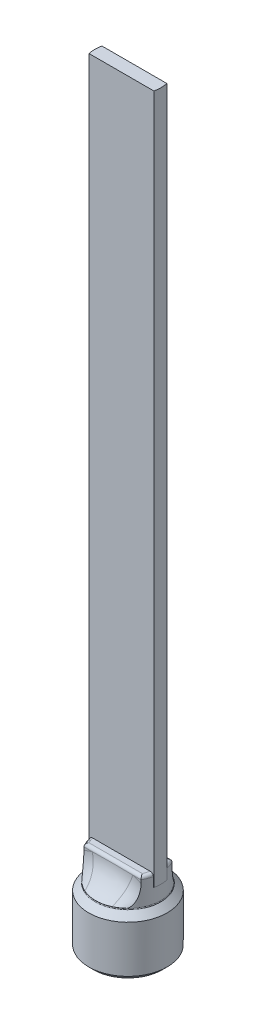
ISO-10303-21;
HEADER;
FILE_DESCRIPTION(('STEP AP214'),'2;1');
FILE_NAME('part.step','',(''),(''),'','','');
FILE_SCHEMA(('AUTOMOTIVE_DESIGN { 1 0 10303 214 1 1 1 1 }'));
ENDSEC;
DATA;
#1=APPLICATION_CONTEXT('core data for automotive mechanical design processes');
#2=APPLICATION_PROTOCOL_DEFINITION('international standard','automotive_design',2000,#1);
#3=PRODUCT_CONTEXT('',#1,'mechanical');
#4=PRODUCT('Part','Part','',(#3));
#5=PRODUCT_RELATED_PRODUCT_CATEGORY('part','',(#4));
#6=PRODUCT_DEFINITION_FORMATION('','',#4);
#7=PRODUCT_DEFINITION_CONTEXT('part definition',#1,'design');
#8=PRODUCT_DEFINITION('design','',#6,#7);
#9=PRODUCT_DEFINITION_SHAPE('','',#8);
#10=(LENGTH_UNIT() NAMED_UNIT(*) SI_UNIT(.MILLI.,.METRE.));
#11=(NAMED_UNIT(*) PLANE_ANGLE_UNIT() SI_UNIT($,.RADIAN.));
#12=(NAMED_UNIT(*) SI_UNIT($,.STERADIAN.) SOLID_ANGLE_UNIT());
#13=UNCERTAINTY_MEASURE_WITH_UNIT(LENGTH_MEASURE(1.E-05),#10,'distance_accuracy_value','');
#14=(GEOMETRIC_REPRESENTATION_CONTEXT(3) GLOBAL_UNCERTAINTY_ASSIGNED_CONTEXT((#13)) GLOBAL_UNIT_ASSIGNED_CONTEXT((#10,
#11,#12)) REPRESENTATION_CONTEXT('',''));
#15=CARTESIAN_POINT('',(0.,0.,0.));
#16=DIRECTION('',(0.,0.,1.));
#17=DIRECTION('',(1.,0.,0.));
#18=AXIS2_PLACEMENT_3D('',#15,#16,#17);
#19=CARTESIAN_POINT('',(0.,8.3312,0.));
#20=DIRECTION('',(0.,-1.,0.));
#21=DIRECTION('',(0.,0.,-1.));
#22=AXIS2_PLACEMENT_3D('',#19,#20,#21);
#23=PLANE('',#22);
#24=DIRECTION('',(-0.866025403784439,0.,0.5));
#25=VECTOR('',#24,1.);
#26=CARTESIAN_POINT('',(0.,8.3312,-3.66617420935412));
#27=LINE('',#26,#25);
#28=CARTESIAN_POINT('',(-3.175,8.3312,-1.83308710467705));
#29=VERTEX_POINT('',#28);
#30=CARTESIAN_POINT('',(0.,8.3312,-3.66617420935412));
#31=VERTEX_POINT('',#30);
#32=EDGE_CURVE('E855',#29,#31,#27,.F.);
#33=ORIENTED_EDGE('',*,*,#32,.T.);
#34=DIRECTION('',(-0.866025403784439,0.,-0.5));
#35=VECTOR('',#34,1.);
#36=CARTESIAN_POINT('',(3.175,8.3312,-1.83308710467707));
#37=LINE('',#36,#35);
#38=CARTESIAN_POINT('',(3.175,8.3312,-1.83308710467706));
#39=VERTEX_POINT('',#38);
#40=EDGE_CURVE('E850',#31,#39,#37,.F.);
#41=ORIENTED_EDGE('',*,*,#40,.T.);
#42=DIRECTION('',(0.,0.,-1.));
#43=VECTOR('',#42,1.);
#44=CARTESIAN_POINT('',(3.175,8.3312,1.83308710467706));
#45=LINE('',#44,#43);
#46=CARTESIAN_POINT('',(3.175,8.3312,1.83308710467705));
#47=VERTEX_POINT('',#46);
#48=EDGE_CURVE('E841',#39,#47,#45,.F.);
#49=ORIENTED_EDGE('',*,*,#48,.T.);
#50=DIRECTION('',(0.866025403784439,0.,-0.5));
#51=VECTOR('',#50,1.);
#52=CARTESIAN_POINT('',(0.,8.3312,3.66617420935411));
#53=LINE('',#52,#51);
#54=CARTESIAN_POINT('',(0.,8.3312,3.66617420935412));
#55=VERTEX_POINT('',#54);
#56=EDGE_CURVE('E827',#47,#55,#53,.F.);
#57=ORIENTED_EDGE('',*,*,#56,.T.);
#58=DIRECTION('',(0.866025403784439,0.,0.5));
#59=VECTOR('',#58,1.);
#60=CARTESIAN_POINT('',(-3.175,8.3312,1.83308710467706));
#61=LINE('',#60,#59);
#62=CARTESIAN_POINT('',(-3.175,8.3312,1.83308710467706));
#63=VERTEX_POINT('',#62);
#64=EDGE_CURVE('E169',#55,#63,#61,.F.);
#65=ORIENTED_EDGE('',*,*,#64,.T.);
#66=DIRECTION('',(0.,0.,1.));
#67=VECTOR('',#66,1.);
#68=CARTESIAN_POINT('',(-3.175,8.3312,-1.83308710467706));
#69=LINE('',#68,#67);
#70=EDGE_CURVE('E858',#63,#29,#69,.F.);
#71=ORIENTED_EDGE('',*,*,#70,.T.);
#72=EDGE_LOOP('',(#33,#41,#49,#57,#65,#71));
#73=FACE_BOUND('',#72,.T.);
#74=ADVANCED_FACE('F35',(#73),#23,.T.);
#75=CARTESIAN_POINT('',(-3.175,0.,1.83308710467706));
#76=DIRECTION('',(-0.5,0.,0.866025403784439));
#77=DIRECTION('',(0.866025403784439,0.,0.5));
#78=AXIS2_PLACEMENT_3D('',#75,#76,#77);
#79=PLANE('',#78);
#80=DIRECTION('',(0.,1.,0.));
#81=VECTOR('',#80,1.);
#82=CARTESIAN_POINT('',(-3.175,0.,1.83308710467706));
#83=LINE('',#82,#81);
#84=CARTESIAN_POINT('',(-3.17499993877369,0.118425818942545,1.83308715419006));
#85=VERTEX_POINT('',#84);
#86=EDGE_CURVE('E790',#85,#63,#83,.T.);
#87=ORIENTED_EDGE('',*,*,#86,.T.);
#88=ORIENTED_EDGE('',*,*,#64,.F.);
#89=DIRECTION('',(0.,1.,0.));
#90=VECTOR('',#89,1.);
#91=CARTESIAN_POINT('',(0.,0.,3.66617420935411));
#92=LINE('',#91,#90);
#93=CARTESIAN_POINT('',(7.34857979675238E-08,0.118425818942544,3.66617418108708));
#94=VERTEX_POINT('',#93);
#95=EDGE_CURVE('E825',#55,#94,#92,.F.);
#96=ORIENTED_EDGE('',*,*,#95,.T.);
#97=CARTESIAN_POINT('',(0.,0.118425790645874,3.66617420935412));
#98=CARTESIAN_POINT('',(-0.441441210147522,0.373291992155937,3.41130800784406));
#99=CARTESIAN_POINT('',(-0.837272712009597,0.493539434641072,3.18277458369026));
#100=CARTESIAN_POINT('',(-1.21954352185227,0.60966735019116,2.96207042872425));
#101=CARTESIAN_POINT('',(-1.5875,0.609599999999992,2.7496306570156));
#102=CARTESIAN_POINT('',(-1.95630488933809,0.609532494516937,2.5367010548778));
#103=CARTESIAN_POINT('',(-2.3377272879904,0.493539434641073,2.31648673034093));
#104=CARTESIAN_POINT('',(-2.73402548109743,0.373022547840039,2.08768386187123));
#105=CARTESIAN_POINT('',(-3.175,0.118425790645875,1.83308710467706));
#106=B_SPLINE_CURVE_WITH_KNOTS('',2,(#97,#98,#99,#100,#101,#102,#103,#104,#105),.UNSPECIFIED.,
.F.,.F.,(3,2,2,2,3),(0.,0.25,0.5,0.75,1.),.UNSPECIFIED.);
#107=EDGE_CURVE('E820',#94,#85,#106,.T.);
#108=ORIENTED_EDGE('',*,*,#107,.T.);
#109=EDGE_LOOP('',(#87,#88,#96,#108));
#110=FACE_BOUND('',#109,.T.);
#111=ADVANCED_FACE('F802',(#110),#79,.F.);
#112=CARTESIAN_POINT('',(-3.175,0.,-1.83308710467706));
#113=DIRECTION('',(-1.,0.,0.));
#114=DIRECTION('',(0.,0.,1.));
#115=AXIS2_PLACEMENT_3D('',#112,#113,#114);
#116=PLANE('',#115);
#117=DIRECTION('',(0.,1.,0.));
#118=VECTOR('',#117,1.);
#119=CARTESIAN_POINT('',(-3.175,0.,-1.83308710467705));
#120=LINE('',#119,#118);
#121=CARTESIAN_POINT('',(-3.17500001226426,0.118425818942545,-1.83308702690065));
#122=VERTEX_POINT('',#121);
#123=EDGE_CURVE('E857',#122,#29,#120,.T.);
#124=ORIENTED_EDGE('',*,*,#123,.T.);
#125=ORIENTED_EDGE('',*,*,#70,.F.);
#126=ORIENTED_EDGE('',*,*,#86,.F.);
#127=CARTESIAN_POINT('',(-3.175,0.118425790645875,1.83308710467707));
#128=CARTESIAN_POINT('',(-3.175,0.373291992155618,1.32335470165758));
#129=CARTESIAN_POINT('',(-3.175,0.493539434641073,0.86628785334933));
#130=CARTESIAN_POINT('',(-3.175,0.609667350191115,0.424879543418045));
#131=CARTESIAN_POINT('',(-3.175,0.609599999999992,0.));
#132=CARTESIAN_POINT('',(-3.175,0.609532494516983,-0.42585920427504));
#133=CARTESIAN_POINT('',(-3.175,0.493539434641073,-0.866287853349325));
#134=CARTESIAN_POINT('',(-3.175,0.373022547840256,-1.32389359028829));
#135=CARTESIAN_POINT('',(-3.175,0.118425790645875,-1.83308710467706));
#136=B_SPLINE_CURVE_WITH_KNOTS('',2,(#127,#128,#129,#130,#131,#132,#133,#134,#135),
.UNSPECIFIED.,.F.,.F.,(3,2,2,2,3),(0.,0.25,0.5,0.75,1.),.UNSPECIFIED.);
#137=EDGE_CURVE('E784',#85,#122,#136,.T.);
#138=ORIENTED_EDGE('',*,*,#137,.T.);
#139=EDGE_LOOP('',(#124,#125,#126,#138));
#140=FACE_BOUND('',#139,.T.);
#141=ADVANCED_FACE('F792',(#140),#116,.F.);
#142=CARTESIAN_POINT('',(0.,0.,-3.66617420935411));
#143=DIRECTION('',(-0.5,0.,-0.866025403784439));
#144=DIRECTION('',(-0.866025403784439,0.,0.5));
#145=AXIS2_PLACEMENT_3D('',#142,#143,#144);
#146=PLANE('',#145);
#147=DIRECTION('',(0.,1.,0.));
#148=VECTOR('',#147,1.);
#149=CARTESIAN_POINT('',(0.,0.,-3.66617420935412));
#150=LINE('',#149,#148);
#151=CARTESIAN_POINT('',(0.,0.118425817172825,-3.66617418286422));
#152=VERTEX_POINT('',#151);
#153=EDGE_CURVE('E854',#152,#31,#150,.T.);
#154=ORIENTED_EDGE('',*,*,#153,.T.);
#155=ORIENTED_EDGE('',*,*,#32,.F.);
#156=ORIENTED_EDGE('',*,*,#123,.F.);
#157=CARTESIAN_POINT('',(-3.175,0.118425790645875,-1.83308710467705));
#158=CARTESIAN_POINT('',(-2.73355878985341,0.373291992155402,-2.08795330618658));
#159=CARTESIAN_POINT('',(-2.3377272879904,0.493539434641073,-2.31648673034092));
#160=CARTESIAN_POINT('',(-1.95545647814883,0.609667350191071,-2.53719088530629));
#161=CARTESIAN_POINT('',(-1.5875,0.609599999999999,-2.74963065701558));
#162=CARTESIAN_POINT('',(-1.21869511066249,0.60953249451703,-2.96256025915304));
#163=CARTESIAN_POINT('',(-0.837272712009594,0.493539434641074,-3.18277458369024));
#164=CARTESIAN_POINT('',(-0.440974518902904,0.373022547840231,-3.41157745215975));
#165=CARTESIAN_POINT('',(0.,0.118425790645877,-3.66617420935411));
#166=B_SPLINE_CURVE_WITH_KNOTS('',2,(#157,#158,#159,#160,#161,#162,#163,#164,#165),
.UNSPECIFIED.,.F.,.F.,(3,2,2,2,3),(0.,0.25,0.5,0.75,1.),.UNSPECIFIED.);
#167=EDGE_CURVE('E826',#122,#152,#166,.T.);
#168=ORIENTED_EDGE('',*,*,#167,.T.);
#169=EDGE_LOOP('',(#154,#155,#156,#168));
#170=FACE_BOUND('',#169,.T.);
#171=ADVANCED_FACE('F801',(#170),#146,.F.);
#172=CARTESIAN_POINT('',(3.175,0.,-1.83308710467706));
#173=DIRECTION('',(0.5,0.,-0.866025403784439));
#174=DIRECTION('',(-0.866025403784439,0.,-0.5));
#175=AXIS2_PLACEMENT_3D('',#172,#173,#174);
#176=PLANE('',#175);
#177=DIRECTION('',(0.,1.,0.));
#178=VECTOR('',#177,1.);
#179=CARTESIAN_POINT('',(3.175,0.,-1.83308710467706));
#180=LINE('',#179,#178);
#181=CARTESIAN_POINT('',(3.17500001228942,0.118425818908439,-1.8330870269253));
#182=VERTEX_POINT('',#181);
#183=EDGE_CURVE('E847',#182,#39,#180,.T.);
#184=ORIENTED_EDGE('',*,*,#183,.T.);
#185=ORIENTED_EDGE('',*,*,#40,.F.);
#186=ORIENTED_EDGE('',*,*,#153,.F.);
#187=CARTESIAN_POINT('',(0.,0.118425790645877,-3.66617420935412));
#188=CARTESIAN_POINT('',(0.44144121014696,0.373291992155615,-3.41130800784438));
#189=CARTESIAN_POINT('',(0.837272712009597,0.493539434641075,-3.18277458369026));
#190=CARTESIAN_POINT('',(1.21954352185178,0.609667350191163,-2.96207042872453));
#191=CARTESIAN_POINT('',(1.5875,0.6096,-2.7496306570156));
#192=CARTESIAN_POINT('',(1.95630488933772,0.609532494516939,-2.53670105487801));
#193=CARTESIAN_POINT('',(2.3377272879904,0.493539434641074,-2.31648673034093));
#194=CARTESIAN_POINT('',(2.734025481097,0.373022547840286,-2.08768386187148));
#195=CARTESIAN_POINT('',(3.175,0.118425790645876,-1.83308710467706));
#196=B_SPLINE_CURVE_WITH_KNOTS('',2,(#187,#188,#189,#190,#191,#192,#193,#194,#195),
.UNSPECIFIED.,.F.,.F.,(3,2,2,2,3),(0.,0.25,0.5,0.75,1.),.UNSPECIFIED.);
#197=EDGE_CURVE('E925',#152,#182,#196,.T.);
#198=ORIENTED_EDGE('',*,*,#197,.T.);
#199=EDGE_LOOP('',(#184,#185,#186,#198));
#200=FACE_BOUND('',#199,.T.);
#201=ADVANCED_FACE('F935',(#200),#176,.F.);
#202=CARTESIAN_POINT('',(3.175,0.,1.83308710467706));
#203=DIRECTION('',(1.,0.,0.));
#204=DIRECTION('',(0.,0.,-1.));
#205=AXIS2_PLACEMENT_3D('',#202,#203,#204);
#206=PLANE('',#205);
#207=DIRECTION('',(0.,1.,0.));
#208=VECTOR('',#207,1.);
#209=CARTESIAN_POINT('',(3.175,0.,1.83308710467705));
#210=LINE('',#209,#208);
#211=CARTESIAN_POINT('',(3.1750000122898,0.118425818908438,1.83308702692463));
#212=VERTEX_POINT('',#211);
#213=EDGE_CURVE('E830',#212,#47,#210,.T.);
#214=ORIENTED_EDGE('',*,*,#213,.T.);
#215=ORIENTED_EDGE('',*,*,#48,.F.);
#216=ORIENTED_EDGE('',*,*,#183,.F.);
#217=CARTESIAN_POINT('',(3.175,0.118425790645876,-1.83308710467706));
#218=CARTESIAN_POINT('',(3.175,0.373291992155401,-1.32335470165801));
#219=CARTESIAN_POINT('',(3.175,0.493539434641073,-0.86628785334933));
#220=CARTESIAN_POINT('',(3.175,0.609667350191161,-0.42487954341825));
#221=CARTESIAN_POINT('',(3.175,0.609599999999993,0.));
#222=CARTESIAN_POINT('',(3.175,0.609532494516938,0.425859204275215));
#223=CARTESIAN_POINT('',(3.175,0.493539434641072,0.866287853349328));
#224=CARTESIAN_POINT('',(3.175,0.373022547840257,1.32389359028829));
#225=CARTESIAN_POINT('',(3.175,0.118425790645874,1.83308710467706));
#226=B_SPLINE_CURVE_WITH_KNOTS('',2,(#217,#218,#219,#220,#221,#222,#223,#224,#225),
.UNSPECIFIED.,.F.,.F.,(3,2,2,2,3),(0.,0.25,0.5,0.75,1.),.UNSPECIFIED.);
#227=EDGE_CURVE('E923',#182,#212,#226,.T.);
#228=ORIENTED_EDGE('',*,*,#227,.T.);
#229=EDGE_LOOP('',(#214,#215,#216,#228));
#230=FACE_BOUND('',#229,.T.);
#231=ADVANCED_FACE('F949',(#230),#206,.F.);
#232=CARTESIAN_POINT('',(0.,0.,3.66617420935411));
#233=DIRECTION('',(0.5,0.,0.866025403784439));
#234=DIRECTION('',(0.866025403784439,0.,-0.5));
#235=AXIS2_PLACEMENT_3D('',#232,#233,#234);
#236=PLANE('',#235);
#237=ORIENTED_EDGE('',*,*,#95,.F.);
#238=ORIENTED_EDGE('',*,*,#56,.F.);
#239=ORIENTED_EDGE('',*,*,#213,.F.);
#240=CARTESIAN_POINT('',(3.17499999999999,0.118425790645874,1.83308710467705));
#241=CARTESIAN_POINT('',(2.73355878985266,0.37329199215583,2.08795330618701));
#242=CARTESIAN_POINT('',(2.3377272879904,0.493539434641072,2.31648673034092));
#243=CARTESIAN_POINT('',(1.95545647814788,0.60966735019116,2.53719088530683));
#244=CARTESIAN_POINT('',(1.5875,0.609599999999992,2.74963065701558));
#245=CARTESIAN_POINT('',(1.21869511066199,0.609532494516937,2.96256025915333));
#246=CARTESIAN_POINT('',(0.837272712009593,0.493539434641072,3.18277458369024));
#247=CARTESIAN_POINT('',(0.440974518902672,0.373022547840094,3.41157745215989));
#248=CARTESIAN_POINT('',(0.,0.118425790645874,3.66617420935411));
#249=B_SPLINE_CURVE_WITH_KNOTS('',2,(#240,#241,#242,#243,#244,#245,#246,#247,#248),
.UNSPECIFIED.,.F.,.F.,(3,2,2,2,3),(0.,0.25,0.5,0.75,1.),.UNSPECIFIED.);
#250=EDGE_CURVE('E823',#212,#94,#249,.T.);
#251=ORIENTED_EDGE('',*,*,#250,.T.);
#252=EDGE_LOOP('',(#237,#238,#239,#251));
#253=FACE_BOUND('',#252,.T.);
#254=ADVANCED_FACE('F737',(#253),#236,.F.);
#255=CARTESIAN_POINT('',(0.,5.6843418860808E-11,0.));
#256=DIRECTION('',(0.,-1.,0.));
#257=DIRECTION('',(0.,0.,-1.));
#258=AXIS2_PLACEMENT_3D('',#255,#256,#257);
#259=CONICAL_SURFACE('',#258,3.78460000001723,0.785398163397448);
#260=CARTESIAN_POINT('',(0.,5.6844286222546E-11,0.));
#261=DIRECTION('',(0.,-1.,0.));
#262=DIRECTION('',(0.,0.,-1.));
#263=AXIS2_PLACEMENT_3D('',#260,#261,#262);
#264=CIRCLE('',#263,3.78460000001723);
#265=CARTESIAN_POINT('',(0.,5.6844286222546E-11,-3.78460000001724));
#266=VERTEX_POINT('',#265);
#267=EDGE_CURVE('E919',#266,#266,#264,.F.);
#268=ORIENTED_EDGE('',*,*,#267,.F.);
#269=EDGE_LOOP('',(#268));
#270=FACE_BOUND('',#269,.T.);
#271=ORIENTED_EDGE('',*,*,#227,.F.);
#272=ORIENTED_EDGE('',*,*,#197,.F.);
#273=ORIENTED_EDGE('',*,*,#167,.F.);
#274=ORIENTED_EDGE('',*,*,#137,.F.);
#275=ORIENTED_EDGE('',*,*,#107,.F.);
#276=ORIENTED_EDGE('',*,*,#250,.F.);
#277=EDGE_LOOP('',(#271,#272,#273,#274,#275,#276));
#278=FACE_BOUND('',#277,.T.);
#279=ADVANCED_FACE('F732',(#270,#278),#259,.F.);
#280=CARTESIAN_POINT('',(0.,0.,-3.1496));
#281=DIRECTION('',(0.,-1.,0.));
#282=DIRECTION('',(0.,0.,-1.));
#283=AXIS2_PLACEMENT_3D('',#280,#281,#282);
#284=PLANE('',#283);
#285=ORIENTED_EDGE('',*,*,#267,.T.);
#286=EDGE_LOOP('',(#285));
#287=FACE_BOUND('',#286,.T.);
#288=CARTESIAN_POINT('',(0.,5.68426599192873E-11,0.));
#289=DIRECTION('',(0.,1.,0.));
#290=DIRECTION('',(0.,0.,1.));
#291=AXIS2_PLACEMENT_3D('',#288,#289,#290);
#292=CIRCLE('',#291,5.71500000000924);
#293=CARTESIAN_POINT('',(0.,5.68426599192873E-11,5.71500000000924));
#294=VERTEX_POINT('',#293);
#295=EDGE_CURVE('E910',#294,#294,#292,.T.);
#296=ORIENTED_EDGE('',*,*,#295,.F.);
#297=EDGE_LOOP('',(#296));
#298=FACE_BOUND('',#297,.T.);
#299=ADVANCED_FACE('F728',(#287,#298),#284,.T.);
#300=CARTESIAN_POINT('',(0.,0.801000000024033,0.));
#301=DIRECTION('',(0.,1.,0.));
#302=DIRECTION('',(0.,0.,1.));
#303=AXIS2_PLACEMENT_3D('',#300,#301,#302);
#304=CONICAL_SURFACE('',#303,6.51599999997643,0.785398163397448);
#305=CARTESIAN_POINT('',(0.,0.801,0.));
#306=DIRECTION('',(0.,-1.,0.));
#307=DIRECTION('',(0.,0.,-1.));
#308=AXIS2_PLACEMENT_3D('',#305,#306,#307);
#309=CIRCLE('',#308,6.516);
#310=CARTESIAN_POINT('',(0.,0.801,-6.516));
#311=VERTEX_POINT('',#310);
#312=EDGE_CURVE('E918',#311,#311,#309,.F.);
#313=ORIENTED_EDGE('',*,*,#312,.F.);
#314=EDGE_LOOP('',(#313));
#315=FACE_BOUND('',#314,.T.);
#316=ORIENTED_EDGE('',*,*,#295,.T.);
#317=EDGE_LOOP('',(#316));
#318=FACE_BOUND('',#317,.T.);
#319=ADVANCED_FACE('F724',(#315,#318),#304,.T.);
#320=CARTESIAN_POINT('',(0.,4.826,0.));
#321=DIRECTION('',(0.,-1.,0.));
#322=DIRECTION('',(0.,0.,-1.));
#323=AXIS2_PLACEMENT_3D('',#320,#321,#322);
#324=CYLINDRICAL_SURFACE('',#323,6.516);
#325=CARTESIAN_POINT('',(0.,8.596999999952,0.));
#326=DIRECTION('',(0.,-1.,0.));
#327=DIRECTION('',(0.,0.,1.));
#328=AXIS2_PLACEMENT_3D('',#325,#326,#327);
#329=CIRCLE('',#328,6.51599999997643);
#330=CARTESIAN_POINT('',(0.,8.596999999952,6.51599999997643));
#331=VERTEX_POINT('',#330);
#332=EDGE_CURVE('E1258',#331,#331,#329,.F.);
#333=ORIENTED_EDGE('',*,*,#332,.F.);
#334=EDGE_LOOP('',(#333));
#335=FACE_BOUND('',#334,.T.);
#336=ORIENTED_EDGE('',*,*,#312,.T.);
#337=EDGE_LOOP('',(#336));
#338=FACE_BOUND('',#337,.T.);
#339=ADVANCED_FACE('F720',(#335,#338),#324,.T.);
#340=CARTESIAN_POINT('',(0.,8.59700000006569,0.));
#341=DIRECTION('',(0.,-1.,0.));
#342=DIRECTION('',(0.,0.,-1.));
#343=AXIS2_PLACEMENT_3D('',#340,#341,#342);
#344=CONICAL_SURFACE('',#343,6.51599999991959,0.785398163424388);
#345=CARTESIAN_POINT('',(0.,9.652,0.));
#346=DIRECTION('',(0.,-1.,0.));
#347=DIRECTION('',(-1.,0.,-1.12769188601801E-10));
#348=AXIS2_PLACEMENT_3D('',#345,#346,#347);
#349=CIRCLE('',#348,5.461);
#350=CARTESIAN_POINT('',(-5.461,9.652,-6.15833416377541E-10));
#351=VERTEX_POINT('',#350);
#352=EDGE_CURVE('E1115',#351,#351,#349,.T.);
#353=ORIENTED_EDGE('',*,*,#352,.T.);
#354=EDGE_LOOP('',(#353));
#355=FACE_BOUND('',#354,.T.);
#356=ORIENTED_EDGE('',*,*,#332,.T.);
#357=EDGE_LOOP('',(#356));
#358=FACE_BOUND('',#357,.T.);
#359=ADVANCED_FACE('F715',(#355,#358),#344,.T.);
#360=CARTESIAN_POINT('',(0.,9.8298,2.5781));
#361=DIRECTION('',(0.,0.,-1.));
#362=DIRECTION('',(-1.,0.,0.));
#363=AXIS2_PLACEMENT_3D('',#360,#361,#362);
#364=PLANE('',#363);
#365=DIRECTION('',(1.,0.,0.));
#366=VECTOR('',#365,1.);
#367=CARTESIAN_POINT('',(0.,13.7668,2.5781));
#368=LINE('',#367,#366);
#369=CARTESIAN_POINT('',(-4.75643400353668,13.7668,2.5781));
#370=VERTEX_POINT('',#369);
#371=CARTESIAN_POINT('',(-3.3741041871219,13.7667999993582,2.5781));
#372=VERTEX_POINT('',#371);
#373=EDGE_CURVE('E1118',#370,#372,#368,.T.);
#374=ORIENTED_EDGE('',*,*,#373,.F.);
#375=DIRECTION('',(0.,1.,0.));
#376=VECTOR('',#375,1.);
#377=CARTESIAN_POINT('',(-4.75643400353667,9.8298,2.5781));
#378=LINE('',#377,#376);
#379=CARTESIAN_POINT('',(-4.75643400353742,13.2206846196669,2.5781000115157));
#380=VERTEX_POINT('',#379);
#381=EDGE_CURVE('E702',#380,#370,#378,.T.);
#382=ORIENTED_EDGE('',*,*,#381,.F.);
#383=CARTESIAN_POINT('',(-3.37410418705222,13.7667999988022,2.5781));
#384=CARTESIAN_POINT('',(-3.4338096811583,13.7499335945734,2.57810000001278));
#385=CARTESIAN_POINT('',(-3.49333317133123,13.732415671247,2.57810000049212));
#386=CARTESIAN_POINT('',(-3.61196474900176,13.6960104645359,2.57810000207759));
#387=CARTESIAN_POINT('',(-3.67107280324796,13.677123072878,2.57810000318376));
#388=CARTESIAN_POINT('',(-3.78880849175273,13.6379166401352,2.57810000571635));
#389=CARTESIAN_POINT('',(-3.84743615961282,13.6175977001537,2.57810000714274));
#390=CARTESIAN_POINT('',(-3.96414460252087,13.5754661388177,2.57810001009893));
#391=CARTESIAN_POINT('',(-4.02222544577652,13.5536537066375,2.57810001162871));
#392=CARTESIAN_POINT('',(-4.13777422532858,13.5084731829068,2.57810001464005));
#393=CARTESIAN_POINT('',(-4.19524221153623,13.4851052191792,2.57810001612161));
#394=CARTESIAN_POINT('',(-4.30949912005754,13.4367519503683,2.57810001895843));
#395=CARTESIAN_POINT('',(-4.36628799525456,13.4117665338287,2.57810002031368));
#396=CARTESIAN_POINT('',(-4.47912100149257,13.3601163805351,2.57810002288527));
#397=CARTESIAN_POINT('',(-4.53516487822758,13.3334510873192,2.57810002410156));
#398=CARTESIAN_POINT('',(-4.6464409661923,13.2783812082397,2.57810002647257));
#399=CARTESIAN_POINT('',(-4.70167256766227,13.2499753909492,2.57810002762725));
#400=CARTESIAN_POINT('',(-4.75643400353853,13.220684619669,2.57810002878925));
#401=B_SPLINE_CURVE_WITH_KNOTS('',3,(#383,#384,#385,#386,#387,#388,#389,#390,#391,#392,#393,
#394,#395,#396,#397,#398,#399,#400),.UNSPECIFIED.,.F.,.F.,(4,2,2,2,2,2,2,2,4),(0.,
0.186125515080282,0.372265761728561,0.558392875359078,0.744496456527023,0.930584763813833,
1.11668590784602,1.3028490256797,1.4891454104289),.UNSPECIFIED.);
#402=EDGE_CURVE('E696',#372,#380,#401,.T.);
#403=ORIENTED_EDGE('',*,*,#402,.F.);
#404=EDGE_LOOP('',(#374,#382,#403));
#405=FACE_BOUND('',#404,.T.);
#406=ADVANCED_FACE('F704',(#405),#364,.F.);
#407=CARTESIAN_POINT('',(0.,9.8298,2.5781));
#408=DIRECTION('',(0.,0.,-1.));
#409=DIRECTION('',(-1.,0.,0.));
#410=AXIS2_PLACEMENT_3D('',#407,#408,#409);
#411=PLANE('',#410);
#412=DIRECTION('',(0.,1.,0.));
#413=VECTOR('',#412,1.);
#414=CARTESIAN_POINT('',(4.75643400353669,9.8298,2.5781));
#415=LINE('',#414,#413);
#416=CARTESIAN_POINT('',(4.75643400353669,13.7668,2.5781));
#417=VERTEX_POINT('',#416);
#418=CARTESIAN_POINT('',(4.75643402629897,13.2206845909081,2.57809999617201));
#419=VERTEX_POINT('',#418);
#420=EDGE_CURVE('E1175',#417,#419,#415,.F.);
#421=ORIENTED_EDGE('',*,*,#420,.F.);
#422=DIRECTION('',(1.,0.,0.));
#423=VECTOR('',#422,1.);
#424=CARTESIAN_POINT('',(0.,13.7668,2.5781));
#425=LINE('',#424,#423);
#426=CARTESIAN_POINT('',(3.3741041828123,13.7667999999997,2.5781));
#427=VERTEX_POINT('',#426);
#428=EDGE_CURVE('E1121',#427,#417,#425,.T.);
#429=ORIENTED_EDGE('',*,*,#428,.F.);
#430=CARTESIAN_POINT('',(4.75643403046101,13.220684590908,2.57809999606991));
#431=CARTESIAN_POINT('',(4.70162134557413,13.2499347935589,2.57809999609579));
#432=CARTESIAN_POINT('',(4.6463424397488,13.2783050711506,2.57809999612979));
#433=CARTESIAN_POINT('',(4.53491638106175,13.3333505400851,2.57809999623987));
#434=CARTESIAN_POINT('',(4.47876885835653,13.3600249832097,2.57809999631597));
#435=CARTESIAN_POINT('',(4.36570800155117,13.4117225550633,2.57809999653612));
#436=CARTESIAN_POINT('',(4.30879453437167,13.4367453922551,2.57809999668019));
#437=CARTESIAN_POINT('',(4.19430202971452,13.485183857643,2.57809999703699));
#438=CARTESIAN_POINT('',(4.13672312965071,13.5085998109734,2.57809999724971));
#439=CARTESIAN_POINT('',(4.02100057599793,13.5538683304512,2.57809999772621));
#440=CARTESIAN_POINT('',(3.96285733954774,13.5757219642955,2.57809999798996));
#441=CARTESIAN_POINT('',(3.84610667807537,13.6179095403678,2.57809999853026));
#442=CARTESIAN_POINT('',(3.78749994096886,13.6382453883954,2.57809999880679));
#443=CARTESIAN_POINT('',(3.66992326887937,13.6774411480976,2.57809999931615));
#444=CARTESIAN_POINT('',(3.61095427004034,13.696303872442,2.57809999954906));
#445=CARTESIAN_POINT('',(3.49275271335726,13.7325964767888,2.57809999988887));
#446=CARTESIAN_POINT('',(3.43352131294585,13.7500301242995,2.57809999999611));
#447=CARTESIAN_POINT('',(3.3741041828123,13.766799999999,2.5781));
#448=B_SPLINE_CURVE_WITH_KNOTS('',3,(#430,#431,#432,#433,#434,#435,#436,#437,#438,#439,#440,
#441,#442,#443,#444,#445,#446,#447),.UNSPECIFIED.,.F.,.F.,(4,2,2,2,2,2,2,2,4),(0.,
0.186374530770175,0.372830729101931,0.55931975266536,0.745770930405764,0.932093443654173,
1.11817792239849,1.30389794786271,1.48911145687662),.UNSPECIFIED.);
#449=EDGE_CURVE('E689',#419,#427,#448,.T.);
#450=ORIENTED_EDGE('',*,*,#449,.F.);
#451=EDGE_LOOP('',(#421,#429,#450));
#452=FACE_BOUND('',#451,.T.);
#453=ADVANCED_FACE('F714',(#452),#411,.F.);
#454=CARTESIAN_POINT('',(0.,13.7668,2.0701));
#455=DIRECTION('',(1.,0.,0.));
#456=DIRECTION('',(0.,0.,-1.));
#457=AXIS2_PLACEMENT_3D('',#454,#455,#456);
#458=CYLINDRICAL_SURFACE('',#457,0.508);
#459=CARTESIAN_POINT('',(-4.75643400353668,13.7668,2.5781));
#460=CARTESIAN_POINT('',(-4.75643428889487,13.7752472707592,2.57810039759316));
#461=CARTESIAN_POINT('',(-4.75631085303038,13.783694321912,2.57788509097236));
#462=CARTESIAN_POINT('',(-4.75581565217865,13.8006043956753,2.57702671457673));
#463=CARTESIAN_POINT('',(-4.75544257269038,13.8090672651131,2.57638138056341));
#464=CARTESIAN_POINT('',(-4.75444411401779,13.8259873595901,2.57466139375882));
#465=CARTESIAN_POINT('',(-4.75381718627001,13.8344442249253,2.57358410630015));
#466=CARTESIAN_POINT('',(-4.75230816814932,13.8513304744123,2.57100002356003));
#467=CARTESIAN_POINT('',(-4.75142431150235,13.8597592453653,2.56949025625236));
#468=CARTESIAN_POINT('',(-4.74939917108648,13.8765670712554,2.5660416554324));
#469=CARTESIAN_POINT('',(-4.74825592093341,13.8849452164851,2.56409954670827));
#470=CARTESIAN_POINT('',(-4.74571050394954,13.9016292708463,2.55978755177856));
#471=CARTESIAN_POINT('',(-4.74430619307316,13.909933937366,2.55741412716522));
#472=CARTESIAN_POINT('',(-4.74123793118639,13.9264482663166,2.55224159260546));
#473=CARTESIAN_POINT('',(-4.73957168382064,13.9346563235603,2.54943872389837));
#474=CARTESIAN_POINT('',(-4.73597963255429,13.9509544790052,2.54341022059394));
#475=CARTESIAN_POINT('',(-4.73405140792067,13.9590425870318,2.54018065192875));
#476=CARTESIAN_POINT('',(-4.7299363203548,13.9750777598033,2.53330249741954));
#477=CARTESIAN_POINT('',(-4.72774694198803,13.9830224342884,2.52964984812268));
#478=CARTESIAN_POINT('',(-4.72311132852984,13.9987475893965,2.52193011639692));
#479=CARTESIAN_POINT('',(-4.72066251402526,14.006525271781,2.51785888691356));
#480=CARTESIAN_POINT('',(-4.71551070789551,14.0218932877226,2.50930740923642));
#481=CARTESIAN_POINT('',(-4.71280510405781,14.0294804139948,2.50482297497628));
#482=CARTESIAN_POINT('',(-4.70714330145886,14.0444442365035,2.49545134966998));
#483=CARTESIAN_POINT('',(-4.70418448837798,14.0518173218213,2.49055997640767));
#484=CARTESIAN_POINT('',(-4.69802086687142,14.0663300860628,2.48038150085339));
#485=CARTESIAN_POINT('',(-4.69481347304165,14.0734657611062,2.47509025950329));
#486=CARTESIAN_POINT('',(-4.68815799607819,14.0874810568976,2.4641201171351));
#487=CARTESIAN_POINT('',(-4.68470738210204,14.0943562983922,2.4584371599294));
#488=CARTESIAN_POINT('',(-4.67757277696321,14.1078279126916,2.44669159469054));
#489=CARTESIAN_POINT('',(-4.67388634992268,14.1144195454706,2.44062503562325));
#490=CARTESIAN_POINT('',(-4.66628460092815,14.1273032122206,2.4281243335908));
#491=CARTESIAN_POINT('',(-4.66236691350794,14.1335901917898,2.42168641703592));
#492=CARTESIAN_POINT('',(-4.65543892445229,14.1441383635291,2.41028084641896));
#493=CARTESIAN_POINT('',(-4.65246456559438,14.1484934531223,2.40537780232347));
#494=CARTESIAN_POINT('',(-4.64633477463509,14.15713012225,2.39525477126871));
#495=CARTESIAN_POINT('',(-4.6431766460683,14.1614038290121,2.39002969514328));
#496=CARTESIAN_POINT('',(-4.63666982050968,14.1698554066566,2.37926469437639));
#497=CARTESIAN_POINT('',(-4.63331829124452,14.1740251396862,2.37372009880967));
#498=CARTESIAN_POINT('',(-4.62641873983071,14.1822443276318,2.36231614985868));
#499=CARTESIAN_POINT('',(-4.62286787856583,14.1862853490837,2.35645243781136));
#500=CARTESIAN_POINT('',(-4.61556407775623,14.19422178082,2.3444120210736));
#501=CARTESIAN_POINT('',(-4.61180830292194,14.1981084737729,2.33823129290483));
#502=CARTESIAN_POINT('',(-4.60409052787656,14.2057097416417,2.32555932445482));
#503=CARTESIAN_POINT('',(-4.60012573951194,14.2094153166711,2.31906438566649));
#504=CARTESIAN_POINT('',(-4.5919871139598,14.2166268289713,2.30576753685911));
#505=CARTESIAN_POINT('',(-4.58781057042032,14.220123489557,2.29896225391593));
#506=CARTESIAN_POINT('',(-4.579247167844,14.2268886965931,2.28504929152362));
#507=CARTESIAN_POINT('',(-4.57485772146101,14.2301476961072,2.27793856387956));
#508=CARTESIAN_POINT('',(-4.5658689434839,14.2364082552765,2.26342039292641));
#509=CARTESIAN_POINT('',(-4.56126718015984,14.2394000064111,2.25601022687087));
#510=CARTESIAN_POINT('',(-4.55185606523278,14.2450960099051,2.24090000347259));
#511=CARTESIAN_POINT('',(-4.54704447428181,14.2477902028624,2.23319754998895));
#512=CARTESIAN_POINT('',(-4.53721803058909,14.2528604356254,2.21751075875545));
#513=CARTESIAN_POINT('',(-4.53220116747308,14.2552261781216,2.20952435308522));
#514=CARTESIAN_POINT('',(-4.52197070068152,14.2596084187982,2.1932788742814));
#515=CARTESIAN_POINT('',(-4.51675535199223,14.2616143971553,2.18501806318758));
#516=CARTESIAN_POINT('',(-4.50613678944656,14.2652457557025,2.16823422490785));
#517=CARTESIAN_POINT('',(-4.50073213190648,14.2668604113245,2.15970979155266));
#518=CARTESIAN_POINT('',(-4.48974634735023,14.2696777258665,2.14241038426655));
#519=CARTESIAN_POINT('',(-4.48416411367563,14.2708694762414,2.13363433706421));
#520=CARTESIAN_POINT('',(-4.47283721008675,14.2728096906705,2.115844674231));
#521=CARTESIAN_POINT('',(-4.46709180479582,14.273547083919,2.10683032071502));
#522=CARTESIAN_POINT('',(-4.45545550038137,14.2745479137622,2.08857800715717));
#523=CARTESIAN_POINT('',(-4.44956427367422,14.274800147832,2.0793396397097));
#524=CARTESIAN_POINT('',(-4.44367537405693,14.2748,2.0701));
#525=B_SPLINE_CURVE_WITH_KNOTS('',3,(#459,#460,#461,#462,#463,#464,#465,#466,#467,#468,#469,
#470,#471,#472,#473,#474,#475,#476,#477,#478,#479,#480,#481,#482,#483,#484,#485,#486,#487,#488,
#489,#490,#491,#492,#493,#494,#495,#496,#497,#498,#499,#500,#501,#502,#503,#504,#505,#506,#507,
#508,#509,#510,#511,#512,#513,#514,#515,#516,#517,#518,#519,#520,#521,#522,#523,#524),
.UNSPECIFIED.,.F.,.F.,(4,2,2,2,2,2,2,2,2,2,2,2,2,2,2,2,2,2,2,2,2,2,2,2,2,2,2,2,2,2,2,2,4),(0.,
0.0253378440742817,0.0508101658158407,0.0764402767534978,0.10225092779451,0.128264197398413,
0.154501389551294,0.180982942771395,0.20772835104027,0.234756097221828,0.262083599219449,
0.289727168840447,0.317701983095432,0.34602206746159,0.374700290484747,0.403748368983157,
0.433176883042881,0.454774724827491,0.477126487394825,0.500234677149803,0.524100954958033,
0.548726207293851,0.574110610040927,0.600253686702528,0.627154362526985,0.654811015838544,
0.683221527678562,0.712383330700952,0.742293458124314,0.772948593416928,0.80434512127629,
0.836479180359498,0.869346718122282),.UNSPECIFIED.);
#526=CARTESIAN_POINT('',(-4.44367537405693,14.2748,2.0701));
#527=VERTEX_POINT('',#526);
#528=EDGE_CURVE('E1112',#370,#527,#525,.T.);
#529=ORIENTED_EDGE('',*,*,#528,.F.);
#530=ORIENTED_EDGE('',*,*,#373,.T.);
#531=CARTESIAN_POINT('',(3.3741041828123,13.7668,2.5781));
#532=CARTESIAN_POINT('',(2.43595632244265,13.7923866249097,2.5781));
#533=CARTESIAN_POINT('',(0.810418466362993,13.8106876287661,2.57611033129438));
#534=CARTESIAN_POINT('',(-1.46104404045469,13.804718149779,2.5768549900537));
#535=CARTESIAN_POINT('',(-2.74965601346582,13.7838309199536,2.57810000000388));
#536=CARTESIAN_POINT('',(-3.37410418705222,13.7667999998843,2.5781));
#537=B_SPLINE_CURVE_WITH_KNOTS('',3,(#531,#532,#533,#534,#535,#536),.UNSPECIFIED.,.F.,.F.,(4,1,
1,4),(-1.6709984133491,-1.37901580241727,-1.18436072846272,-0.989705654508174),.UNSPECIFIED.);
#538=EDGE_CURVE('E621',#427,#372,#537,.T.);
#539=ORIENTED_EDGE('',*,*,#538,.F.);
#540=ORIENTED_EDGE('',*,*,#428,.T.);
#541=CARTESIAN_POINT('',(4.44367537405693,14.2748,2.07009999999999));
#542=CARTESIAN_POINT('',(4.44956307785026,14.274800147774,2.0793377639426));
#543=CARTESIAN_POINT('',(4.45545312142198,14.2745480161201,2.08857424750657));
#544=CARTESIAN_POINT('',(4.46708724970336,14.2735475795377,2.10682303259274));
#545=CARTESIAN_POINT('',(4.47283166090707,14.2728104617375,2.11583574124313));
#546=CARTESIAN_POINT('',(4.48415677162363,14.2708709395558,2.13362236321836));
#547=CARTESIAN_POINT('',(4.48973820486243,14.2696795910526,2.14239701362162));
#548=CARTESIAN_POINT('',(4.50072258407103,14.2668631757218,2.15969388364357));
#549=CARTESIAN_POINT('',(4.50612663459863,14.2652490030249,2.16821717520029));
#550=CARTESIAN_POINT('',(4.51674417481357,14.261618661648,2.18499899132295));
#551=CARTESIAN_POINT('',(4.52195910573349,14.2596132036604,2.19325892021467));
#552=CARTESIAN_POINT('',(4.53218892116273,14.2552320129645,2.2095028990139));
#553=CARTESIAN_POINT('',(4.53720554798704,14.2528667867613,2.2174886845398));
#554=CARTESIAN_POINT('',(4.54703169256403,14.2477975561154,2.23317450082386));
#555=CARTESIAN_POINT('',(4.5518432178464,14.2451038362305,2.24087659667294));
#556=CARTESIAN_POINT('',(4.56125436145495,14.2394087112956,2.25598636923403));
#557=CARTESIAN_POINT('',(4.5658562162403,14.2364173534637,2.26339643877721));
#558=CARTESIAN_POINT('',(4.57484532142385,14.2301574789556,2.27791467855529));
#559=CARTESIAN_POINT('',(4.57923500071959,14.2268987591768,2.28502556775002));
#560=CARTESIAN_POINT('',(4.58779899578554,14.2201339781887,2.2989391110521));
#561=CARTESIAN_POINT('',(4.59197589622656,14.2166374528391,2.30574480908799));
#562=CARTESIAN_POINT('',(4.60011534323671,14.2094260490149,2.3190427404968));
#563=CARTESIAN_POINT('',(4.60408059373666,14.2057204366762,2.32553834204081));
#564=CARTESIAN_POINT('',(4.61179938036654,14.1981189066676,2.33821188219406));
#565=CARTESIAN_POINT('',(4.61555570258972,14.194231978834,2.3443935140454));
#566=CARTESIAN_POINT('',(4.62286066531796,14.1862948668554,2.35643597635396));
#567=CARTESIAN_POINT('',(4.6264121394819,14.1822533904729,2.36230082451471));
#568=CARTESIAN_POINT('',(4.6333129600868,14.1740330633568,2.37370727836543));
#569=CARTESIAN_POINT('',(4.6366651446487,14.1698626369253,2.37925323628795));
#570=CARTESIAN_POINT('',(4.64317331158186,14.1614094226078,2.39002117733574));
#571=CARTESIAN_POINT('',(4.64633212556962,14.1571347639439,2.39524782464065));
#572=CARTESIAN_POINT('',(4.65246326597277,14.1484959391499,2.40537423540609));
#573=CARTESIAN_POINT('',(4.65543829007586,14.1441396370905,2.4102790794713));
#574=CARTESIAN_POINT('',(4.6623660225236,14.1335911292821,2.42168593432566));
#575=CARTESIAN_POINT('',(4.66628283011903,14.1273051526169,2.42812342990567));
#576=CARTESIAN_POINT('',(4.67388306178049,14.1144234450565,2.4406233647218));
#577=CARTESIAN_POINT('',(4.67756884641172,14.1078327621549,2.44668957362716));
#578=CARTESIAN_POINT('',(4.68470235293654,14.0943629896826,2.45843454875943));
#579=CARTESIAN_POINT('',(4.68815250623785,14.0874886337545,2.46411726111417));
#580=CARTESIAN_POINT('',(4.69480724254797,14.0734750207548,2.47508700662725));
#581=CARTESIAN_POINT('',(4.6980143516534,14.066340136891,2.48037809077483));
#582=CARTESIAN_POINT('',(4.70417756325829,14.0518288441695,2.49055633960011));
#583=CARTESIAN_POINT('',(4.70713624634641,14.0444564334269,2.49544763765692));
#584=CARTESIAN_POINT('',(4.71279792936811,14.0294938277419,2.50481919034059));
#585=CARTESIAN_POINT('',(4.7155035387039,14.0219072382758,2.50930362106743));
#586=CARTESIAN_POINT('',(4.72065547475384,14.0065401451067,2.51785515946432));
#587=CARTESIAN_POINT('',(4.72310440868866,13.9987628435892,2.5219264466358));
#588=CARTESIAN_POINT('',(4.72774035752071,13.983038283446,2.52964635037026));
#589=CARTESIAN_POINT('',(4.72992994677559,13.9750938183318,2.53329910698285));
#590=CARTESIAN_POINT('',(4.73404552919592,13.9590588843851,2.54017752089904));
#591=CARTESIAN_POINT('',(4.73597403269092,13.9509708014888,2.54340723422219));
#592=CARTESIAN_POINT('',(4.73956669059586,13.9346725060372,2.54943605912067));
#593=CARTESIAN_POINT('',(4.74123326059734,13.9264642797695,2.55223909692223));
#594=CARTESIAN_POINT('',(4.74430219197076,13.9099494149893,2.55741198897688));
#595=CARTESIAN_POINT('',(4.74570684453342,13.9016443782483,2.55978559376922));
#596=CARTESIAN_POINT('',(4.74825294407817,13.8849593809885,2.56409795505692));
#597=CARTESIAN_POINT('',(4.7493965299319,13.876580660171,2.56604024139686));
#598=CARTESIAN_POINT('',(4.75142231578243,13.8597714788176,2.56948918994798));
#599=CARTESIAN_POINT('',(4.75230647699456,13.8513419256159,2.57099911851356));
#600=CARTESIAN_POINT('',(4.75381605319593,13.834453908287,2.57358350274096));
#601=CARTESIAN_POINT('',(4.75444322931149,13.8259960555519,2.57466092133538));
#602=CARTESIAN_POINT('',(4.75544210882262,13.8090737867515,2.57638113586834));
#603=CARTESIAN_POINT('',(4.75581535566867,13.8006097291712,2.57702655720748));
#604=CARTESIAN_POINT('',(4.75631079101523,13.7836970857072,2.57788506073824));
#605=CARTESIAN_POINT('',(4.75643428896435,13.775248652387,2.57810039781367));
#606=CARTESIAN_POINT('',(4.75643400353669,13.7668,2.57809999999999));
#607=B_SPLINE_CURVE_WITH_KNOTS('',3,(#541,#542,#543,#544,#545,#546,#547,#548,#549,#550,#551,
#552,#553,#554,#555,#556,#557,#558,#559,#560,#561,#562,#563,#564,#565,#566,#567,#568,#569,#570,
#571,#572,#573,#574,#575,#576,#577,#578,#579,#580,#581,#582,#583,#584,#585,#586,#587,#588,#589,
#590,#591,#592,#593,#594,#595,#596,#597,#598,#599,#600,#601,#602,#603,#604,#605,#606),
.UNSPECIFIED.,.F.,.F.,(4,2,2,2,2,2,2,2,2,2,2,2,2,2,2,2,2,2,2,2,2,2,2,2,2,2,2,2,2,2,2,2,4),(0.,
0.0328608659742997,0.0649891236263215,0.0963807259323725,0.127031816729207,0.15693878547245,
0.186098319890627,0.214507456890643,0.24216363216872,0.269064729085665,0.295209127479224,
0.320595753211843,0.34522412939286,0.36909443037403,0.392207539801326,0.414565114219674,
0.436169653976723,0.465594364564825,0.494639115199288,0.523314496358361,0.551632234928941,
0.579605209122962,0.607247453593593,0.634574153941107,0.661601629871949,0.688347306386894,
0.714829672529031,0.741068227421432,0.767083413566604,0.792896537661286,0.818529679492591,
0.844005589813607,0.869347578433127),.UNSPECIFIED.);
#608=CARTESIAN_POINT('',(4.44367537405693,14.2748,2.0701));
#609=VERTEX_POINT('',#608);
#610=EDGE_CURVE('E1106',#609,#417,#607,.T.);
#611=ORIENTED_EDGE('',*,*,#610,.F.);
#612=DIRECTION('',(1.,0.,0.));
#613=VECTOR('',#612,1.);
#614=CARTESIAN_POINT('',(0.,14.2748,2.0701));
#615=LINE('',#614,#613);
#616=EDGE_CURVE('E1097',#527,#609,#615,.T.);
#617=ORIENTED_EDGE('',*,*,#616,.F.);
#618=EDGE_LOOP('',(#529,#530,#539,#540,#611,#617));
#619=FACE_BOUND('',#618,.T.);
#620=ADVANCED_FACE('F1143',(#619),#458,.T.);
#621=CARTESIAN_POINT('',(0.,9.8044,0.));
#622=DIRECTION('',(0.,-1.,0.));
#623=DIRECTION('',(-1.,0.,-1.12769188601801E-10));
#624=AXIS2_PLACEMENT_3D('',#621,#622,#623);
#625=TOROIDAL_SURFACE('',#624,5.6642,0.254);
#626=ORIENTED_EDGE('',*,*,#352,.F.);
#627=EDGE_LOOP('',(#626));
#628=FACE_BOUND('',#627,.T.);
#629=CARTESIAN_POINT('',(0.,9.8044,0.));
#630=DIRECTION('',(0.,-1.,0.));
#631=DIRECTION('',(0.,0.,-1.));
#632=AXIS2_PLACEMENT_3D('',#629,#630,#631);
#633=CIRCLE('',#632,5.4102);
#634=CARTESIAN_POINT('',(0.,9.8044,-5.4102));
#635=VERTEX_POINT('',#634);
#636=EDGE_CURVE('E1055',#635,#635,#633,.F.);
#637=ORIENTED_EDGE('',*,*,#636,.F.);
#638=EDGE_LOOP('',(#637));
#639=FACE_BOUND('',#638,.T.);
#640=ADVANCED_FACE('F1152',(#628,#639),#625,.F.);
#641=CARTESIAN_POINT('',(-2.26276283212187,9.8298,4.91428208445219));
#642=CARTESIAN_POINT('',(-2.55515481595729,9.8298,4.77965128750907));
#643=CARTESIAN_POINT('',(-3.04960305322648,9.8298,4.4886997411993));
#644=CARTESIAN_POINT('',(-3.4864107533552,9.8298,4.14307839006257));
#645=CARTESIAN_POINT('',(-3.6606687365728,9.8298,3.98417985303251));
#646=CARTESIAN_POINT('',(-3.73122139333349,9.8298,3.91786349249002));
#647=CARTESIAN_POINT('',(-3.74607033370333,9.8298,3.90350105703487));
#648=CARTESIAN_POINT('',(-3.74736051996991,9.82979697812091,3.90225240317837));
#649=CARTESIAN_POINT('',(-2.39237321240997,10.2889533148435,4.10565037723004));
#650=CARTESIAN_POINT('',(-2.71788210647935,10.2918823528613,4.01258934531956));
#651=CARTESIAN_POINT('',(-3.29419689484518,10.2819902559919,3.81308899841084));
#652=CARTESIAN_POINT('',(-3.86739931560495,10.1842281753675,3.58189498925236));
#653=CARTESIAN_POINT('',(-4.11839651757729,10.0511638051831,3.47674589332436));
#654=CARTESIAN_POINT('',(-4.22229324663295,9.93772050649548,3.43306626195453));
#655=CARTESIAN_POINT('',(-4.24465142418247,9.87754041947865,3.42350592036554));
#656=CARTESIAN_POINT('',(-4.24659610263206,9.83876232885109,3.42267358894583));
#657=CARTESIAN_POINT('',(-2.73622374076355,11.5070664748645,2.94850896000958));
#658=CARTESIAN_POINT('',(-3.1370597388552,11.4712750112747,2.92455479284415));
#659=CARTESIAN_POINT('',(-3.8865296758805,11.3517556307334,2.87423149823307));
#660=CARTESIAN_POINT('',(-4.71677254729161,10.9634130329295,2.81689105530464));
#661=CARTESIAN_POINT('',(-5.10480374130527,10.526577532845,2.79128105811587));
#662=CARTESIAN_POINT('',(-5.26765501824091,10.1665207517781,2.78060974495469));
#663=CARTESIAN_POINT('',(-5.30320730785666,9.97897335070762,2.77836348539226));
#664=CARTESIAN_POINT('',(-5.30630207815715,9.8578095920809,2.77816835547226));
#665=CARTESIAN_POINT('',(-3.18280732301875,13.0891182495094,2.5781));
#666=CARTESIAN_POINT('',(-3.67297133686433,12.9739057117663,2.57817705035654));
#667=CARTESIAN_POINT('',(-4.61849720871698,12.6574270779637,2.57813139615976));
#668=CARTESIAN_POINT('',(-5.71760260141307,11.8752145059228,2.57817749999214));
#669=CARTESIAN_POINT('',(-6.24336275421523,11.0744205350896,2.57813053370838));
#670=CARTESIAN_POINT('',(-6.46504292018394,10.428453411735,2.57813490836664));
#671=CARTESIAN_POINT('',(-6.51364028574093,10.0949046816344,2.57810325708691));
#672=CARTESIAN_POINT('',(-6.51787158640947,9.87957555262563,2.57810034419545));
#673=CARTESIAN_POINT('',(-3.37410418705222,13.7667999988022,2.5781));
#674=CARTESIAN_POINT('',(-3.90253896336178,13.6176327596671,2.5781));
#675=CARTESIAN_POINT('',(-4.93207976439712,13.2168269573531,2.5781));
#676=CARTESIAN_POINT('',(-6.14642698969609,12.265925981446,2.5781));
#677=CARTESIAN_POINT('',(-6.73122539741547,11.3091719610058,2.5781));
#678=CARTESIAN_POINT('',(-6.97812343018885,10.5407020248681,2.5781));
#679=CARTESIAN_POINT('',(-7.03231174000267,10.1445791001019,2.5781));
#680=CARTESIAN_POINT('',(-7.03703013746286,9.88890171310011,2.5781));
#681=B_SPLINE_SURFACE_WITH_KNOTS('',3,3,((#641,#642,#643,#644,#645,#646,#647,#648),(#649,#650,
#651,#652,#653,#654,#655,#656),(#657,#658,#659,#660,#661,#662,#663,#664),(#665,#666,#667,#668,
#669,#670,#671,#672),(#673,#674,#675,#676,#677,#678,#679,#680)),.UNSPECIFIED.,.F.,.F.,.F.,(4,1,
4),(4,1,1,1,1,4),(0.,0.571428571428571,1.),(-3.69602072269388,-3.53143399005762,
-3.36684725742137,-3.24340720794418,-3.20226052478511,-3.12585784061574),.UNSPECIFIED.);
#682=CARTESIAN_POINT('',(-3.37410418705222,13.7667999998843,2.5781));
#683=CARTESIAN_POINT('',(-3.18280732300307,13.0891182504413,2.57809999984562));
#684=CARTESIAN_POINT('',(-2.73622151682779,11.5070585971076,2.94849247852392));
#685=CARTESIAN_POINT('',(-2.39237321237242,10.2889533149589,4.1056503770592));
#686=CARTESIAN_POINT('',(-2.26276283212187,9.8298,4.91428208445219));
#687=CARTESIAN_POINT('',(-2.26049465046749,9.82176481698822,4.92843313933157));
#688=CARTESIAN_POINT('',(-2.2582264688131,9.81372963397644,4.94258419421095));
#689=CARTESIAN_POINT('',(-2.25595828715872,9.80569445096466,4.95673524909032));
#690=B_SPLINE_CURVE_WITH_KNOTS('',3,(#682,#683,#684,#685,#686,#687,#688,#689),.UNSPECIFIED.,.F.,
.F.,(4,1,3,4),(-0.01,0.418571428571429,0.99,1.),.UNSPECIFIED.);
#691=CARTESIAN_POINT('',(-2.26276283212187,9.8298,4.91428208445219));
#692=VERTEX_POINT('',#691);
#693=EDGE_CURVE('E608',#372,#692,#690,.T.);
#694=CARTESIAN_POINT('',(-4.75643400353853,13.220684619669,2.57810002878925));
#695=CARTESIAN_POINT('',(-4.75642641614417,13.1389515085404,2.57811086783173));
#696=CARTESIAN_POINT('',(-4.75558663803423,13.0572178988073,2.57977729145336));
#697=CARTESIAN_POINT('',(-4.75223711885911,12.8972950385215,2.58626347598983));
#698=CARTESIAN_POINT('',(-4.74979781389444,12.8190988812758,2.59095009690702));
#699=CARTESIAN_POINT('',(-4.74339126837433,12.6663290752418,2.6030658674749));
#700=CARTESIAN_POINT('',(-4.73949331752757,12.5917426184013,2.61037009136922));
#701=CARTESIAN_POINT('',(-4.73029646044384,12.4462397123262,2.62734543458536));
#702=CARTESIAN_POINT('',(-4.72506617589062,12.3753052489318,2.63689924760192));
#703=CARTESIAN_POINT('',(-4.71333239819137,12.2371216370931,2.65802918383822));
#704=CARTESIAN_POINT('',(-4.70689656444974,12.1698499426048,2.66949533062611));
#705=CARTESIAN_POINT('',(-4.69287549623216,12.0389796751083,2.69413510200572));
#706=CARTESIAN_POINT('',(-4.68535683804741,11.9753546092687,2.7072057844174));
#707=CARTESIAN_POINT('',(-4.66929040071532,11.8517418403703,2.73476764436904));
#708=CARTESIAN_POINT('',(-4.66080796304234,11.7917242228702,2.74916262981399));
#709=CARTESIAN_POINT('',(-4.64293004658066,11.675270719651,2.77911235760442));
#710=CARTESIAN_POINT('',(-4.63359854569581,11.6188019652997,2.79457737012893));
#711=CARTESIAN_POINT('',(-4.61413407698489,11.5093739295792,2.82643076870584));
#712=CARTESIAN_POINT('',(-4.60406360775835,11.4563792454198,2.84273560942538));
#713=CARTESIAN_POINT('',(-4.58322823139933,11.353813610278,2.87605583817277));
#714=CARTESIAN_POINT('',(-4.57252423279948,11.3042050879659,2.89299354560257));
#715=CARTESIAN_POINT('',(-4.55052348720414,11.2083144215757,2.92738597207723));
#716=CARTESIAN_POINT('',(-4.53928598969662,11.1619928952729,2.94476869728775));
#717=CARTESIAN_POINT('',(-4.5163092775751,11.072564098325,2.97985815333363));
#718=CARTESIAN_POINT('',(-4.50462789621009,11.0294162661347,2.99749929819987));
#719=CARTESIAN_POINT('',(-4.48085126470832,10.9462189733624,3.03293864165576));
#720=CARTESIAN_POINT('',(-4.46881235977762,10.9061279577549,3.05067699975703));
#721=CARTESIAN_POINT('',(-4.44440488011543,10.8289257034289,3.08616539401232));
#722=CARTESIAN_POINT('',(-4.43209111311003,10.7917720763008,3.10386082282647));
#723=CARTESIAN_POINT('',(-4.40721457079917,10.7203244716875,3.13913784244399));
#724=CARTESIAN_POINT('',(-4.39470500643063,10.6859873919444,3.15666956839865));
#725=CARTESIAN_POINT('',(-4.36951395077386,10.6200521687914,3.19151136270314));
#726=CARTESIAN_POINT('',(-4.35688401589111,10.5884102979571,3.2087758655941));
#727=CARTESIAN_POINT('',(-4.33152635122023,10.5277459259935,3.2429906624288));
#728=CARTESIAN_POINT('',(-4.31884848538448,10.4986791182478,3.25989925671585));
#729=CARTESIAN_POINT('',(-4.29346307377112,10.4430529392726,3.29332371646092));
#730=CARTESIAN_POINT('',(-4.28080399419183,10.4164484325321,3.30980117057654));
#731=CARTESIAN_POINT('',(-4.25552163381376,10.3656347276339,3.34229612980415));
#732=CARTESIAN_POINT('',(-4.24294532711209,10.3413796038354,3.358278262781));
#733=CARTESIAN_POINT('',(-4.21789111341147,10.295151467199,3.38972592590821));
#734=CARTESIAN_POINT('',(-4.20545855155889,10.273131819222,3.40515892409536));
#735=CARTESIAN_POINT('',(-4.18075162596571,10.2312609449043,3.43546094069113));
#736=CARTESIAN_POINT('',(-4.16852084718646,10.211362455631,3.45030008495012));
#737=CARTESIAN_POINT('',(-4.14427458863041,10.173620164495,3.47937512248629));
#738=CARTESIAN_POINT('',(-4.13230080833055,10.1557285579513,3.49358363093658));
#739=CARTESIAN_POINT('',(-4.10862303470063,10.1218866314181,3.52136516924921));
#740=CARTESIAN_POINT('',(-4.09695873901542,10.1058880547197,3.53491314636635));
#741=CARTESIAN_POINT('',(-4.07395188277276,10.0757194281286,3.56134747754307));
#742=CARTESIAN_POINT('',(-4.06264691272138,10.0615007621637,3.5742109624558));
#743=CARTESIAN_POINT('',(-4.0404081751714,10.0347800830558,3.59925537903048));
#744=CARTESIAN_POINT('',(-4.02950979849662,10.0222291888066,3.61141548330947));
#745=CARTESIAN_POINT('',(-4.00813127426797,9.99873326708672,3.6350366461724));
#746=CARTESIAN_POINT('',(-3.99768423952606,9.98773918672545,3.64647878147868));
#747=CARTESIAN_POINT('',(-3.97725302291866,9.96724731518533,3.66865123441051));
#748=CARTESIAN_POINT('',(-3.9672996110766,9.95770039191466,3.67936439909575));
#749=CARTESIAN_POINT('',(-3.94789784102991,9.93999466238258,3.70006928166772));
#750=CARTESIAN_POINT('',(-3.93847786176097,9.93178672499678,3.71004547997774));
#751=CARTESIAN_POINT('',(-3.92018312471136,9.91665220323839,3.72926891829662));
#752=CARTESIAN_POINT('',(-3.91133431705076,9.90967657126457,3.73850214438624));
#753=CARTESIAN_POINT('',(-3.89421990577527,9.89690053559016,3.75623203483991));
#754=CARTESIAN_POINT('',(-3.8859778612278,9.89105132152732,3.76471617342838));
#755=CARTESIAN_POINT('',(-3.87011181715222,9.88042408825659,3.78094177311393));
#756=CARTESIAN_POINT('',(-3.86250905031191,9.87559750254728,3.78867208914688));
#757=CARTESIAN_POINT('',(-3.84795339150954,9.86691320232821,3.80338508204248));
#758=CARTESIAN_POINT('',(-3.8410194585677,9.86300718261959,3.8103579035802));
#759=CARTESIAN_POINT('',(-3.82783036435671,9.856063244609,3.8235519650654));
#760=CARTESIAN_POINT('',(-3.82159193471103,9.85297729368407,3.82976454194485));
#761=CARTESIAN_POINT('',(-3.80981873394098,9.84757551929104,3.84143496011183));
#762=CARTESIAN_POINT('',(-3.80429861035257,9.84521175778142,3.84688527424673));
#763=CARTESIAN_POINT('',(-3.79398425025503,9.84115610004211,3.85702815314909));
#764=CARTESIAN_POINT('',(-3.78920260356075,9.8394165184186,3.86171432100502));
#765=CARTESIAN_POINT('',(-3.78038491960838,9.83651196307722,3.87032590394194));
#766=CARTESIAN_POINT('',(-3.77635945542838,9.83529956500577,3.87424603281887));
#767=CARTESIAN_POINT('',(-3.76907146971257,9.83335059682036,3.88132245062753));
#768=CARTESIAN_POINT('',(-3.76581755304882,9.83256735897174,3.8844745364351));
#769=CARTESIAN_POINT('',(-3.76008763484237,9.83138440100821,3.89001159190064));
#770=CARTESIAN_POINT('',(-3.75761833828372,9.83093773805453,3.89239341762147));
#771=CARTESIAN_POINT('',(-3.75347051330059,9.83032219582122,3.89638659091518));
#772=CARTESIAN_POINT('',(-3.75179682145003,9.83011023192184,3.89799579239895));
#773=CARTESIAN_POINT('',(-3.7492506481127,9.82989082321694,3.90043998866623));
#774=CARTESIAN_POINT('',(-3.74838127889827,9.82983404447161,3.90127385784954));
#775=CARTESIAN_POINT('',(-3.74751073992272,9.82979967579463,3.90210810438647));
#776=B_SPLINE_CURVE_WITH_KNOTS('',3,(#694,#695,#696,#697,#698,#699,#700,#701,#702,#703,#704,
#705,#706,#707,#708,#709,#710,#711,#712,#713,#714,#715,#716,#717,#718,#719,#720,#721,#722,#723,
#724,#725,#726,#727,#728,#729,#730,#731,#732,#733,#734,#735,#736,#737,#738,#739,#740,#741,#742,
#743,#744,#745,#746,#747,#748,#749,#750,#751,#752,#753,#754,#755,#756,#757,#758,#759,#760,#761,
#762,#763,#764,#765,#766,#767,#768,#769,#770,#771,#772,#773,#774,#775),.UNSPECIFIED.,.F.,.F.,(4,
2,2,2,2,2,2,2,2,2,2,2,2,2,2,2,2,2,2,2,2,2,2,2,2,2,2,2,2,2,2,2,2,2,2,2,2,2,2,2,4),(0.,
0.245179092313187,0.480227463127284,0.705293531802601,0.920529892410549,1.12610855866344,
1.32222049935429,1.50907408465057,1.68689299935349,1.85591384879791,2.01638362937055,
2.16855770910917,2.31269571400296,2.44905599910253,2.5778952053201,2.69946809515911,
2.81402711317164,2.92181783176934,3.02306887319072,3.11800732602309,3.2068615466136,
3.28985919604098,3.36722536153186,3.43918078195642,3.50594019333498,3.56771080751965,
3.62469093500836,3.67706876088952,3.72502127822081,3.76871199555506,3.80828802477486,
3.84388287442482,3.87561679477,3.90359689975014,3.9279185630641,3.94866464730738,
3.96590434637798,3.97969255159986,3.99006956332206,3.99706113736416,4.0006788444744),.UNSPECIFIED.);
#777=CARTESIAN_POINT('',(-3.74750984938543,9.82979897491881,3.90210740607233));
#778=VERTEX_POINT('',#777);
#779=EDGE_CURVE('E905',#778,#380,#776,.F.);
#780=CARTESIAN_POINT('',(-3.74751073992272,9.82979967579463,3.90210810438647));
#781=CARTESIAN_POINT('',(-3.74191404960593,9.82981134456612,3.90749554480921));
#782=CARTESIAN_POINT('',(-3.73630191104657,9.82981972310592,3.9128668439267));
#783=CARTESIAN_POINT('',(-3.71590361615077,9.82984165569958,3.93228862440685));
#784=CARTESIAN_POINT('',(-3.70103554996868,9.8298414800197,3.94625307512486));
#785=CARTESIAN_POINT('',(-3.66208876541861,9.82984450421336,3.98247756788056));
#786=CARTESIAN_POINT('',(-3.63790275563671,9.82984981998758,4.00462250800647));
#787=CARTESIAN_POINT('',(-3.5801255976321,9.82985705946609,4.05648075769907));
#788=CARTESIAN_POINT('',(-3.54634542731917,9.82985701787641,4.08598370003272));
#789=CARTESIAN_POINT('',(-3.46922683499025,9.82985667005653,4.1517586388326));
#790=CARTESIAN_POINT('',(-3.42568766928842,9.82985629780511,4.18779526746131));
#791=CARTESIAN_POINT('',(-3.32879297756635,9.82985387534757,4.26544015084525));
#792=CARTESIAN_POINT('',(-3.27519453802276,9.82985150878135,4.30674606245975));
#793=CARTESIAN_POINT('',(-3.15793201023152,9.82984593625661,4.39360337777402));
#794=CARTESIAN_POINT('',(-3.09400808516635,9.82984265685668,4.43880404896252));
#795=CARTESIAN_POINT('',(-2.95586972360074,9.82983532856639,4.53210428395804));
#796=CARTESIAN_POINT('',(-2.88139570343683,9.82983123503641,4.57981979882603));
#797=CARTESIAN_POINT('',(-2.72201099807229,9.82982265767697,4.67652157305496));
#798=CARTESIAN_POINT('',(-2.63684371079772,9.82981817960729,4.72508549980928));
#799=CARTESIAN_POINT('',(-2.45598161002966,9.82980904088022,4.82179969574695));
#800=CARTESIAN_POINT('',(-2.36004283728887,9.82980440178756,4.86949416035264));
#801=CARTESIAN_POINT('',(-2.26276283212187,9.8298,4.91428208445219));
#802=B_SPLINE_CURVE_WITH_KNOTS('',3,(#780,#781,#782,#783,#784,#785,#786,#787,#788,#789,#790,
#791,#792,#793,#794,#795,#796,#797,#798,#799,#800,#801),.UNSPECIFIED.,.F.,.F.,(4,2,2,2,2,2,2,2,
2,2,4),(0.,0.0233049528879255,0.0844966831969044,0.182869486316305,0.317404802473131,
0.486933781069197,0.689887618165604,0.92468485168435,1.18992638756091,1.4839024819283,
1.80513436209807),.UNSPECIFIED.);
#803=EDGE_CURVE('E1214',#692,#778,#802,.F.);
#804=ORIENTED_EDGE('',*,*,#693,.F.);
#805=ORIENTED_EDGE('',*,*,#402,.T.);
#806=ORIENTED_EDGE('',*,*,#779,.F.);
#807=ORIENTED_EDGE('',*,*,#803,.F.);
#808=EDGE_LOOP('',(#804,#805,#806,#807));
#809=FACE_BOUND('',#808,.T.);
#810=ADVANCED_FACE('F37',(#809),#681,.T.);
#811=CARTESIAN_POINT('',(0.,13.7668,0.));
#812=DIRECTION('',(0.,-1.,0.));
#813=DIRECTION('',(0.,0.,-1.));
#814=AXIS2_PLACEMENT_3D('',#811,#812,#813);
#815=TOROIDAL_SURFACE('',#814,4.9022,0.508);
#816=ORIENTED_EDGE('',*,*,#528,.T.);
#817=CARTESIAN_POINT('',(0.,14.2748,0.));
#818=DIRECTION('',(0.,-1.,0.));
#819=DIRECTION('',(-0.906465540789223,0.,0.422279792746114));
#820=AXIS2_PLACEMENT_3D('',#817,#818,#819);
#821=CIRCLE('',#820,4.9022);
#822=CARTESIAN_POINT('',(-4.78186622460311,14.2748,1.0795));
#823=VERTEX_POINT('',#822);
#824=EDGE_CURVE('E1076',#823,#527,#821,.F.);
#825=ORIENTED_EDGE('',*,*,#824,.F.);
#826=CARTESIAN_POINT('',(-4.78186622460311,14.2748,1.07950000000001));
#827=CARTESIAN_POINT('',(-4.79158838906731,14.2748002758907,1.07950006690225));
#828=CARTESIAN_POINT('',(-4.80131055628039,14.2745344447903,1.07950554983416));
#829=CARTESIAN_POINT('',(-4.82055219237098,14.2734811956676,1.07952360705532));
#830=CARTESIAN_POINT('',(-4.83007217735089,14.2727031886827,1.07953605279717));
#831=CARTESIAN_POINT('',(-4.84888348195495,14.2706548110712,1.07956429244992));
#832=CARTESIAN_POINT('',(-4.85817580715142,14.2693936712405,1.0795800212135));
#833=CARTESIAN_POINT('',(-4.876508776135,14.2664093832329,1.07961191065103));
#834=CARTESIAN_POINT('',(-4.88555088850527,14.2646952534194,1.0796280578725));
#835=CARTESIAN_POINT('',(-4.90336330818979,14.2608356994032,1.07965852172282));
#836=CARTESIAN_POINT('',(-4.91213551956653,14.2586990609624,1.07967286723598));
#837=CARTESIAN_POINT('',(-4.92939080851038,14.2540254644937,1.0796981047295));
#838=CARTESIAN_POINT('',(-4.93787619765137,14.2514970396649,1.07970905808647));
#839=CARTESIAN_POINT('',(-4.95454320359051,14.2460708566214,1.07972647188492));
#840=CARTESIAN_POINT('',(-4.96272751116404,14.2431813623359,1.07973301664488));
#841=CARTESIAN_POINT('',(-4.97878028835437,14.2370638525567,1.07974111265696));
#842=CARTESIAN_POINT('',(-4.98665179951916,14.2338438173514,1.07974276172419));
#843=CARTESIAN_POINT('',(-5.00206936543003,14.2270956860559,1.07974105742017));
#844=CARTESIAN_POINT('',(-5.00961878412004,14.2235752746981,1.07973780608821));
#845=CARTESIAN_POINT('',(-5.02438486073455,14.2162563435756,1.07972673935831));
#846=CARTESIAN_POINT('',(-5.03160517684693,14.2124652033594,1.07971902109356));
#847=CARTESIAN_POINT('',(-5.04570792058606,14.2046341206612,1.07969985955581));
#848=CARTESIAN_POINT('',(-5.0525942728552,14.2006012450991,1.07968849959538));
#849=CARTESIAN_POINT('',(-5.06602599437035,14.1923152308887,1.07966326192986));
#850=CARTESIAN_POINT('',(-5.07257552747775,14.1880688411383,1.07964944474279));
#851=CARTESIAN_POINT('',(-5.0853324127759,14.1793834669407,1.07962079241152));
#852=CARTESIAN_POINT('',(-5.0915441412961,14.1749509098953,1.0796059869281));
#853=CARTESIAN_POINT('',(-5.1036259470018,14.1659199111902,1.07957723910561));
#854=CARTESIAN_POINT('',(-5.10950058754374,14.1613275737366,1.07956328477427));
#855=CARTESIAN_POINT('',(-5.12091042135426,14.1520026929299,1.07953800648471));
#856=CARTESIAN_POINT('',(-5.12645033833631,14.1472759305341,1.07952662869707));
#857=CARTESIAN_POINT('',(-5.13719413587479,14.1377067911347,1.07950977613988));
#858=CARTESIAN_POINT('',(-5.14240288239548,14.1328698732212,1.07950416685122));
#859=CARTESIAN_POINT('',(-5.15371599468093,14.1219168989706,1.07949685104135));
#860=CARTESIAN_POINT('',(-5.15977123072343,14.1157499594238,1.07949624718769));
#861=CARTESIAN_POINT('',(-5.17153764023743,14.1031424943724,1.0794964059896));
#862=CARTESIAN_POINT('',(-5.17725009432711,14.0967031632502,1.07949716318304));
#863=CARTESIAN_POINT('',(-5.18831961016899,14.0835694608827,1.07950034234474));
#864=CARTESIAN_POINT('',(-5.19367798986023,14.076876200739,1.07950275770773));
#865=CARTESIAN_POINT('',(-5.20402903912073,14.0632539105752,1.07950819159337));
#866=CARTESIAN_POINT('',(-5.20902305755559,14.0563259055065,1.07951120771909));
#867=CARTESIAN_POINT('',(-5.21863613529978,14.0422536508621,1.07951732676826));
#868=CARTESIAN_POINT('',(-5.22325656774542,14.0351103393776,1.07952042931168));
#869=CARTESIAN_POINT('',(-5.23211428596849,14.0206273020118,1.07952623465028));
#870=CARTESIAN_POINT('',(-5.23635296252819,14.0132884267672,1.07952893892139));
#871=CARTESIAN_POINT('',(-5.24444004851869,13.998434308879,1.07953362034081));
#872=CARTESIAN_POINT('',(-5.24828985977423,13.9909198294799,1.07953560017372));
#873=CARTESIAN_POINT('',(-5.25559315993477,13.9757347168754,1.07953862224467));
#874=CARTESIAN_POINT('',(-5.2590480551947,13.9680647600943,1.07953966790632));
#875=CARTESIAN_POINT('',(-5.26555652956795,13.9525890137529,1.07954073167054));
#876=CARTESIAN_POINT('',(-5.26861151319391,13.9447838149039,1.07954075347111));
#877=CARTESIAN_POINT('',(-5.27431622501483,13.9290579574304,1.0795397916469));
#878=CARTESIAN_POINT('',(-5.27696734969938,13.9211378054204,1.0795388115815));
#879=CARTESIAN_POINT('',(-5.28186144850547,13.9052024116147,1.0795359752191));
#880=CARTESIAN_POINT('',(-5.28410580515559,13.8971875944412,1.07953412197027));
#881=CARTESIAN_POINT('',(-5.28818450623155,13.8810831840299,1.0795297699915));
#882=CARTESIAN_POINT('',(-5.29002021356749,13.8729939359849,1.07952727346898));
#883=CARTESIAN_POINT('',(-5.29328076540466,13.8567608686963,1.07952196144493));
#884=CARTESIAN_POINT('',(-5.29470694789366,13.8486173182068,1.07951914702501));
#885=CARTESIAN_POINT('',(-5.29714861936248,13.8322956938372,1.07951361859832));
#886=CARTESIAN_POINT('',(-5.29816541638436,13.8241178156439,1.07951090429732));
#887=CARTESIAN_POINT('',(-5.29978938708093,13.807747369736,1.07950607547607));
#888=CARTESIAN_POINT('',(-5.30039783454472,13.7995549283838,1.07950395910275));
#889=CARTESIAN_POINT('',(-5.30120742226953,13.7831749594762,1.07950093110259));
#890=CARTESIAN_POINT('',(-5.30140979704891,13.7749874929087,1.07950001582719));
#891=CARTESIAN_POINT('',(-5.30140960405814,13.7668,1.07950000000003));
#892=B_SPLINE_CURVE_WITH_KNOTS('',3,(#826,#827,#828,#829,#830,#831,#832,#833,#834,#835,#836,
#837,#838,#839,#840,#841,#842,#843,#844,#845,#846,#847,#848,#849,#850,#851,#852,#853,#854,#855,
#856,#857,#858,#859,#860,#861,#862,#863,#864,#865,#866,#867,#868,#869,#870,#871,#872,#873,#874,
#875,#876,#877,#878,#879,#880,#881,#882,#883,#884,#885,#886,#887,#888,#889,#890,#891),
.UNSPECIFIED.,.F.,.F.,(4,2,2,2,2,2,2,2,2,2,2,2,2,2,2,2,2,2,2,2,2,2,2,2,2,2,2,2,2,2,2,2,4),(0.,
0.0291628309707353,0.0578042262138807,0.0859236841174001,0.11352074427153,0.140594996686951,
0.167146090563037,0.193173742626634,0.218677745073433,0.243657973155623,0.268114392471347,
0.292047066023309,0.315456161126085,0.338341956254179,0.360704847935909,0.382545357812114,
0.403864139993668,0.429780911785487,0.455593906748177,0.481304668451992,0.506914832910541,
0.532426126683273,0.557840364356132,0.583159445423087,0.608385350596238,0.633520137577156,
0.658565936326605,0.683524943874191,0.708399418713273,0.733191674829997,0.757904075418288,
0.782539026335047,0.807098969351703),.UNSPECIFIED.);
#893=CARTESIAN_POINT('',(-5.30140960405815,13.7668,1.0795));
#894=VERTEX_POINT('',#893);
#895=EDGE_CURVE('E178',#823,#894,#892,.T.);
#896=ORIENTED_EDGE('',*,*,#895,.T.);
#897=CARTESIAN_POINT('',(0.,13.7668,0.));
#898=DIRECTION('',(0.,-1.,0.));
#899=DIRECTION('',(0.,0.,-1.));
#900=AXIS2_PLACEMENT_3D('',#897,#898,#899);
#901=CIRCLE('',#900,5.4102);
#902=EDGE_CURVE('E992',#370,#894,#901,.T.);
#903=ORIENTED_EDGE('',*,*,#902,.F.);
#904=EDGE_LOOP('',(#816,#825,#896,#903));
#905=FACE_BOUND('',#904,.T.);
#906=ADVANCED_FACE('F1180',(#905),#815,.T.);
#907=CARTESIAN_POINT('',(0.,13.7668,0.));
#908=DIRECTION('',(0.,-1.,0.));
#909=DIRECTION('',(0.,0.,-1.));
#910=AXIS2_PLACEMENT_3D('',#907,#908,#909);
#911=TOROIDAL_SURFACE('',#910,4.9022,0.508);
#912=ORIENTED_EDGE('',*,*,#610,.T.);
#913=CARTESIAN_POINT('',(0.,13.7668,0.));
#914=DIRECTION('',(0.,-1.,0.));
#915=DIRECTION('',(0.,0.,-1.));
#916=AXIS2_PLACEMENT_3D('',#913,#914,#915);
#917=CIRCLE('',#916,5.4102);
#918=CARTESIAN_POINT('',(5.30140960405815,13.7668,1.0795));
#919=VERTEX_POINT('',#918);
#920=EDGE_CURVE('E1066',#919,#417,#917,.T.);
#921=ORIENTED_EDGE('',*,*,#920,.F.);
#922=CARTESIAN_POINT('',(5.30140960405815,13.7668,1.07949999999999));
#923=CARTESIAN_POINT('',(5.30140979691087,13.7749858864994,1.07950001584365));
#924=CARTESIAN_POINT('',(5.30120749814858,13.7831717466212,1.07950094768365));
#925=CARTESIAN_POINT('',(5.30039820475,13.7995487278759,1.07950403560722));
#926=CARTESIAN_POINT('',(5.29978996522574,13.8077397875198,1.07950619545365));
#927=CARTESIAN_POINT('',(5.29816652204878,13.8241077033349,1.07951113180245));
#928=CARTESIAN_POINT('',(5.29715003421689,13.8322844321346,1.07951391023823));
#929=CARTESIAN_POINT('',(5.29470906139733,13.8486039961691,1.07951958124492));
#930=CARTESIAN_POINT('',(5.2932832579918,13.8567466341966,1.07952247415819));
#931=CARTESIAN_POINT('',(5.29002351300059,13.8729781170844,1.07952795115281));
#932=CARTESIAN_POINT('',(5.28818822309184,13.8810666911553,1.07953053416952));
#933=CARTESIAN_POINT('',(5.28411037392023,13.8971699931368,1.07953506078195));
#934=CARTESIAN_POINT('',(5.28186644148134,13.9051843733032,1.07953700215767));
#935=CARTESIAN_POINT('',(5.27697317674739,13.9211191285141,1.07954001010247));
#936=CARTESIAN_POINT('',(5.27432245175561,13.9290390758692,1.07954107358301));
#937=CARTESIAN_POINT('',(5.26861849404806,13.9447647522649,1.07954219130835));
#938=CARTESIAN_POINT('',(5.26556385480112,13.9525699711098,1.07954224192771));
#939=CARTESIAN_POINT('',(5.25905599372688,13.9680459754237,1.07954130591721));
#940=CARTESIAN_POINT('',(5.25560135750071,13.9757161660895,1.07954031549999));
#941=CARTESIAN_POINT('',(5.24829847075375,13.9909019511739,1.07953738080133));
#942=CARTESIAN_POINT('',(5.24444880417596,13.9984168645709,1.07953543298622));
#943=CARTESIAN_POINT('',(5.23636187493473,14.0132720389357,1.07953078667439));
#944=CARTESIAN_POINT('',(5.23212320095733,14.0206115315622,1.07952808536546));
#945=CARTESIAN_POINT('',(5.22326532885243,14.0350959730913,1.07952225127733));
#946=CARTESIAN_POINT('',(5.2186447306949,14.0422400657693,1.07951911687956));
#947=CARTESIAN_POINT('',(5.20903113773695,14.0563140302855,1.07951289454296));
#948=CARTESIAN_POINT('',(5.20403676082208,14.063242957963,1.07950980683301));
#949=CARTESIAN_POINT('',(5.19368478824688,14.0768672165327,1.07950418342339));
#950=CARTESIAN_POINT('',(5.18832583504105,14.0835615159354,1.0795016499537));
#951=CARTESIAN_POINT('',(5.17725494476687,14.0966973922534,1.07949818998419));
#952=CARTESIAN_POINT('',(5.17154168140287,14.1031378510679,1.07949726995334));
#953=CARTESIAN_POINT('',(5.15977341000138,14.1157476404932,1.07949671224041));
#954=CARTESIAN_POINT('',(5.15371711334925,14.121915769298,1.07949707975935));
#955=CARTESIAN_POINT('',(5.14240444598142,14.1328683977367,1.07950397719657));
#956=CARTESIAN_POINT('',(5.13719732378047,14.1377039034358,1.07950939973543));
#957=CARTESIAN_POINT('',(5.12645667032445,14.1472705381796,1.07952594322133));
#958=CARTESIAN_POINT('',(5.12091826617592,14.1519962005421,1.07953720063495));
#959=CARTESIAN_POINT('',(5.10951132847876,14.1613191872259,1.07956227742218));
#960=CARTESIAN_POINT('',(5.10363806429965,14.165910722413,1.07957615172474));
#961=CARTESIAN_POINT('',(5.09155885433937,14.1749404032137,1.07960477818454));
#962=CARTESIAN_POINT('',(5.08534833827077,14.1793724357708,1.07961954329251));
#963=CARTESIAN_POINT('',(5.07259369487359,14.1880570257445,1.0796481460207));
#964=CARTESIAN_POINT('',(5.06604518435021,14.1923031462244,1.07966195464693));
#965=CARTESIAN_POINT('',(5.05261529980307,14.2005888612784,1.07968720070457));
#966=CARTESIAN_POINT('',(5.04572975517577,14.2046216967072,1.07969857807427));
#967=CARTESIAN_POINT('',(5.03162839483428,14.2124529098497,1.07971779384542));
#968=CARTESIAN_POINT('',(5.02440864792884,14.2162442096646,1.07972554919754));
#969=CARTESIAN_POINT('',(5.00964345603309,14.2235636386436,1.07973670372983));
#970=CARTESIAN_POINT('',(5.00209434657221,14.2270843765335,1.07974000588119));
#971=CARTESIAN_POINT('',(4.98667712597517,14.23383330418,1.07974181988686));
#972=CARTESIAN_POINT('',(4.97880564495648,14.2370537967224,1.07974022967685));
#973=CARTESIAN_POINT('',(4.96275263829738,14.2431723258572,1.07973225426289));
#974=CARTESIAN_POINT('',(4.95456806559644,14.24606236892,1.07972577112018));
#975=CARTESIAN_POINT('',(4.93790022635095,14.2514897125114,1.07970847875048));
#976=CARTESIAN_POINT('',(4.92941426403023,14.2540187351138,1.07969758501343));
#977=CARTESIAN_POINT('',(4.9121575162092,14.2586935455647,1.07967246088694));
#978=CARTESIAN_POINT('',(4.90338441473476,14.260830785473,1.07965816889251));
#979=CARTESIAN_POINT('',(4.88556989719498,14.2646915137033,1.07962780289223));
#980=CARTESIAN_POINT('',(4.87652657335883,14.2664062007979,1.07961169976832));
#981=CARTESIAN_POINT('',(4.85819086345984,14.2693915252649,1.07957988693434));
#982=CARTESIAN_POINT('',(4.84889700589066,14.2706531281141,1.07956419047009));
#983=CARTESIAN_POINT('',(4.83008232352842,14.2727023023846,1.07953600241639));
#984=CARTESIAN_POINT('',(4.82056049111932,14.2734806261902,1.07952357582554));
#985=CARTESIAN_POINT('',(4.80131485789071,14.2745343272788,1.07950554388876));
#986=CARTESIAN_POINT('',(4.7915905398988,14.2748002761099,1.0795000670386));
#987=CARTESIAN_POINT('',(4.78186622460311,14.2748,1.0795));
#988=B_SPLINE_CURVE_WITH_KNOTS('',3,(#922,#923,#924,#925,#926,#927,#928,#929,#930,#931,#932,
#933,#934,#935,#936,#937,#938,#939,#940,#941,#942,#943,#944,#945,#946,#947,#948,#949,#950,#951,
#952,#953,#954,#955,#956,#957,#958,#959,#960,#961,#962,#963,#964,#965,#966,#967,#968,#969,#970,
#971,#972,#973,#974,#975,#976,#977,#978,#979,#980,#981,#982,#983,#984,#985,#986,#987),
.UNSPECIFIED.,.F.,.F.,(4,2,2,2,2,2,2,2,2,2,2,2,2,2,2,2,2,2,2,2,2,2,2,2,2,2,2,2,2,2,2,2,4),(0.,
0.0245551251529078,0.049185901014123,0.0738947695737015,0.0986841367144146,0.12355636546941,
0.148513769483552,0.173558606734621,0.198693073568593,0.223919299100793,0.249239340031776,
0.274655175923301,0.300168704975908,0.325781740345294,0.351496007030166,0.377313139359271,
0.403234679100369,0.42454701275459,0.446381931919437,0.468740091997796,0.491622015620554,
0.515028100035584,0.538958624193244,0.563413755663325,0.588393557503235,0.613897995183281,
0.639926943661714,0.666480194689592,0.69355746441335,0.721158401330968,0.749282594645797,
0.777929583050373,0.807098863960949),.UNSPECIFIED.);
#989=CARTESIAN_POINT('',(4.78186622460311,14.2748,1.0795));
#990=VERTEX_POINT('',#989);
#991=EDGE_CURVE('E1108',#919,#990,#988,.T.);
#992=ORIENTED_EDGE('',*,*,#991,.T.);
#993=CARTESIAN_POINT('',(0.,14.2748,0.));
#994=DIRECTION('',(0.,-1.,0.));
#995=DIRECTION('',(0.975453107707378,0.,0.220207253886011));
#996=AXIS2_PLACEMENT_3D('',#993,#994,#995);
#997=CIRCLE('',#996,4.9022);
#998=EDGE_CURVE('E1064',#609,#990,#997,.F.);
#999=ORIENTED_EDGE('',*,*,#998,.F.);
#1000=EDGE_LOOP('',(#912,#921,#992,#999));
#1001=FACE_BOUND('',#1000,.T.);
#1002=ADVANCED_FACE('F660',(#1001),#911,.T.);
#1003=CARTESIAN_POINT('',(3.74750979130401,9.8297962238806,3.90210801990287));
#1004=CARTESIAN_POINT('',(3.74750943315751,9.8298,3.90210675));
#1005=CARTESIAN_POINT('',(3.7334097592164,9.8298,3.91577101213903));
#1006=CARTESIAN_POINT('',(3.67268469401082,9.8298,3.97281547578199));
#1007=CARTESIAN_POINT('',(3.59617142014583,9.8298,4.04296055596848));
#1008=CARTESIAN_POINT('',(3.4074253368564,9.8298,4.20541522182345));
#1009=CARTESIAN_POINT('',(3.05407721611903,9.8298,4.48562443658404));
#1010=CARTESIAN_POINT('',(2.55456529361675,9.8298,4.77992273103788));
#1011=CARTESIAN_POINT('',(2.26276282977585,9.8298,4.9142820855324));
#1012=CARTESIAN_POINT('',(4.24682114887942,9.8298,3.42257723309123));
#1013=CARTESIAN_POINT('',(4.24682114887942,9.87163820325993,3.42257723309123));
#1014=CARTESIAN_POINT('',(4.2255827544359,9.93399623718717,3.43168454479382));
#1015=CARTESIAN_POINT('',(4.13609696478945,10.0318517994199,3.4692820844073));
#1016=CARTESIAN_POINT('',(4.02562555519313,10.1004437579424,3.51562609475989));
#1017=CARTESIAN_POINT('',(3.7638123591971,10.2015268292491,3.62352377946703));
#1018=CARTESIAN_POINT('',(3.29985921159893,10.2814398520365,3.81095256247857));
#1019=CARTESIAN_POINT('',(2.71722581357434,10.2918764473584,4.01277697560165));
#1020=CARTESIAN_POINT('',(2.39237320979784,10.2889533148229,4.10565037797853));
#1021=CARTESIAN_POINT('',(5.30666032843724,9.8298,2.77814578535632));
#1022=CARTESIAN_POINT('',(5.30666032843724,9.96058881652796,2.77814578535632));
#1023=CARTESIAN_POINT('',(5.27286567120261,10.1547409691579,2.78027812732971));
#1024=CARTESIAN_POINT('',(5.13256079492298,10.4651600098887,2.78944347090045));
#1025=CARTESIAN_POINT('',(4.96148329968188,10.6884474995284,2.80076972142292));
#1026=CARTESIAN_POINT('',(4.56683921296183,11.0328552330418,2.82726571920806));
#1027=CARTESIAN_POINT('',(3.89445649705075,11.3495498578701,2.87375068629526));
#1028=CARTESIAN_POINT('',(3.13625157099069,11.4713471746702,2.9246030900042));
#1029=CARTESIAN_POINT('',(2.73622373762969,11.5070664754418,2.9485089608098));
#1030=CARTESIAN_POINT('',(6.51836144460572,9.8298,2.5781));
#1031=CARTESIAN_POINT('',(6.51836144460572,10.0622144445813,2.5781));
#1032=CARTESIAN_POINT('',(6.47215874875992,10.4073363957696,2.57813245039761));
#1033=CARTESIAN_POINT('',(6.28116705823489,10.9642424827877,2.57813684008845));
#1034=CARTESIAN_POINT('',(6.04920870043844,11.3711334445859,2.57813957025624));
#1035=CARTESIAN_POINT('',(5.51917295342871,12.0152701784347,2.57814986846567));
#1036=CARTESIAN_POINT('',(4.62882893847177,12.6525271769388,2.57810963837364));
#1037=CARTESIAN_POINT('',(3.67198306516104,12.9741380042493,2.57817689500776));
#1038=CARTESIAN_POINT('',(3.18280731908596,13.0891182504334,2.5781));
#1039=CARTESIAN_POINT('',(7.03757640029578,9.8298,2.5781));
#1040=CARTESIAN_POINT('',(7.03757640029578,10.1057575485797,2.5781));
#1041=CARTESIAN_POINT('',(6.9860561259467,10.515583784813,2.5781));
#1042=CARTESIAN_POINT('',(6.77333679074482,11.1781044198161,2.5781));
#1043=CARTESIAN_POINT('',(6.51528166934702,11.663664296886,2.5781));
#1044=CARTESIAN_POINT('',(5.92721004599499,12.4362155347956,2.5781));
#1045=CARTESIAN_POINT('',(4.94344267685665,13.2107653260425,2.5781));
#1046=CARTESIAN_POINT('',(3.90147352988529,13.6179335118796,2.5781));
#1047=CARTESIAN_POINT('',(3.3741041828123,13.766799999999,2.5781));
#1048=CARTESIAN_POINT('',(7.04969141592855,9.8298,2.5781));
#1049=CARTESIAN_POINT('',(7.04969141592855,10.1067735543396,2.5781));
#1050=CARTESIAN_POINT('',(6.99804706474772,10.518109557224,2.57809924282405));
#1051=CARTESIAN_POINT('',(6.78482075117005,11.1830945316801,2.57809914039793));
#1052=CARTESIAN_POINT('',(6.52615670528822,11.670490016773,2.57809907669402));
#1053=CARTESIAN_POINT('',(5.9367309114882,12.4460375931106,2.57809883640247));
#1054=CARTESIAN_POINT('',(4.95078366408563,13.223790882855,2.57809977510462));
#1055=CARTESIAN_POINT('',(3.90682830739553,13.6329554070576,2.57809820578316));
#1056=CARTESIAN_POINT('',(3.37856777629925,13.7826125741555,2.5781));
#1057=CARTESIAN_POINT('',(7.06180643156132,9.8298,2.5781));
#1058=CARTESIAN_POINT('',(7.06180643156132,10.1077895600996,2.5781));
#1059=CARTESIAN_POINT('',(7.01003800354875,10.520635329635,2.57809848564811));
#1060=CARTESIAN_POINT('',(6.79630471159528,11.1880846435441,2.57809828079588));
#1061=CARTESIAN_POINT('',(6.53703174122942,11.67731573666,2.57809815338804));
#1062=CARTESIAN_POINT('',(5.94625177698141,12.4558596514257,2.57809767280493));
#1063=CARTESIAN_POINT('',(4.95812465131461,13.2368164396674,2.57809955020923));
#1064=CARTESIAN_POINT('',(3.91218308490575,13.6479773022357,2.5780964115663));
#1065=CARTESIAN_POINT('',(3.38303136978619,13.7984251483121,2.5781));
#1066=CARTESIAN_POINT('',(7.07392144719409,9.8298,2.5781));
#1067=CARTESIAN_POINT('',(7.07392144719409,10.1088055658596,2.5781));
#1068=CARTESIAN_POINT('',(7.02202894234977,10.5231611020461,2.57809772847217));
#1069=CARTESIAN_POINT('',(6.80778867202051,11.1930747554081,2.57809742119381));
#1070=CARTESIAN_POINT('',(6.54790677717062,11.684141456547,2.57809723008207));
#1071=CARTESIAN_POINT('',(5.95577264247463,12.4656817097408,2.5780965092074));
#1072=CARTESIAN_POINT('',(4.96546563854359,13.2498419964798,2.57809932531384));
#1073=CARTESIAN_POINT('',(3.91753786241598,13.6629991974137,2.57809461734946));
#1074=CARTESIAN_POINT('',(3.38749496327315,13.8142377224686,2.5781));
#1075=B_SPLINE_SURFACE_WITH_KNOTS('',3,3,((#1003,#1004,#1005,#1006,#1007,#1008,#1009,#1010,
#1011),(#1012,#1013,#1014,#1015,#1016,#1017,#1018,#1019,#1020),(#1021,#1022,#1023,#1024,#1025,
#1026,#1027,#1028,#1029),(#1030,#1031,#1032,#1033,#1034,#1035,#1036,#1037,#1038),(#1039,#1040,
#1041,#1042,#1043,#1044,#1045,#1046,#1047),(#1048,#1049,#1050,#1051,#1052,#1053,#1054,#1055,
#1056),(#1057,#1058,#1059,#1060,#1061,#1062,#1063,#1064,#1065),(#1066,#1067,#1068,#1069,#1070,
#1071,#1072,#1073,#1074)),.UNSPECIFIED.,.F.,.F.,.F.,(4,1,3,4),(4,1,1,1,1,1,4),(0.,
0.571428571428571,1.,1.01),(-1.28781283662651,-1.20563928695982,-1.16455251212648,
-1.08237896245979,-1.04129218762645,-0.876945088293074,-0.712597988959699),.UNSPECIFIED.);
#1076=CARTESIAN_POINT('',(2.25595828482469,9.80569445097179,4.95673525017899));
#1077=CARTESIAN_POINT('',(2.25822646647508,9.81372963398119,4.94258419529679));
#1078=CARTESIAN_POINT('',(2.26049464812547,9.8217648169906,4.9284331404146));
#1079=CARTESIAN_POINT('',(2.26276282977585,9.8298,4.9142820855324));
#1080=CARTESIAN_POINT('',(2.39237320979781,10.288953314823,4.1056503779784));
#1081=CARTESIAN_POINT('',(2.73622151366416,11.5070585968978,2.94849247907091));
#1082=CARTESIAN_POINT('',(3.18280731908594,13.0891182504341,2.57809999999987));
#1083=CARTESIAN_POINT('',(3.3741041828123,13.7668,2.5781));
#1084=B_SPLINE_CURVE_WITH_KNOTS('',3,(#1076,#1077,#1078,#1079,#1080,#1081,#1082,#1083),
.UNSPECIFIED.,.F.,.F.,(4,3,1,4),(-0.01,0.,0.571428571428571,1.),.UNSPECIFIED.);
#1085=CARTESIAN_POINT('',(2.26276282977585,9.8298,4.91428208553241));
#1086=VERTEX_POINT('',#1085);
#1087=EDGE_CURVE('E632',#1086,#427,#1084,.T.);
#1088=CARTESIAN_POINT('',(2.26276282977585,9.8298,4.91428208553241));
#1089=CARTESIAN_POINT('',(2.30831837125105,9.82979989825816,4.89330620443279));
#1090=CARTESIAN_POINT('',(2.35357988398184,9.82979017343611,4.87169791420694));
#1091=CARTESIAN_POINT('',(2.44349728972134,9.82975961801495,4.82722505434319));
#1092=CARTESIAN_POINT('',(2.48815300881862,9.82973878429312,4.80436013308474));
#1093=CARTESIAN_POINT('',(2.62126336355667,9.82967179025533,4.73384979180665));
#1094=CARTESIAN_POINT('',(2.70874132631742,9.82962118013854,4.68434398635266));
#1095=CARTESIAN_POINT('',(2.8808022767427,9.8295959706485,4.58053909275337));
#1096=CARTESIAN_POINT('',(2.96538524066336,9.82962137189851,4.52623996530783));
#1097=CARTESIAN_POINT('',(3.10971323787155,9.82974222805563,4.42780509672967));
#1098=CARTESIAN_POINT('',(3.17017577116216,9.82981765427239,4.38471875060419));
#1099=CARTESIAN_POINT('',(3.25949792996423,9.82985234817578,4.31825368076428));
#1100=CARTESIAN_POINT('',(3.289043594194,9.82985083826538,4.2957925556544));
#1101=CARTESIAN_POINT('',(3.34766683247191,9.8298118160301,4.25026682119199));
#1102=CARTESIAN_POINT('',(3.37674440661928,9.82977430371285,4.22720221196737));
#1103=CARTESIAN_POINT('',(3.43461906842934,9.8296690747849,4.18031726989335));
#1104=CARTESIAN_POINT('',(3.46341280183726,9.82960115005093,4.15649279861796));
#1105=CARTESIAN_POINT('',(3.52050108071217,9.82959421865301,4.10825178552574));
#1106=CARTESIAN_POINT('',(3.54879561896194,9.82965521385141,4.08383523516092));
#1107=CARTESIAN_POINT('',(3.59085089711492,9.82972957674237,4.04677685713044));
#1108=CARTESIAN_POINT('',(3.60480395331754,9.82975150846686,4.03435267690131));
#1109=CARTESIAN_POINT('',(3.6325807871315,9.82974961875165,4.00936028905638));
#1110=CARTESIAN_POINT('',(3.64640456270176,9.8297257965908,3.9967920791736));
#1111=CARTESIAN_POINT('',(3.67392123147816,9.82964921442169,3.97151303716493));
#1112=CARTESIAN_POINT('',(3.68761412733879,9.8295964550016,3.95880220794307));
#1113=CARTESIAN_POINT('',(3.70805322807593,9.82962054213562,3.93963102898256));
#1114=CARTESIAN_POINT('',(3.71484959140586,9.8296457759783,3.93322311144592));
#1115=CARTESIAN_POINT('',(3.72840970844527,9.82976577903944,3.92037142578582));
#1116=CARTESIAN_POINT('',(3.7351734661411,9.82986053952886,3.91392766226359));
#1117=CARTESIAN_POINT('',(3.74301242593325,9.82994519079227,3.90642092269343));
#1118=CARTESIAN_POINT('',(3.74410726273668,9.82995644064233,3.90537160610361));
#1119=CARTESIAN_POINT('',(3.74575074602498,9.8299807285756,3.90379505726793));
#1120=CARTESIAN_POINT('',(3.7462988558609,9.82999006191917,3.90326903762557));
#1121=CARTESIAN_POINT('',(3.74711870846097,9.83000245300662,3.90248199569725));
#1122=CARTESIAN_POINT('',(3.74739183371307,9.83000631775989,3.90221976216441));
#1123=CARTESIAN_POINT('',(3.7478060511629,9.83002429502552,3.90182183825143));
#1124=CARTESIAN_POINT('',(3.74794538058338,9.83003236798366,3.90168795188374));
#1125=CARTESIAN_POINT('',(3.74815125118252,9.83003144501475,3.90149030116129));
#1126=CARTESIAN_POINT('',(3.74822033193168,9.83002882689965,3.90142401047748));
#1127=CARTESIAN_POINT('',(3.74833636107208,9.83004610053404,3.90131234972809));
#1128=CARTESIAN_POINT('',(3.74837987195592,9.83005669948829,3.90127041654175));
#1129=CARTESIAN_POINT('',(3.74845321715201,9.83003187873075,3.90120035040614));
#1130=CARTESIAN_POINT('',(3.74848145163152,9.829992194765,3.9011738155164));
#1131=CARTESIAN_POINT('',(3.74848662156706,9.82989095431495,3.90117032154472));
#1132=B_SPLINE_CURVE_WITH_KNOTS('',3,(#1088,#1089,#1090,#1091,#1092,#1093,#1094,#1095,#1096,
#1097,#1098,#1099,#1100,#1101,#1102,#1103,#1104,#1105,#1106,#1107,#1108,#1109,#1110,#1111,#1112,
#1113,#1114,#1115,#1116,#1117,#1118,#1119,#1120,#1121,#1122,#1123,#1124,#1125,#1126,#1127,#1128,
#1129,#1130,#1131),.UNSPECIFIED.,.F.,.F.,(4,2,2,2,2,2,2,2,2,2,2,2,2,2,2,2,2,2,2,2,2,4),(0.,
0.150448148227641,0.300938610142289,0.602314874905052,0.903693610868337,1.12636067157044,
1.23769588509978,1.34903107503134,1.46114010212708,1.5732507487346,1.62929834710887,
1.6853468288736,1.74139417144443,1.76941814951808,1.79743860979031,1.80199000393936,
1.80426634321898,1.80540641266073,1.80598053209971,1.80627630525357,1.80644346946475,
1.80662580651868),.UNSPECIFIED.);
#1133=CARTESIAN_POINT('',(3.74750961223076,9.8297981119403,3.90210738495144));
#1134=VERTEX_POINT('',#1133);
#1135=EDGE_CURVE('E888',#1134,#1086,#1132,.F.);
#1136=CARTESIAN_POINT('',(3.74750979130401,9.8297962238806,3.90210801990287));
#1137=CARTESIAN_POINT('',(3.74831680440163,9.82980700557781,3.90133400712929));
#1138=CARTESIAN_POINT('',(3.74912323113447,9.8298408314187,3.90056049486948));
#1139=CARTESIAN_POINT('',(3.75156977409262,9.83000003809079,3.89821311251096));
#1140=CARTESIAN_POINT('',(3.75320757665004,9.83018397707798,3.89664074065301));
#1141=CARTESIAN_POINT('',(3.75731785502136,9.83074659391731,3.89268871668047));
#1142=CARTESIAN_POINT('',(3.75978473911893,9.83117678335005,3.89031135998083));
#1143=CARTESIAN_POINT('',(3.76555166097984,9.83234662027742,3.88474198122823));
#1144=CARTESIAN_POINT('',(3.76884376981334,9.83314185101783,3.88155352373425));
#1145=CARTESIAN_POINT('',(3.77625637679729,9.83514859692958,3.87435399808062));
#1146=CARTESIAN_POINT('',(3.78036643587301,9.83641458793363,3.87034768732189));
#1147=CARTESIAN_POINT('',(3.7894078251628,9.83947276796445,3.86150449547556));
#1148=CARTESIAN_POINT('',(3.7943263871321,9.84131958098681,3.85667362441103));
#1149=CARTESIAN_POINT('',(3.80497507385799,9.84564712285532,3.84617353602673));
#1150=CARTESIAN_POINT('',(3.81069014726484,9.84818205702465,3.84051160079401));
#1151=CARTESIAN_POINT('',(3.82292014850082,9.85399359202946,3.82834188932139));
#1152=CARTESIAN_POINT('',(3.82941788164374,9.85732403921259,3.82184265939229));
#1153=CARTESIAN_POINT('',(3.83993639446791,9.86305679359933,3.81127088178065));
#1154=CARTESIAN_POINT('',(3.84399538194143,9.86535402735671,3.80717867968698));
#1155=CARTESIAN_POINT('',(3.85236715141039,9.87025091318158,3.79871452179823));
#1156=CARTESIAN_POINT('',(3.8566762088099,9.87286033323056,3.79434453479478));
#1157=CARTESIAN_POINT('',(3.87028695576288,9.88137955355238,3.78049699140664));
#1158=CARTESIAN_POINT('',(3.87948214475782,9.88755161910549,3.77107513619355));
#1159=CARTESIAN_POINT('',(3.8987862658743,9.90131441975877,3.75115497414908));
#1160=CARTESIAN_POINT('',(3.90885813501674,9.90898521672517,3.74067637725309));
#1161=CARTESIAN_POINT('',(3.92641735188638,9.923119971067,3.72227029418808));
#1162=CARTESIAN_POINT('',(3.93396904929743,9.92945879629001,3.71430736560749));
#1163=CARTESIAN_POINT('',(3.94947758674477,9.9429801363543,3.69785989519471));
#1164=CARTESIAN_POINT('',(3.95741953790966,9.95018978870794,3.68938362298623));
#1165=CARTESIAN_POINT('',(3.97368627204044,9.96551250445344,3.67191430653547));
#1166=CARTESIAN_POINT('',(3.98199503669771,9.97365275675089,3.66293023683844));
#1167=CARTESIAN_POINT('',(3.99897195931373,9.99089755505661,3.64445117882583));
#1168=CARTESIAN_POINT('',(4.00762298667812,10.0000293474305,3.63496591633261));
#1169=CARTESIAN_POINT('',(4.02661083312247,10.0207965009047,3.61399960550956));
#1170=CARTESIAN_POINT('',(4.0368830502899,10.0325285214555,3.60255582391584));
#1171=CARTESIAN_POINT('',(4.05782737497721,10.0574230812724,3.57902119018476));
#1172=CARTESIAN_POINT('',(4.06847022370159,10.0706264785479,3.56694755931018));
#1173=CARTESIAN_POINT('',(4.08498317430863,10.0919301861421,3.5480457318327));
#1174=CARTESIAN_POINT('',(4.09098756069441,10.0998549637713,3.5411358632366));
#1175=CARTESIAN_POINT('',(4.1031112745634,10.1162041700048,3.52711306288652));
#1176=CARTESIAN_POINT('',(4.10922504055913,10.124635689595,3.5200035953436));
#1177=CARTESIAN_POINT('',(4.13033509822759,10.1543858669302,3.4953256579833));
#1178=CARTESIAN_POINT('',(4.14496804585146,10.1761545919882,3.47798588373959));
#1179=CARTESIAN_POINT('',(4.17473664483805,10.222700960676,3.44225440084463));
#1180=CARTESIAN_POINT('',(4.18979202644,10.2475699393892,3.42391528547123));
#1181=CARTESIAN_POINT('',(4.22028762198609,10.3005599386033,3.38625337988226));
#1182=CARTESIAN_POINT('',(4.23564135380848,10.3287726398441,3.36698977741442));
#1183=CARTESIAN_POINT('',(4.26663266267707,10.3886786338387,3.32756092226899));
#1184=CARTESIAN_POINT('',(4.28217993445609,10.4204619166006,3.30746178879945));
#1185=CARTESIAN_POINT('',(4.31345102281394,10.4877361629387,3.26646708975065));
#1186=CARTESIAN_POINT('',(4.32908130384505,10.5233151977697,3.24564502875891));
#1187=CARTESIAN_POINT('',(4.36040590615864,10.5984037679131,3.20333668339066));
#1188=CARTESIAN_POINT('',(4.37600407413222,10.6379991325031,3.18193188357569));
#1189=CARTESIAN_POINT('',(4.40951888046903,10.727807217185,3.13527912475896));
#1190=CARTESIAN_POINT('',(4.42710163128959,10.7783005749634,3.11033160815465));
#1191=CARTESIAN_POINT('',(4.46192786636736,10.8851000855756,3.06007687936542));
#1192=CARTESIAN_POINT('',(4.47901078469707,10.9415315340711,3.03492482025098));
#1193=CARTESIAN_POINT('',(4.50415348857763,11.0306033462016,2.99729115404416));
#1194=CARTESIAN_POINT('',(4.51287177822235,11.0627676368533,2.98411094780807));
#1195=CARTESIAN_POINT('',(4.53009754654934,11.1288130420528,2.95785876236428));
#1196=CARTESIAN_POINT('',(4.53858192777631,11.1627106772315,2.94481311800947));
#1197=CARTESIAN_POINT('',(4.55675261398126,11.2383149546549,2.91665193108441));
#1198=CARTESIAN_POINT('',(4.56629925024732,11.2801172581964,2.90170292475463));
#1199=CARTESIAN_POINT('',(4.58499711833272,11.3661857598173,2.87216619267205));
#1200=CARTESIAN_POINT('',(4.59410995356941,11.4104768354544,2.85762672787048));
#1201=CARTESIAN_POINT('',(4.61187356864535,11.5015833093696,2.82903112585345));
#1202=CARTESIAN_POINT('',(4.62048499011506,11.5484224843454,2.81502633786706));
#1203=CARTESIAN_POINT('',(4.637177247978,11.6446796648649,2.78763589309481));
#1204=CARTESIAN_POINT('',(4.64521784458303,11.6941201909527,2.7743049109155));
#1205=CARTESIAN_POINT('',(4.66069662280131,11.7956272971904,2.7484099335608));
#1206=CARTESIAN_POINT('',(4.66809369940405,11.8477149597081,2.73590406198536));
#1207=CARTESIAN_POINT('',(4.68221077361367,11.954554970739,2.7118206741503));
#1208=CARTESIAN_POINT('',(4.68888884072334,12.0093267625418,2.70030488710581));
#1209=CARTESIAN_POINT('',(4.70149037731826,12.121563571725,2.67837713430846));
#1210=CARTESIAN_POINT('',(4.70737112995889,12.1790461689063,2.66803065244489));
#1211=CARTESIAN_POINT('',(4.71829783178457,12.2967214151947,2.648631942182));
#1212=CARTESIAN_POINT('',(4.72330032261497,12.3569295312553,2.63964910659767));
#1213=CARTESIAN_POINT('',(4.73238783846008,12.4800591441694,2.62318388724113));
#1214=CARTESIAN_POINT('',(4.73642871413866,12.5429937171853,2.6157749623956));
#1215=CARTESIAN_POINT('',(4.74350798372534,12.6715641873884,2.60268043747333));
#1216=CARTESIAN_POINT('',(4.74650158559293,12.737210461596,2.59707252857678));
#1217=CARTESIAN_POINT('',(4.75139991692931,12.8711748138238,2.58782022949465));
#1218=CARTESIAN_POINT('',(4.75325928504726,12.9395002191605,2.58425793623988));
#1219=CARTESIAN_POINT('',(4.75579889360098,13.0787761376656,2.5793560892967));
#1220=CARTESIAN_POINT('',(4.75643313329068,13.1497305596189,2.57810332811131));
#1221=CARTESIAN_POINT('',(4.75643403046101,13.220684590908,2.57809999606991));
#1222=B_SPLINE_CURVE_WITH_KNOTS('',3,(#1136,#1137,#1138,#1139,#1140,#1141,#1142,#1143,#1144,
#1145,#1146,#1147,#1148,#1149,#1150,#1151,#1152,#1153,#1154,#1155,#1156,#1157,#1158,#1159,#1160,
#1161,#1162,#1163,#1164,#1165,#1166,#1167,#1168,#1169,#1170,#1171,#1172,#1173,#1174,#1175,#1176,
#1177,#1178,#1179,#1180,#1181,#1182,#1183,#1184,#1185,#1186,#1187,#1188,#1189,#1190,#1191,#1192,
#1193,#1194,#1195,#1196,#1197,#1198,#1199,#1200,#1201,#1202,#1203,#1204,#1205,#1206,#1207,#1208,
#1209,#1210,#1211,#1212,#1213,#1214,#1215,#1216,#1217,#1218,#1219,#1220,#1221),.UNSPECIFIED.,
.F.,.F.,(4,2,2,2,2,2,2,2,2,2,2,2,2,2,2,2,2,2,2,2,2,2,2,2,2,2,2,2,2,2,2,2,2,2,2,2,2,2,2,2,2,2,4),
(0.,0.00335359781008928,0.0101834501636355,0.0205391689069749,0.0344883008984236,
0.0521151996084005,0.0735198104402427,0.0988164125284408,0.128132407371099,0.14674522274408,
0.166750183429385,0.21035278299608,0.259637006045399,0.297651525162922,0.338657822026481,
0.382742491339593,0.429997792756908,0.488011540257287,0.550450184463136,0.586771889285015,
0.624600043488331,0.718893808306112,0.821976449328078,0.934299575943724,1.0563375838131,
1.18855958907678,1.33142656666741,1.50835570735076,1.70057146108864,1.80807116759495,
1.91995494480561,2.05616098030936,2.19863327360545,2.34752929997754,2.50300241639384,
2.66520095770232,2.83426728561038,3.01033691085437,3.19353774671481,3.38398956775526,
3.58180376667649,3.78708399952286,3.99993271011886),.UNSPECIFIED.);
#1223=EDGE_CURVE('E896',#419,#1134,#1222,.F.);
#1224=CARTESIAN_POINT('',(3.7467495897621,9.82979621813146,3.90283810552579));
#1225=CARTESIAN_POINT('',(3.74674923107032,9.82973630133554,3.90283683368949));
#1226=CARTESIAN_POINT('',(3.73266042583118,9.82964136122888,3.91650803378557));
#1227=CARTESIAN_POINT('',(3.67197914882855,9.82949237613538,3.97358210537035));
#1228=CARTESIAN_POINT('',(3.59551757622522,9.82938794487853,4.04376342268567));
#1229=CARTESIAN_POINT('',(3.40688273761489,9.82923404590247,4.20630115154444));
#1230=CARTESIAN_POINT('',(3.05370301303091,9.82911237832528,4.48665162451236));
#1231=CARTESIAN_POINT('',(2.55431764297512,9.8290964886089,4.78109071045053));
#1232=CARTESIAN_POINT('',(2.26256549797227,9.82910093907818,4.91551322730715));
#1233=CARTESIAN_POINT('',(3.74700299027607,9.82979622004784,3.90259474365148));
#1234=CARTESIAN_POINT('',(3.74700263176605,9.82975753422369,3.90259347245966));
#1235=CARTESIAN_POINT('',(3.73291020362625,9.82969424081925,3.91626235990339));
#1236=CARTESIAN_POINT('',(3.67221433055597,9.82959491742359,3.97332656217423));
#1237=CARTESIAN_POINT('',(3.59573552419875,9.82952529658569,4.04349580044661));
#1238=CARTESIAN_POINT('',(3.40706360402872,9.82942269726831,4.20600584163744));
#1239=CARTESIAN_POINT('',(3.05382774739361,9.82934158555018,4.48630922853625));
#1240=CARTESIAN_POINT('',(2.55440019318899,9.82933099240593,4.78070138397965));
#1241=CARTESIAN_POINT('',(2.26263127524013,9.82933395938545,4.91510284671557));
#1242=CARTESIAN_POINT('',(3.74725639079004,9.82979622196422,3.90235138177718));
#1243=CARTESIAN_POINT('',(3.74725603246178,9.82977876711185,3.90235011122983));
#1244=CARTESIAN_POINT('',(3.73315998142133,9.82974712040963,3.91601668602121));
#1245=CARTESIAN_POINT('',(3.6724495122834,9.8296974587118,3.97307101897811));
#1246=CARTESIAN_POINT('',(3.59595347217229,9.82966264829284,4.04322817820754));
#1247=CARTESIAN_POINT('',(3.40724447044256,9.82961134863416,4.20571053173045));
#1248=CARTESIAN_POINT('',(3.05395248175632,9.82957079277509,4.48596683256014));
#1249=CARTESIAN_POINT('',(2.55448274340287,9.82956549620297,4.78031205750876));
#1250=CARTESIAN_POINT('',(2.26269705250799,9.82956697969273,4.91469246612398));
#1251=CARTESIAN_POINT('',(3.74750979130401,9.8297962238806,3.90210801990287));
#1252=CARTESIAN_POINT('',(3.74750943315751,9.8298,3.90210675));
#1253=CARTESIAN_POINT('',(3.7334097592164,9.8298,3.91577101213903));
#1254=CARTESIAN_POINT('',(3.67268469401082,9.8298,3.97281547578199));
#1255=CARTESIAN_POINT('',(3.59617142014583,9.8298,4.04296055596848));
#1256=CARTESIAN_POINT('',(3.4074253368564,9.8298,4.20541522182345));
#1257=CARTESIAN_POINT('',(3.05407721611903,9.8298,4.48562443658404));
#1258=CARTESIAN_POINT('',(2.55456529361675,9.8298,4.77992273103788));
#1259=CARTESIAN_POINT('',(2.26276282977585,9.8298,4.9142820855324));
#1260=CARTESIAN_POINT('',(4.24682114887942,9.8298,3.42257723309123));
#1261=CARTESIAN_POINT('',(4.24682114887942,9.87163820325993,3.42257723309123));
#1262=CARTESIAN_POINT('',(4.2255827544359,9.93399623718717,3.43168454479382));
#1263=CARTESIAN_POINT('',(4.13609696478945,10.0318517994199,3.4692820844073));
#1264=CARTESIAN_POINT('',(4.02562555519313,10.1004437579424,3.51562609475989));
#1265=CARTESIAN_POINT('',(3.7638123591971,10.2015268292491,3.62352377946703));
#1266=CARTESIAN_POINT('',(3.29985921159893,10.2814398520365,3.81095256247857));
#1267=CARTESIAN_POINT('',(2.71722581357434,10.2918764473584,4.01277697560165));
#1268=CARTESIAN_POINT('',(2.39237320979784,10.2889533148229,4.10565037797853));
#1269=CARTESIAN_POINT('',(5.30666032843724,9.8298,2.77814578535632));
#1270=CARTESIAN_POINT('',(5.30666032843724,9.96058881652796,2.77814578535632));
#1271=CARTESIAN_POINT('',(5.27286567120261,10.1547409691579,2.78027812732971));
#1272=CARTESIAN_POINT('',(5.13256079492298,10.4651600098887,2.78944347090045));
#1273=CARTESIAN_POINT('',(4.96148329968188,10.6884474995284,2.80076972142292));
#1274=CARTESIAN_POINT('',(4.56683921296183,11.0328552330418,2.82726571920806));
#1275=CARTESIAN_POINT('',(3.89445649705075,11.3495498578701,2.87375068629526));
#1276=CARTESIAN_POINT('',(3.13625157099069,11.4713471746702,2.9246030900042));
#1277=CARTESIAN_POINT('',(2.73622373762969,11.5070664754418,2.9485089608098));
#1278=CARTESIAN_POINT('',(6.51836144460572,9.8298,2.5781));
#1279=CARTESIAN_POINT('',(6.51836144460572,10.0622144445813,2.5781));
#1280=CARTESIAN_POINT('',(6.47215874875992,10.4073363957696,2.57813245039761));
#1281=CARTESIAN_POINT('',(6.28116705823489,10.9642424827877,2.57813684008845));
#1282=CARTESIAN_POINT('',(6.04920870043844,11.3711334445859,2.57813957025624));
#1283=CARTESIAN_POINT('',(5.51917295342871,12.0152701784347,2.57814986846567));
#1284=CARTESIAN_POINT('',(4.62882893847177,12.6525271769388,2.57810963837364));
#1285=CARTESIAN_POINT('',(3.67198306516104,12.9741380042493,2.57817689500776));
#1286=CARTESIAN_POINT('',(3.18280731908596,13.0891182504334,2.5781));
#1287=CARTESIAN_POINT('',(7.03757640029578,9.8298,2.5781));
#1288=CARTESIAN_POINT('',(7.03757640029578,10.1057575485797,2.5781));
#1289=CARTESIAN_POINT('',(6.9860561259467,10.515583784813,2.5781));
#1290=CARTESIAN_POINT('',(6.77333679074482,11.1781044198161,2.5781));
#1291=CARTESIAN_POINT('',(6.51528166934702,11.663664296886,2.5781));
#1292=CARTESIAN_POINT('',(5.92721004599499,12.4362155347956,2.5781));
#1293=CARTESIAN_POINT('',(4.94344267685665,13.2107653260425,2.5781));
#1294=CARTESIAN_POINT('',(3.90147352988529,13.6179335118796,2.5781));
#1295=CARTESIAN_POINT('',(3.3741041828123,13.766799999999,2.5781));
#1296=CARTESIAN_POINT('',(7.04969141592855,9.8298,2.5781));
#1297=CARTESIAN_POINT('',(7.04969141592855,10.1067735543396,2.5781));
#1298=CARTESIAN_POINT('',(6.99804706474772,10.518109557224,2.57809924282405));
#1299=CARTESIAN_POINT('',(6.78482075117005,11.1830945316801,2.57809914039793));
#1300=CARTESIAN_POINT('',(6.52615670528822,11.670490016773,2.57809907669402));
#1301=CARTESIAN_POINT('',(5.9367309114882,12.4460375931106,2.57809883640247));
#1302=CARTESIAN_POINT('',(4.95078366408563,13.223790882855,2.57809977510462));
#1303=CARTESIAN_POINT('',(3.90682830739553,13.6329554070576,2.57809820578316));
#1304=CARTESIAN_POINT('',(3.37856777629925,13.7826125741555,2.5781));
#1305=CARTESIAN_POINT('',(7.06180643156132,9.8298,2.5781));
#1306=CARTESIAN_POINT('',(7.06180643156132,10.1077895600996,2.5781));
#1307=CARTESIAN_POINT('',(7.01003800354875,10.520635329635,2.57809848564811));
#1308=CARTESIAN_POINT('',(6.79630471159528,11.1880846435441,2.57809828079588));
#1309=CARTESIAN_POINT('',(6.53703174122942,11.67731573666,2.57809815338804));
#1310=CARTESIAN_POINT('',(5.94625177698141,12.4558596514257,2.57809767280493));
#1311=CARTESIAN_POINT('',(4.95812465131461,13.2368164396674,2.57809955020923));
#1312=CARTESIAN_POINT('',(3.91218308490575,13.6479773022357,2.5780964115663));
#1313=CARTESIAN_POINT('',(3.38303136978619,13.7984251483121,2.5781));
#1314=CARTESIAN_POINT('',(7.07392144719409,9.8298,2.5781));
#1315=CARTESIAN_POINT('',(7.07392144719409,10.1088055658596,2.5781));
#1316=CARTESIAN_POINT('',(7.02202894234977,10.5231611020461,2.57809772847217));
#1317=CARTESIAN_POINT('',(6.80778867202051,11.1930747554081,2.57809742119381));
#1318=CARTESIAN_POINT('',(6.54790677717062,11.684141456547,2.57809723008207));
#1319=CARTESIAN_POINT('',(5.95577264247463,12.4656817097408,2.5780965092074));
#1320=CARTESIAN_POINT('',(4.96546563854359,13.2498419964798,2.57809932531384));
#1321=CARTESIAN_POINT('',(3.91753786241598,13.6629991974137,2.57809461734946));
#1322=CARTESIAN_POINT('',(3.38749496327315,13.8142377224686,2.5781));
#1323=B_SPLINE_SURFACE_WITH_KNOTS('',3,3,((#1224,#1225,#1226,#1227,#1228,#1229,#1230,#1231,
#1232),(#1233,#1234,#1235,#1236,#1237,#1238,#1239,#1240,#1241),(#1242,#1243,#1244,#1245,#1246,
#1247,#1248,#1249,#1250),(#1251,#1252,#1253,#1254,#1255,#1256,#1257,#1258,#1259),(#1260,#1261,
#1262,#1263,#1264,#1265,#1266,#1267,#1268),(#1269,#1270,#1271,#1272,#1273,#1274,#1275,#1276,
#1277),(#1278,#1279,#1280,#1281,#1282,#1283,#1284,#1285,#1286),(#1287,#1288,#1289,#1290,#1291,
#1292,#1293,#1294,#1295),(#1296,#1297,#1298,#1299,#1300,#1301,#1302,#1303,#1304),(#1305,#1306,
#1307,#1308,#1309,#1310,#1311,#1312,#1313),(#1314,#1315,#1316,#1317,#1318,#1319,#1320,#1321,
#1322)),.UNSPECIFIED.,.F.,.F.,.F.,(4,3,1,3,4),(4,1,1,1,1,1,4),(-0.00029,0.,0.571428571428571,1.,
1.01),(-1.28781283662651,-1.20563928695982,-1.16455251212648,-1.08237896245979,
-1.04129218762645,-0.876945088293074,-0.712597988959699),.UNSPECIFIED.);
#1324=ORIENTED_EDGE('',*,*,#1087,.F.);
#1325=ORIENTED_EDGE('',*,*,#1135,.F.);
#1326=ORIENTED_EDGE('',*,*,#1223,.F.);
#1327=ORIENTED_EDGE('',*,*,#449,.T.);
#1328=EDGE_LOOP('',(#1324,#1325,#1326,#1327));
#1329=FACE_BOUND('',#1328,.T.);
#1330=ADVANCED_FACE('F649',(#1329),#1323,.T.);
#1331=CARTESIAN_POINT('',(2.25595828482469,9.80569445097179,4.95673525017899));
#1332=CARTESIAN_POINT('',(1.73950979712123,9.80728688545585,5.1976183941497));
#1333=CARTESIAN_POINT('',(0.620532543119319,9.80989732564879,5.53065247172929));
#1334=CARTESIAN_POINT('',(-1.09983476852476,9.80888416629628,5.40658473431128));
#1335=CARTESIAN_POINT('',(-1.91220083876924,9.80675440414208,5.1170714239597));
#1336=CARTESIAN_POINT('',(-2.25595828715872,9.80569445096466,4.95673524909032));
#1337=CARTESIAN_POINT('',(2.25822646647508,9.81372963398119,4.94258419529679));
#1338=CARTESIAN_POINT('',(1.74089639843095,9.81479125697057,5.18284447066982));
#1339=CARTESIAN_POINT('',(0.620873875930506,9.81653155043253,5.51472548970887));
#1340=CARTESIAN_POINT('',(-1.10050759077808,9.81585611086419,5.3911002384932));
#1341=CARTESIAN_POINT('',(-1.91388222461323,9.81443626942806,5.10250577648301));
#1342=CARTESIAN_POINT('',(-2.2582264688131,9.81372963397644,4.94258419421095));
#1343=CARTESIAN_POINT('',(2.26049464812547,9.8217648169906,4.9284331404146));
#1344=CARTESIAN_POINT('',(1.74228299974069,9.82229562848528,5.16807054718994));
#1345=CARTESIAN_POINT('',(0.621215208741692,9.82316577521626,5.49879850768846));
#1346=CARTESIAN_POINT('',(-1.1011804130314,9.82282805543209,5.37561574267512));
#1347=CARTESIAN_POINT('',(-1.91556361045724,9.82211813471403,5.08794012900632));
#1348=CARTESIAN_POINT('',(-2.26049465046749,9.82176481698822,4.92843313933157));
#1349=CARTESIAN_POINT('',(2.26276282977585,9.8298,4.9142820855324));
#1350=CARTESIAN_POINT('',(1.74366960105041,9.8298,5.15329662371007));
#1351=CARTESIAN_POINT('',(0.621556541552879,9.8298,5.48287152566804));
#1352=CARTESIAN_POINT('',(-1.10185323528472,9.8298,5.36013124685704));
#1353=CARTESIAN_POINT('',(-1.91724499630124,9.8298,5.07337448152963));
#1354=CARTESIAN_POINT('',(-2.26276283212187,9.8298,4.91428208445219));
#1355=CARTESIAN_POINT('',(2.39237320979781,10.288953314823,4.1056503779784));
#1356=CARTESIAN_POINT('',(1.82290396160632,10.2586212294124,4.30907242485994));
#1357=CARTESIAN_POINT('',(0.641061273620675,10.2088985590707,4.57275826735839));
#1358=CARTESIAN_POINT('',(-1.14030022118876,10.2281968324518,4.4753029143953));
#1359=CARTESIAN_POINT('',(-2.01332418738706,10.268763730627,4.24105176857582));
#1360=CARTESIAN_POINT('',(-2.39237321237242,10.2889533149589,4.1056503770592));
#1361=CARTESIAN_POINT('',(2.73622151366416,11.5070585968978,2.94849247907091));
#1362=CARTESIAN_POINT('',(2.03615553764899,11.4607458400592,3.06951985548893));
#1363=CARTESIAN_POINT('',(0.698865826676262,11.3860320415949,3.19752572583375));
#1364=CARTESIAN_POINT('',(-1.25021028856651,11.4150262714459,3.1517953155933));
#1365=CARTESIAN_POINT('',(-2.27024494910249,11.4762319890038,3.02905048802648));
#1366=CARTESIAN_POINT('',(-2.73622151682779,11.5070585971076,2.94849247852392));
#1367=CARTESIAN_POINT('',(3.18280731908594,13.0891182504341,2.57809999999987));
#1368=CARTESIAN_POINT('',(2.31604977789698,13.0875246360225,2.61219347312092));
#1369=CARTESIAN_POINT('',(0.776980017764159,13.0729515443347,2.6401601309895));
#1370=CARTESIAN_POINT('',(-1.3978260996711,13.0792266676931,2.63068447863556));
#1371=CARTESIAN_POINT('',(-2.60587783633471,13.0880575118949,2.60079323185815));
#1372=CARTESIAN_POINT('',(-3.18280732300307,13.0891182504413,2.57809999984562));
#1373=CARTESIAN_POINT('',(3.3741041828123,13.7668,2.5781));
#1374=CARTESIAN_POINT('',(2.43595632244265,13.7923866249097,2.5781));
#1375=CARTESIAN_POINT('',(0.810418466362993,13.8106876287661,2.57611033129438));
#1376=CARTESIAN_POINT('',(-1.46104404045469,13.804718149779,2.5768549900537));
#1377=CARTESIAN_POINT('',(-2.74965601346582,13.7838309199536,2.57810000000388));
#1378=CARTESIAN_POINT('',(-3.37410418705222,13.7667999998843,2.5781));
#1379=B_SPLINE_SURFACE_WITH_KNOTS('',3,3,((#1331,#1332,#1333,#1334,#1335,#1336),(#1337,#1338,
#1339,#1340,#1341,#1342),(#1343,#1344,#1345,#1346,#1347,#1348),(#1349,#1350,#1351,#1352,#1353,
#1354),(#1355,#1356,#1357,#1358,#1359,#1360),(#1361,#1362,#1363,#1364,#1365,#1366),(#1367,#1368,
#1369,#1370,#1371,#1372),(#1373,#1374,#1375,#1376,#1377,#1378)),.UNSPECIFIED.,.F.,.F.,.F.,(4,3,
1,4),(4,1,1,4),(-0.01,0.,0.571428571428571,1.),(-1.6709984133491,-1.37901580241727,
-1.18436072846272,-0.989705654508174),.UNSPECIFIED.);
#1380=CARTESIAN_POINT('',(-2.26276283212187,9.8298,4.91428208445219));
#1381=CARTESIAN_POINT('',(-2.18506489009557,9.82979680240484,4.95004870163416));
#1382=CARTESIAN_POINT('',(-2.10652618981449,9.82979378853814,4.98398924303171));
#1383=CARTESIAN_POINT('',(-1.94398323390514,9.82978791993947,5.04975269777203));
#1384=CARTESIAN_POINT('',(-1.85990190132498,9.82978508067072,5.08138521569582));
#1385=CARTESIAN_POINT('',(-1.68667787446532,9.82977954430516,5.14172727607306));
#1386=CARTESIAN_POINT('',(-1.59747195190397,9.82977685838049,5.17025543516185));
#1387=CARTESIAN_POINT('',(-1.41440020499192,9.82977160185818,5.22358602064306));
#1388=CARTESIAN_POINT('',(-1.32048335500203,9.82976903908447,5.24821377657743));
#1389=CARTESIAN_POINT('',(-1.12838975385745,9.82976398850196,5.29287448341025));
#1390=CARTESIAN_POINT('',(-1.03017285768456,9.82976150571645,5.31273517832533));
#1391=CARTESIAN_POINT('',(-0.830268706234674,9.82975656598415,5.34727171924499));
#1392=CARTESIAN_POINT('',(-0.728556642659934,9.82975411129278,5.36180316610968));
#1393=CARTESIAN_POINT('',(-0.522886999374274,9.82974917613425,5.38545184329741));
#1394=CARTESIAN_POINT('',(-0.418919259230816,9.82974669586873,5.39448034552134));
#1395=CARTESIAN_POINT('',(-0.209972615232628,9.82974165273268,5.40674794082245));
#1396=CARTESIAN_POINT('',(-0.10499150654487,9.82973908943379,5.40994946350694));
#1397=CARTESIAN_POINT('',(4.87948269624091E-08,9.82973645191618,5.41017228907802));
#1398=B_SPLINE_CURVE_WITH_KNOTS('',3,(#1380,#1381,#1382,#1383,#1384,#1385,#1386,#1387,#1388,
#1389,#1390,#1391,#1392,#1393,#1394,#1395,#1396,#1397),.UNSPECIFIED.,.F.,.F.,(4,2,2,2,2,2,2,2,
4),(0.,0.256582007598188,0.525977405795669,0.806823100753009,1.09795226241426,1.39839771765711,
1.70646918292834,2.0193848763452,2.33431109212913),.UNSPECIFIED.);
#1399=CARTESIAN_POINT('',(2.43974175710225E-08,9.82976822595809,5.41018614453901));
#1400=VERTEX_POINT('',#1399);
#1401=EDGE_CURVE('E1063',#1400,#692,#1398,.F.);
#1402=CARTESIAN_POINT('',(2.26276282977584,9.8298,4.9142820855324));
#1403=CARTESIAN_POINT('',(2.20434159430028,9.82978790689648,4.94118183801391));
#1404=CARTESIAN_POINT('',(2.14544605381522,9.82970409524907,4.96703736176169));
#1405=CARTESIAN_POINT('',(2.02677038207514,9.82947964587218,5.0166326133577));
#1406=CARTESIAN_POINT('',(1.96699024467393,9.82933900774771,5.04037232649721));
#1407=CARTESIAN_POINT('',(1.7864109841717,9.82896175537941,5.10837967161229));
#1408=CARTESIAN_POINT('',(1.66438197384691,9.82876983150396,5.14943138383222));
#1409=CARTESIAN_POINT('',(1.41957422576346,9.82864230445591,5.22217764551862));
#1410=CARTESIAN_POINT('',(1.29683419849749,9.82870289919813,5.25400333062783));
#1411=CARTESIAN_POINT('',(1.04944502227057,9.82897986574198,5.30895222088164));
#1412=CARTESIAN_POINT('',(0.924796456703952,9.82919619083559,5.33207803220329));
#1413=CARTESIAN_POINT('',(0.733630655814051,9.82951047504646,5.36064273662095));
#1414=CARTESIAN_POINT('',(0.667573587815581,9.82961592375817,5.36926878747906));
#1415=CARTESIAN_POINT('',(0.53519247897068,9.82979056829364,5.3840753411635));
#1416=CARTESIAN_POINT('',(0.468868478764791,9.82985976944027,5.39025620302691));
#1417=CARTESIAN_POINT('',(0.335506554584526,9.82991521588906,5.40020427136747));
#1418=CARTESIAN_POINT('',(0.268467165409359,9.82990079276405,5.40395176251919));
#1419=CARTESIAN_POINT('',(0.13428533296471,9.82983170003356,5.40895009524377));
#1420=CARTESIAN_POINT('',(0.0671428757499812,9.82977702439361,5.41020056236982));
#1421=CARTESIAN_POINT('',(5.80745641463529E-08,9.82972436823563,5.4102));
#1422=B_SPLINE_CURVE_WITH_KNOTS('',3,(#1402,#1403,#1404,#1405,#1406,#1407,#1408,#1409,#1410,
#1411,#1412,#1413,#1414,#1415,#1416,#1417,#1418,#1419,#1420,#1421),.UNSPECIFIED.,.F.,.F.,(4,2,2,
2,2,2,2,2,2,4),(0.,0.192928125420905,0.385857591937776,0.771746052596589,1.1518454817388,
1.53183095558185,1.73164714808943,1.93143398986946,2.1328199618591,2.33423613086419),.UNSPECIFIED.);
#1423=EDGE_CURVE('E885',#1086,#1400,#1422,.T.);
#1424=ORIENTED_EDGE('',*,*,#1401,.F.);
#1425=ORIENTED_EDGE('',*,*,#1423,.F.);
#1426=ORIENTED_EDGE('',*,*,#1087,.T.);
#1427=ORIENTED_EDGE('',*,*,#538,.T.);
#1428=ORIENTED_EDGE('',*,*,#693,.T.);
#1429=EDGE_LOOP('',(#1424,#1425,#1426,#1427,#1428));
#1430=FACE_BOUND('',#1429,.T.);
#1431=ADVANCED_FACE('F573',(#1430),#1379,.T.);
#1432=CARTESIAN_POINT('',(2.26276282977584,9.8298,-4.91428208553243));
#1433=CARTESIAN_POINT('',(2.55614703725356,9.8298,-4.77919442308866));
#1434=CARTESIAN_POINT('',(3.05081311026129,9.8298,-4.4877507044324));
#1435=CARTESIAN_POINT('',(3.48675607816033,9.8298,-4.14280595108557));
#1436=CARTESIAN_POINT('',(3.66071801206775,9.8298,-3.98413995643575));
#1437=CARTESIAN_POINT('',(3.73300904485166,9.8298,-3.91618808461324));
#1438=CARTESIAN_POINT('',(3.74750943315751,9.8298,-3.90210675));
#1439=CARTESIAN_POINT('',(3.74750979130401,9.8297962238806,-3.90210801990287));
#1440=CARTESIAN_POINT('',(2.39237320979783,10.2889533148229,-4.10565037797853));
#1441=CARTESIAN_POINT('',(2.7189867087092,10.2918922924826,-4.01227354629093));
#1442=CARTESIAN_POINT('',(3.29569668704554,10.2818050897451,-3.81239925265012));
#1443=CARTESIAN_POINT('',(3.86787982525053,10.1840351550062,-3.58171028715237));
#1444=CARTESIAN_POINT('',(4.11848456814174,10.0511181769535,-3.47672900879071));
#1445=CARTESIAN_POINT('',(4.22492962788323,9.93478032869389,-3.43196288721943));
#1446=CARTESIAN_POINT('',(4.24682114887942,9.87137192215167,-3.42257723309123));
#1447=CARTESIAN_POINT('',(4.24682114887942,9.8298,-3.42257723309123));
#1448=CARTESIAN_POINT('',(2.73622373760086,11.5070664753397,-2.94850896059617));
#1449=CARTESIAN_POINT('',(3.13841996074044,11.4711535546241,-2.9244735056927));
#1450=CARTESIAN_POINT('',(3.88862662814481,11.351131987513,-2.8740917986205));
#1451=CARTESIAN_POINT('',(4.71748649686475,10.9627814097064,-2.81684853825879));
#1452=CARTESIAN_POINT('',(5.10494735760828,10.5263970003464,-2.79127148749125));
#1453=CARTESIAN_POINT('',(5.27178728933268,10.1571965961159,-2.78034033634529));
#1454=CARTESIAN_POINT('',(5.30666032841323,9.95975640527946,-2.77814578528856));
#1455=CARTESIAN_POINT('',(5.30666032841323,9.8298,-2.77814578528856));
#1456=CARTESIAN_POINT('',(3.18280731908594,13.0891182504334,-2.5781));
#1457=CARTESIAN_POINT('',(3.67463468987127,12.9735147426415,-2.57817731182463));
#1458=CARTESIAN_POINT('',(4.62124197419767,12.6559697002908,-2.57811834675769));
#1459=CARTESIAN_POINT('',(5.71855615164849,11.8740459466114,-2.57817572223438));
#1460=CARTESIAN_POINT('',(6.24356024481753,11.0741149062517,-2.57813249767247));
#1461=CARTESIAN_POINT('',(6.47066768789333,10.4117370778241,-2.57813479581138));
#1462=CARTESIAN_POINT('',(6.51836144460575,10.0607352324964,-2.5781));
#1463=CARTESIAN_POINT('',(6.51836144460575,9.8298,-2.5781));
#1464=CARTESIAN_POINT('',(3.37410418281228,13.766799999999,-2.5781));
#1465=CARTESIAN_POINT('',(3.90433218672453,13.6171265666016,-2.5781));
#1466=CARTESIAN_POINT('',(4.93510199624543,13.215006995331,-2.5781));
#1467=CARTESIAN_POINT('',(6.1474834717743,12.2645271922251,-2.5781));
#1468=CARTESIAN_POINT('',(6.73144613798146,11.3088138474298,-2.5781));
#1469=CARTESIAN_POINT('',(6.98438804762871,10.5208184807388,-2.5781));
#1470=CARTESIAN_POINT('',(7.03757640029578,10.1040012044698,-2.5781));
#1471=CARTESIAN_POINT('',(7.03757640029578,9.8298,-2.5781));
#1472=B_SPLINE_SURFACE_WITH_KNOTS('',3,3,((#1432,#1433,#1434,#1435,#1436,#1437,#1438,#1439),
(#1440,#1441,#1442,#1443,#1444,#1445,#1446,#1447),(#1448,#1449,#1450,#1451,#1452,#1453,#1454,
#1455),(#1456,#1457,#1458,#1459,#1460,#1461,#1462,#1463),(#1464,#1465,#1466,#1467,#1468,#1469,
#1470,#1471)),.UNSPECIFIED.,.F.,.F.,.F.,(4,1,4),(4,1,1,1,1,4),(0.,0.571428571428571,1.),
(-2.95172348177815,-2.78720515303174,-2.62268682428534,-2.49929807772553,-2.45816849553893,
-2.37590933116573),.UNSPECIFIED.);
#1473=CARTESIAN_POINT('',(3.37410418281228,13.7668,-2.5781));
#1474=CARTESIAN_POINT('',(3.18280731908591,13.0891182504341,-2.57809999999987));
#1475=CARTESIAN_POINT('',(2.73622151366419,11.507058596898,-2.94849247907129));
#1476=CARTESIAN_POINT('',(2.3923732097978,10.288953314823,-4.1056503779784));
#1477=CARTESIAN_POINT('',(2.26276282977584,9.8298,-4.91428208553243));
#1478=CARTESIAN_POINT('',(2.26049464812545,9.8217648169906,-4.92843314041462));
#1479=CARTESIAN_POINT('',(2.25822646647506,9.81372963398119,-4.94258419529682));
#1480=CARTESIAN_POINT('',(2.25595828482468,9.80569445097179,-4.95673525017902));
#1481=B_SPLINE_CURVE_WITH_KNOTS('',3,(#1473,#1474,#1475,#1476,#1477,#1478,#1479,#1480),
.UNSPECIFIED.,.F.,.F.,(4,1,3,4),(-0.01,0.418571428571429,0.99,1.),.UNSPECIFIED.);
#1482=CARTESIAN_POINT('',(3.37410418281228,13.7667999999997,-2.5781));
#1483=VERTEX_POINT('',#1482);
#1484=CARTESIAN_POINT('',(2.26276282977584,9.8298,-4.91428208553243));
#1485=VERTEX_POINT('',#1484);
#1486=EDGE_CURVE('E555',#1483,#1485,#1481,.T.);
#1487=CARTESIAN_POINT('',(3.37410418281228,13.766799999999,-2.5781));
#1488=CARTESIAN_POINT('',(3.43389139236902,13.7499135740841,-2.57810000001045));
#1489=CARTESIAN_POINT('',(3.493495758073,13.7323725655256,-2.57810000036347));
#1490=CARTESIAN_POINT('',(3.61226212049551,13.6959233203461,-2.57810000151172));
#1491=CARTESIAN_POINT('',(3.67142426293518,13.6770155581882,-2.57810000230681));
#1492=CARTESIAN_POINT('',(3.78924298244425,13.6377724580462,-2.57810000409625));
#1493=CARTESIAN_POINT('',(3.84789978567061,13.6174378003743,-2.5781000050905));
#1494=CARTESIAN_POINT('',(3.9646431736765,13.5752807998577,-2.57810000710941));
#1495=CARTESIAN_POINT('',(4.02273003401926,13.5534592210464,-2.57810000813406));
#1496=CARTESIAN_POINT('',(4.13826934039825,13.5082683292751,-2.578100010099));
#1497=CARTESIAN_POINT('',(4.19572205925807,13.4848997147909,-2.57810001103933));
#1498=CARTESIAN_POINT('',(4.30992874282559,13.4365549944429,-2.57810001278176));
#1499=CARTESIAN_POINT('',(4.36668290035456,13.4115793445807,-2.5781000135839));
#1500=CARTESIAN_POINT('',(4.4794285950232,13.3599605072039,-2.57810001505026));
#1501=CARTESIAN_POINT('',(4.53542013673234,13.3333173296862,-2.57810001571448));
#1502=CARTESIAN_POINT('',(4.64657549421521,13.2783053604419,-2.57810001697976));
#1503=CARTESIAN_POINT('',(4.70173898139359,13.2499359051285,-2.5781000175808));
#1504=CARTESIAN_POINT('',(4.7564340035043,13.2206846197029,-2.57810001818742));
#1505=B_SPLINE_CURVE_WITH_KNOTS('',3,(#1487,#1488,#1489,#1490,#1491,#1492,#1493,#1494,#1495,
#1496,#1497,#1498,#1499,#1500,#1501,#1502,#1503,#1504),.UNSPECIFIED.,.F.,.F.,(4,2,2,2,2,2,2,2,
4),(0.,0.186377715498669,0.372691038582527,0.558916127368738,0.745046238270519,
0.931092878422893,1.11708695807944,1.30307992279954,1.48914484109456),.UNSPECIFIED.);
#1506=CARTESIAN_POINT('',(4.75643400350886,13.2206846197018,-2.57810000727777));
#1507=VERTEX_POINT('',#1506);
#1508=EDGE_CURVE('E463',#1483,#1507,#1505,.T.);
#1509=CARTESIAN_POINT('',(4.7564340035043,13.2206846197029,-2.57810001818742));
#1510=CARTESIAN_POINT('',(4.75642584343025,13.1231298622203,-2.57811170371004));
#1511=CARTESIAN_POINT('',(4.75522991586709,13.0255733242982,-2.5804809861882));
#1512=CARTESIAN_POINT('',(4.75044785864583,12.8356227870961,-2.58966712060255));
#1513=CARTESIAN_POINT('',(4.74698424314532,12.743214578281,-2.59625564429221));
#1514=CARTESIAN_POINT('',(4.73791206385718,12.5636750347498,-2.61318282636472));
#1515=CARTESIAN_POINT('',(4.73242356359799,12.476517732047,-2.62331014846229));
#1516=CARTESIAN_POINT('',(4.71952535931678,12.3075299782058,-2.64668936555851));
#1517=CARTESIAN_POINT('',(4.71223381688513,12.2256634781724,-2.6597456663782));
#1518=CARTESIAN_POINT('',(4.69595102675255,12.0672459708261,-2.68842008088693));
#1519=CARTESIAN_POINT('',(4.6870754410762,11.9906504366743,-2.70385760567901));
#1520=CARTESIAN_POINT('',(4.66783700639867,11.8427133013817,-2.73679083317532));
#1521=CARTESIAN_POINT('',(4.65758702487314,11.7713200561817,-2.75412019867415));
#1522=CARTESIAN_POINT('',(4.63580351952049,11.6336849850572,-2.79038857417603));
#1523=CARTESIAN_POINT('',(4.62437973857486,11.5673855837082,-2.80917473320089));
#1524=CARTESIAN_POINT('',(4.60044207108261,11.4398022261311,-2.84795709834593));
#1525=CARTESIAN_POINT('',(4.58803456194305,11.3784558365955,-2.86781328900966));
#1526=CARTESIAN_POINT('',(4.56231396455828,11.2606185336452,-2.90838797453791));
#1527=CARTESIAN_POINT('',(4.54910357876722,11.2040611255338,-2.92897822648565));
#1528=CARTESIAN_POINT('',(4.52194304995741,11.0956120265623,-2.97068450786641));
#1529=CARTESIAN_POINT('',(4.50809226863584,11.0436512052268,-2.99168526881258));
#1530=CARTESIAN_POINT('',(4.47980273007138,10.9441932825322,-3.03391539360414));
#1531=CARTESIAN_POINT('',(4.46546023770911,10.8966251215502,-3.05504175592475));
#1532=CARTESIAN_POINT('',(4.43634068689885,10.8057404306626,-3.09727309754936));
#1533=CARTESIAN_POINT('',(4.42165608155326,10.7623516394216,-3.11828591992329));
#1534=CARTESIAN_POINT('',(4.39560674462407,10.6897661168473,-3.15496238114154));
#1535=CARTESIAN_POINT('',(4.38459599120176,10.66027814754,-3.17030213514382));
#1536=CARTESIAN_POINT('',(4.36244714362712,10.6034137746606,-3.20078634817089));
#1537=CARTESIAN_POINT('',(4.35134495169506,10.5760069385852,-3.21590002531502));
#1538=CARTESIAN_POINT('',(4.32907129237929,10.5232191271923,-3.2458698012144));
#1539=CARTESIAN_POINT('',(4.31793430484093,10.4978075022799,-3.26069750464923));
#1540=CARTESIAN_POINT('',(4.29563923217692,10.4489315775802,-3.29004271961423));
#1541=CARTESIAN_POINT('',(4.28451467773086,10.4254361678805,-3.30453383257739));
#1542=CARTESIAN_POINT('',(4.26229237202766,10.380313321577,-3.33315950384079));
#1543=CARTESIAN_POINT('',(4.25122707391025,10.3586543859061,-3.3472695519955));
#1544=CARTESIAN_POINT('',(4.22916877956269,10.3171247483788,-3.37509316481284));
#1545=CARTESIAN_POINT('',(4.21820711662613,10.297222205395,-3.38878399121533));
#1546=CARTESIAN_POINT('',(4.19639973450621,10.2591253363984,-3.41573481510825));
#1547=CARTESIAN_POINT('',(4.18558416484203,10.2408988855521,-3.42897374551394));
#1548=CARTESIAN_POINT('',(4.16411065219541,10.2060742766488,-3.45499142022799));
#1549=CARTESIAN_POINT('',(4.15348162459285,10.1894437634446,-3.46775067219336));
#1550=CARTESIAN_POINT('',(4.13242113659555,10.1577312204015,-3.49278399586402));
#1551=CARTESIAN_POINT('',(4.12201730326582,10.1426166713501,-3.50504006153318));
#1552=CARTESIAN_POINT('',(4.10144498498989,10.1138572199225,-3.52904595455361));
#1553=CARTESIAN_POINT('',(4.09130281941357,10.1001796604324,-3.54077917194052));
#1554=CARTESIAN_POINT('',(4.07129106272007,10.0742142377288,-3.56372140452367));
#1555=CARTESIAN_POINT('',(4.06144637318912,10.0618937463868,-3.57491514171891));
#1556=CARTESIAN_POINT('',(4.04206101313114,10.0385691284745,-3.59676430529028));
#1557=CARTESIAN_POINT('',(4.03254406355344,10.0275320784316,-3.60740564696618));
#1558=CARTESIAN_POINT('',(4.009764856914,10.0021154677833,-3.63267561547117));
#1559=CARTESIAN_POINT('',(3.99636819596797,9.98793399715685,-3.64738362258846));
#1560=CARTESIAN_POINT('',(3.97037640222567,9.962003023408,-3.67560677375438));
#1561=CARTESIAN_POINT('',(3.95784280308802,9.95015398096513,-3.68908689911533));
#1562=CARTESIAN_POINT('',(3.93364550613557,9.9286781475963,-3.71483984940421));
#1563=CARTESIAN_POINT('',(3.92203865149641,9.91895046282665,-3.72708155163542));
#1564=CARTESIAN_POINT('',(3.89976540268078,9.90150288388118,-3.75034621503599));
#1565=CARTESIAN_POINT('',(3.88915030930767,9.89368162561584,-3.76134191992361));
#1566=CARTESIAN_POINT('',(3.86892386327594,9.8798359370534,-3.78210732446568));
#1567=CARTESIAN_POINT('',(3.85935835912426,9.87370970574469,-3.79185341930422));
#1568=CARTESIAN_POINT('',(3.84128891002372,9.8630449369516,-3.81011686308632));
#1569=CARTESIAN_POINT('',(3.83282516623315,9.858404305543,-3.81861397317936));
#1570=CARTESIAN_POINT('',(3.81701019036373,9.85050444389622,-3.83437985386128));
#1571=CARTESIAN_POINT('',(3.80969351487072,9.84714275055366,-3.84163147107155));
#1572=CARTESIAN_POINT('',(3.79621655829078,9.84159712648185,-3.85490778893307));
#1573=CARTESIAN_POINT('',(3.79008520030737,9.83931011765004,-3.8609183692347));
#1574=CARTESIAN_POINT('',(3.77901649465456,9.83570257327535,-3.87171414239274));
#1575=CARTESIAN_POINT('',(3.77410234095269,9.83427993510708,-3.87648826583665));
#1576=CARTESIAN_POINT('',(3.76549999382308,9.83220142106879,-3.88481268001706));
#1577=CARTESIAN_POINT('',(3.76182906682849,9.83144229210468,-3.88835481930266));
#1578=CARTESIAN_POINT('',(3.75573688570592,9.83045861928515,-3.89421545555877));
#1579=CARTESIAN_POINT('',(3.75332745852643,9.83013996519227,-3.89652876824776));
#1580=CARTESIAN_POINT('',(3.74977902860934,9.82987131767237,-3.89993249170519));
#1581=CARTESIAN_POINT('',(3.7486449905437,9.8298154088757,-3.90101981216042));
#1582=CARTESIAN_POINT('',(3.74750979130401,9.8297962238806,-3.90210801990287));
#1583=B_SPLINE_CURVE_WITH_KNOTS('',3,(#1509,#1510,#1511,#1512,#1513,#1514,#1515,#1516,#1517,
#1518,#1519,#1520,#1521,#1522,#1523,#1524,#1525,#1526,#1527,#1528,#1529,#1530,#1531,#1532,#1533,
#1534,#1535,#1536,#1537,#1538,#1539,#1540,#1541,#1542,#1543,#1544,#1545,#1546,#1547,#1548,#1549,
#1550,#1551,#1552,#1553,#1554,#1555,#1556,#1557,#1558,#1559,#1560,#1561,#1562,#1563,#1564,#1565,
#1566,#1567,#1568,#1569,#1570,#1571,#1572,#1573,#1574,#1575,#1576,#1577,#1578,#1579,#1580,#1581,
#1582),.UNSPECIFIED.,.F.,.F.,(4,2,2,2,2,2,2,2,2,2,2,2,2,2,2,2,2,2,2,2,2,2,2,2,2,2,2,2,2,2,2,2,2,
2,2,2,4),(0.,0.292630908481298,0.570628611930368,0.834263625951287,1.08382909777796,
1.3196563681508,1.54211170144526,1.75159126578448,1.94851521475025,2.13332177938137,
2.30646056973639,2.46837967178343,2.61952228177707,2.72455288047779,2.82416268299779,
2.91852344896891,3.00779521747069,3.09213653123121,3.17170575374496,3.24666001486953,
3.31715420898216,3.3833400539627,3.44536521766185,3.5033725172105,3.55749919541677,
3.63076514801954,3.69641165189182,3.75480667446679,3.80628966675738,3.85117054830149,
3.88973121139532,3.92222295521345,3.94886588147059,3.96984620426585,3.98531199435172,
3.99537034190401,4.00008618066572),.UNSPECIFIED.);
#1584=CARTESIAN_POINT('',(3.74750961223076,9.8297981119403,-3.90210738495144));
#1585=VERTEX_POINT('',#1584);
#1586=EDGE_CURVE('E1003',#1585,#1507,#1583,.F.);
#1587=CARTESIAN_POINT('',(3.74750979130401,9.8297962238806,-3.90210801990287));
#1588=CARTESIAN_POINT('',(3.74750943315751,9.8298,-3.90210675));
#1589=CARTESIAN_POINT('',(3.73300904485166,9.8298,-3.91618808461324));
#1590=CARTESIAN_POINT('',(3.66071801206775,9.8298,-3.98413995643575));
#1591=CARTESIAN_POINT('',(3.48675607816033,9.8298,-4.14280595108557));
#1592=CARTESIAN_POINT('',(3.05081311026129,9.8298,-4.4877507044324));
#1593=CARTESIAN_POINT('',(2.55614703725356,9.8298,-4.77919442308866));
#1594=CARTESIAN_POINT('',(2.26276282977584,9.8298,-4.91428208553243));
#1595=B_SPLINE_CURVE_WITH_KNOTS('',3,(#1587,#1588,#1589,#1590,#1591,#1592,#1593,#1594),
.UNSPECIFIED.,.F.,.F.,(4,1,1,1,1,4),(-2.95172348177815,-2.86946431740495,-2.82833473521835,
-2.70494598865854,-2.54042765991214,-2.37590933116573),.UNSPECIFIED.);
#1596=EDGE_CURVE('E1035',#1485,#1585,#1595,.F.);
#1597=ORIENTED_EDGE('',*,*,#1486,.F.);
#1598=ORIENTED_EDGE('',*,*,#1508,.T.);
#1599=ORIENTED_EDGE('',*,*,#1586,.F.);
#1600=ORIENTED_EDGE('',*,*,#1596,.F.);
#1601=EDGE_LOOP('',(#1597,#1598,#1599,#1600));
#1602=FACE_BOUND('',#1601,.T.);
#1603=ADVANCED_FACE('F563',(#1602),#1472,.T.);
#1604=CARTESIAN_POINT('',(-3.74750979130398,9.8297962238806,-3.90210801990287));
#1605=CARTESIAN_POINT('',(-3.74750943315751,9.8298,-3.90210675));
#1606=CARTESIAN_POINT('',(-3.6697884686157,9.8298,-3.97855785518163));
#1607=CARTESIAN_POINT('',(-3.2643131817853,9.8298,-4.33501819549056));
#1608=CARTESIAN_POINT('',(-2.70066880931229,9.8298,-4.71264991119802));
#1609=CARTESIAN_POINT('',(-2.26276284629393,9.8298,-4.91428207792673));
#1610=CARTESIAN_POINT('',(-4.24682114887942,9.8298,-3.42257723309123));
#1611=CARTESIAN_POINT('',(-4.24682114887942,9.91332381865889,-3.42257723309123));
#1612=CARTESIAN_POINT('',(-4.12856582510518,10.0803112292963,-3.47321282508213));
#1613=CARTESIAN_POINT('',(-3.56016570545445,10.2688975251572,-3.70911083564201));
#1614=CARTESIAN_POINT('',(-2.87987731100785,10.2933400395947,-3.96627589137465));
#1615=CARTESIAN_POINT('',(-2.39237322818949,10.2889533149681,-4.10565037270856));
#1616=CARTESIAN_POINT('',(-5.30666032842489,9.8298,-2.77814578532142));
#1617=CARTESIAN_POINT('',(-5.30666032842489,10.0909006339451,-2.77814578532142));
#1618=CARTESIAN_POINT('',(-5.11762301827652,10.6114541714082,-2.79020966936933));
#1619=CARTESIAN_POINT('',(-4.25419416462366,11.2671814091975,-2.8482925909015));
#1620=CARTESIAN_POINT('',(-3.33654279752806,11.4534627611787,-2.91263358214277));
#1621=CARTESIAN_POINT('',(-2.7362237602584,11.5070664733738,-2.9485089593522));
#1622=CARTESIAN_POINT('',(-6.51836144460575,9.8298,-2.5781));
#1623=CARTESIAN_POINT('',(-6.51836144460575,10.2937812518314,-2.5781));
#1624=CARTESIAN_POINT('',(-6.25946474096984,11.220220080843,-2.57820692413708));
#1625=CARTESIAN_POINT('',(-5.0962866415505,12.4571729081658,-2.57812102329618));
#1626=CARTESIAN_POINT('',(-3.91691004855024,12.9165681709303,-2.57821539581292));
#1627=CARTESIAN_POINT('',(-3.18280734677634,13.0891182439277,-2.5781));
#1628=CARTESIAN_POINT('',(-7.03757640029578,9.8298,-2.5781));
#1629=CARTESIAN_POINT('',(-7.03757640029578,10.3807086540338,-2.5781));
#1630=CARTESIAN_POINT('',(-6.74873538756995,11.4811115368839,-2.5781));
#1631=CARTESIAN_POINT('',(-5.45706648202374,12.9670349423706,-2.5781));
#1632=CARTESIAN_POINT('',(-4.16552379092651,13.5433970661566,-2.5781));
#1633=CARTESIAN_POINT('',(-3.37410421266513,13.7667999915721,-2.5781));
#1634=B_SPLINE_SURFACE_WITH_KNOTS('',3,3,((#1604,#1605,#1606,#1607,#1608,#1609),(#1610,#1611,
#1612,#1613,#1614,#1615),(#1616,#1617,#1618,#1619,#1620,#1621),(#1622,#1623,#1624,#1625,#1626,
#1627),(#1628,#1629,#1630,#1631,#1632,#1633)),.UNSPECIFIED.,.F.,.F.,.F.,(4,1,4),(4,1,1,4),(0.,
0.571428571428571,1.),(-4.20814863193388,-4.04378868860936,-3.87942874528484,-3.63288883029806),.UNSPECIFIED.);
#1635=CARTESIAN_POINT('',(-2.25595830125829,9.80569445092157,-4.95673524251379));
#1636=CARTESIAN_POINT('',(-2.25822648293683,9.81372963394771,-4.94258418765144));
#1637=CARTESIAN_POINT('',(-2.26049466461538,9.82176481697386,-4.92843313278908));
#1638=CARTESIAN_POINT('',(-2.26276284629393,9.8298,-4.91428207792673));
#1639=CARTESIAN_POINT('',(-2.3923732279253,10.2889533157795,-4.10565037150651));
#1640=CARTESIAN_POINT('',(-2.73622153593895,11.5070585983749,-2.94849247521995));
#1641=CARTESIAN_POINT('',(-3.18280734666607,13.0891182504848,-2.57809999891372));
#1642=CARTESIAN_POINT('',(-3.37410421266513,13.7667999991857,-2.5781));
#1643=B_SPLINE_CURVE_WITH_KNOTS('',3,(#1635,#1636,#1637,#1638,#1639,#1640,#1641,#1642),
.UNSPECIFIED.,.F.,.F.,(4,3,1,4),(-0.01,0.,0.571428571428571,1.),.UNSPECIFIED.);
#1644=CARTESIAN_POINT('',(-2.26276284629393,9.8298,-4.91428207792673));
#1645=VERTEX_POINT('',#1644);
#1646=CARTESIAN_POINT('',(-3.37410421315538,13.7667999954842,-2.5781));
#1647=VERTEX_POINT('',#1646);
#1648=EDGE_CURVE('E501',#1645,#1647,#1643,.T.);
#1649=CARTESIAN_POINT('',(-2.26276284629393,9.8298,-4.91428207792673));
#1650=CARTESIAN_POINT('',(-2.70066880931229,9.8298,-4.71264991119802));
#1651=CARTESIAN_POINT('',(-3.2643131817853,9.8298,-4.33501819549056));
#1652=CARTESIAN_POINT('',(-3.6697884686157,9.8298,-3.97855785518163));
#1653=CARTESIAN_POINT('',(-3.74750943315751,9.8298,-3.90210675));
#1654=CARTESIAN_POINT('',(-3.74750979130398,9.8297962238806,-3.90210801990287));
#1655=B_SPLINE_CURVE_WITH_KNOTS('',3,(#1649,#1650,#1651,#1652,#1653,#1654),.UNSPECIFIED.,.F.,
.F.,(4,1,1,4),(-4.20814863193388,-3.9616087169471,-3.79724877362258,-3.63288883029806),.UNSPECIFIED.);
#1656=CARTESIAN_POINT('',(-3.74750961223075,9.8297981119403,-3.90210738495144));
#1657=VERTEX_POINT('',#1656);
#1658=EDGE_CURVE('E1537',#1657,#1645,#1655,.F.);
#1659=CARTESIAN_POINT('',(-3.74750979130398,9.8297962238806,-3.90210801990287));
#1660=CARTESIAN_POINT('',(-3.748055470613,9.82980011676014,-3.90158527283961));
#1661=CARTESIAN_POINT('',(-3.74860124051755,9.82981582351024,-3.90106298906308));
#1662=CARTESIAN_POINT('',(-3.75014685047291,9.82988739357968,-3.89958464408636));
#1663=CARTESIAN_POINT('',(-3.75114647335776,9.82996580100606,-3.89862941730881));
#1664=CARTESIAN_POINT('',(-3.75359895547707,9.83020326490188,-3.89628375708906));
#1665=CARTESIAN_POINT('',(-3.7550502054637,9.83038280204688,-3.89489390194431));
#1666=CARTESIAN_POINT('',(-3.75840459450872,9.83086782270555,-3.8916775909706));
#1667=CARTESIAN_POINT('',(-3.76030546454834,9.83119518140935,-3.8898520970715));
#1668=CARTESIAN_POINT('',(-3.76455643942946,9.83201888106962,-3.88576257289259));
#1669=CARTESIAN_POINT('',(-3.7669034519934,9.83253695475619,-3.88349978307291));
#1670=CARTESIAN_POINT('',(-3.77204339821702,9.83378649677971,-3.87853372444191));
#1671=CARTESIAN_POINT('',(-3.77483250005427,9.83453990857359,-3.87583205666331));
#1672=CARTESIAN_POINT('',(-3.78085243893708,9.83630416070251,-3.86998614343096));
#1673=CARTESIAN_POINT('',(-3.78407869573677,9.83733698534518,-3.86684386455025));
#1674=CARTESIAN_POINT('',(-3.7909680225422,9.83970437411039,-3.86011460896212));
#1675=CARTESIAN_POINT('',(-3.79462577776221,9.84106097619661,-3.85652998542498));
#1676=CARTESIAN_POINT('',(-3.80237243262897,9.84412025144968,-3.84891392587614));
#1677=CARTESIAN_POINT('',(-3.80645528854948,9.84584498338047,-3.84488524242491));
#1678=CARTESIAN_POINT('',(-3.8150457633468,9.84968495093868,-3.8363790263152));
#1679=CARTESIAN_POINT('',(-3.81954661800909,9.85182224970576,-3.83190465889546));
#1680=CARTESIAN_POINT('',(-3.82896600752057,9.85653185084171,-3.82250518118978));
#1681=CARTESIAN_POINT('',(-3.83387706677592,9.85912619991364,-3.81758366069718));
#1682=CARTESIAN_POINT('',(-3.84410909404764,9.86479447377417,-3.80728820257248));
#1683=CARTESIAN_POINT('',(-3.84942188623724,9.86789040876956,-3.80191829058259));
#1684=CARTESIAN_POINT('',(-3.86044892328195,9.87460648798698,-3.79072467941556));
#1685=CARTESIAN_POINT('',(-3.86615430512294,9.87824858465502,-3.78490545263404));
#1686=CARTESIAN_POINT('',(-3.87795738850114,9.88610168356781,-3.7728122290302));
#1687=CARTESIAN_POINT('',(-3.88404555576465,9.8903345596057,-3.76654316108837));
#1688=CARTESIAN_POINT('',(-3.89660436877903,9.89941393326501,-3.75354979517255));
#1689=CARTESIAN_POINT('',(-3.90306482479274,9.90428220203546,-3.74683089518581));
#1690=CARTESIAN_POINT('',(-3.91635777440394,9.91467722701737,-3.73293788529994));
#1691=CARTESIAN_POINT('',(-3.92317945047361,9.92022563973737,-3.7257696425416));
#1692=CARTESIAN_POINT('',(-3.9340108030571,9.92935219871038,-3.71432989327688));
#1693=CARTESIAN_POINT('',(-3.93806701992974,9.93284305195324,-3.71003243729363));
#1694=CARTESIAN_POINT('',(-3.94629328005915,9.94006597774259,-3.70129041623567));
#1695=CARTESIAN_POINT('',(-3.9504611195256,9.94380206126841,-3.69684709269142));
#1696=CARTESIAN_POINT('',(-3.96338582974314,9.95561364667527,-3.68302653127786));
#1697=CARTESIAN_POINT('',(-3.97204786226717,9.96385730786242,-3.67370379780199));
#1698=CARTESIAN_POINT('',(-3.99061548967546,9.98221076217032,-3.65358942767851));
#1699=CARTESIAN_POINT('',(-4.00047537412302,9.9923957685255,-3.642824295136));
#1700=CARTESIAN_POINT('',(-4.02065154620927,10.0141135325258,-3.62062057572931));
#1701=CARTESIAN_POINT('',(-4.03093999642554,10.0256886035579,-3.60919817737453));
#1702=CARTESIAN_POINT('',(-4.05652216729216,10.0556413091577,-3.58055947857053));
#1703=CARTESIAN_POINT('',(-4.07157181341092,10.0743665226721,-3.56348828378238));
#1704=CARTESIAN_POINT('',(-4.10240652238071,10.1148678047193,-3.52807222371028));
#1705=CARTESIAN_POINT('',(-4.118103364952,10.136757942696,-3.50978137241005));
#1706=CARTESIAN_POINT('',(-4.14273309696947,10.1730049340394,-3.48069344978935));
#1707=CARTESIAN_POINT('',(-4.15194896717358,10.1870271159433,-3.4697155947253));
#1708=CARTESIAN_POINT('',(-4.17054438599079,10.2162252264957,-3.44738256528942));
#1709=CARTESIAN_POINT('',(-4.1799053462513,10.2314223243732,-3.43603956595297));
#1710=CARTESIAN_POINT('',(-4.20049743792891,10.2659238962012,-3.41087561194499));
#1711=CARTESIAN_POINT('',(-4.21163300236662,10.2853324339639,-3.39711920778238));
#1712=CARTESIAN_POINT('',(-4.23603624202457,10.3294691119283,-3.36666549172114));
#1713=CARTESIAN_POINT('',(-4.24916365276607,10.354342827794,-3.35006678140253));
#1714=CARTESIAN_POINT('',(-4.27555345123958,10.4065618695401,-3.31629436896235));
#1715=CARTESIAN_POINT('',(-4.28876271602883,10.4339593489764,-3.29915995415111));
#1716=CARTESIAN_POINT('',(-4.31524560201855,10.4913604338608,-3.26438292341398));
#1717=CARTESIAN_POINT('',(-4.32846403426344,10.5214155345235,-3.2467833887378));
#1718=CARTESIAN_POINT('',(-4.35489106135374,10.5842663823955,-3.21115641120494));
#1719=CARTESIAN_POINT('',(-4.36804252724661,10.6171128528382,-3.19317620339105));
#1720=CARTESIAN_POINT('',(-4.39425806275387,10.6856807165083,-3.15688313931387));
#1721=CARTESIAN_POINT('',(-4.40726321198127,10.7214519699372,-3.13862203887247));
#1722=CARTESIAN_POINT('',(-4.43310481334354,10.7960021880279,-3.10187963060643));
#1723=CARTESIAN_POINT('',(-4.44588068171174,10.834830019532,-3.08345501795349));
#1724=CARTESIAN_POINT('',(-4.47310169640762,10.9217628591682,-3.04371023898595));
#1725=CARTESIAN_POINT('',(-4.48730732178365,10.97005235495,-3.02262953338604));
#1726=CARTESIAN_POINT('',(-4.51526666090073,11.0709128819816,-2.98057032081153));
#1727=CARTESIAN_POINT('',(-4.52892532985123,11.1235530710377,-2.95969453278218));
#1728=CARTESIAN_POINT('',(-4.54944370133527,11.2077871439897,-2.92793371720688));
#1729=CARTESIAN_POINT('',(-4.55677471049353,11.2390597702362,-2.91649446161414));
#1730=CARTESIAN_POINT('',(-4.57121714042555,11.3030163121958,-2.8938047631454));
#1731=CARTESIAN_POINT('',(-4.5783118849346,11.3357113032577,-2.88257495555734));
#1732=CARTESIAN_POINT('',(-4.6020834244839,11.449631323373,-2.84469663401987));
#1733=CARTESIAN_POINT('',(-4.61753734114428,11.5316400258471,-2.81961393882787));
#1734=CARTESIAN_POINT('',(-4.64686396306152,11.7037065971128,-2.77132706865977));
#1735=CARTESIAN_POINT('',(-4.66051471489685,11.7938878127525,-2.74842869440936));
#1736=CARTESIAN_POINT('',(-4.67914454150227,11.9327642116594,-2.71672416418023));
#1737=CARTESIAN_POINT('',(-4.68517759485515,11.9809717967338,-2.70636409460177));
#1738=CARTESIAN_POINT('',(-4.69666354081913,12.0795024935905,-2.68648658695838));
#1739=CARTESIAN_POINT('',(-4.70208692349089,12.129838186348,-2.67701417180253));
#1740=CARTESIAN_POINT('',(-4.71229677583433,12.2326389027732,-2.65904276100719));
#1741=CARTESIAN_POINT('',(-4.71705318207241,12.2851151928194,-2.65059125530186));
#1742=CARTESIAN_POINT('',(-4.72587070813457,12.3922055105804,-2.63480166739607));
#1743=CARTESIAN_POINT('',(-4.72990124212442,12.4468294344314,-2.62751361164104));
#1744=CARTESIAN_POINT('',(-4.73720681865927,12.5582136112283,-2.61420126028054));
#1745=CARTESIAN_POINT('',(-4.74045077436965,12.6149821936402,-2.60822962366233));
#1746=CARTESIAN_POINT('',(-4.74612136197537,12.7306442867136,-2.59771104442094));
#1747=CARTESIAN_POINT('',(-4.74851643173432,12.7895443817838,-2.59321948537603));
#1748=CARTESIAN_POINT('',(-4.75242614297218,12.9094465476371,-2.58583296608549));
#1749=CARTESIAN_POINT('',(-4.75390878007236,12.9704532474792,-2.58299620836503));
#1750=CARTESIAN_POINT('',(-4.75592870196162,13.0945332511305,-2.57910306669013));
#1751=CARTESIAN_POINT('',(-4.75643354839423,13.1576090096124,-2.57810782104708));
#1752=CARTESIAN_POINT('',(-4.75643398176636,13.2206846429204,-2.57810001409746));
#1753=B_SPLINE_CURVE_WITH_KNOTS('',3,(#1659,#1660,#1661,#1662,#1663,#1664,#1665,#1666,#1667,
#1668,#1669,#1670,#1671,#1672,#1673,#1674,#1675,#1676,#1677,#1678,#1679,#1680,#1681,#1682,#1683,
#1684,#1685,#1686,#1687,#1688,#1689,#1690,#1691,#1692,#1693,#1694,#1695,#1696,#1697,#1698,#1699,
#1700,#1701,#1702,#1703,#1704,#1705,#1706,#1707,#1708,#1709,#1710,#1711,#1712,#1713,#1714,#1715,
#1716,#1717,#1718,#1719,#1720,#1721,#1722,#1723,#1724,#1725,#1726,#1727,#1728,#1729,#1730,#1731,
#1732,#1733,#1734,#1735,#1736,#1737,#1738,#1739,#1740,#1741,#1742,#1743,#1744,#1745,#1746,#1747,
#1748,#1749,#1750,#1751,#1752),.UNSPECIFIED.,.F.,.F.,(4,2,2,2,2,2,2,2,2,2,2,2,2,2,2,2,2,2,2,2,2,
2,2,2,2,2,2,2,2,2,2,2,2,2,2,2,2,2,2,2,2,2,2,2,2,2,4),(0.,0.0022666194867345,0.0064201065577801,
0.0124714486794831,0.0204369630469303,0.0303382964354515,0.0422023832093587,0.0560613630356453,
0.0719524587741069,0.0899178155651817,0.110004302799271,0.132263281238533,0.156750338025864,
0.183524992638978,0.212650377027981,0.244192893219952,0.278221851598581,0.298811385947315,
0.320249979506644,0.365728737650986,0.419116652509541,0.476834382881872,0.565209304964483,
0.662845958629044,0.722994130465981,0.786430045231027,0.865215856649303,0.963166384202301,
1.06787180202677,1.17960502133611,1.29864226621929,1.42526141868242,1.55974038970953,
1.72340655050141,1.89810748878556,2.00038849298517,2.10625075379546,2.36751866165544,
2.64946501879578,2.79847448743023,2.95296602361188,3.11303516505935,3.27877263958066,
3.45026411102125,3.62759011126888,3.81082622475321,4.00004360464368),.UNSPECIFIED.);
#1754=CARTESIAN_POINT('',(-4.75643398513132,13.2206846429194,-2.57810000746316));
#1755=VERTEX_POINT('',#1754);
#1756=EDGE_CURVE('E994',#1755,#1657,#1753,.F.);
#1757=CARTESIAN_POINT('',(-4.75643398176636,13.2206846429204,-2.57810001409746));
#1758=CARTESIAN_POINT('',(-4.70165837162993,13.249904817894,-2.57810001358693));
#1759=CARTESIAN_POINT('',(-4.6464180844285,13.2782477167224,-2.57810001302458));
#1760=CARTESIAN_POINT('',(-4.53506378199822,13.3332472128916,-2.57810001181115));
#1761=CARTESIAN_POINT('',(-4.47894927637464,13.359902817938,-2.57810001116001));
#1762=CARTESIAN_POINT('',(-4.36594624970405,13.4115711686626,-2.57810000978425));
#1763=CARTESIAN_POINT('',(-4.30905746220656,13.4365833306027,-2.5781000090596));
#1764=CARTESIAN_POINT('',(-4.19460342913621,13.4850086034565,-2.57810000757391));
#1765=CARTESIAN_POINT('',(-4.13703817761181,13.5084217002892,-2.57810000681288));
#1766=CARTESIAN_POINT('',(-4.02132933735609,13.5536923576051,-2.57810000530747));
#1767=CARTESIAN_POINT('',(-3.9631860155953,13.5755506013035,-2.5781000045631));
#1768=CARTESIAN_POINT('',(-3.84641890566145,13.6177549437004,-2.57810000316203));
#1769=CARTESIAN_POINT('',(-3.78779565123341,13.6381025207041,-2.57810000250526));
#1770=CARTESIAN_POINT('',(-3.67016697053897,13.6773289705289,-2.57810000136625));
#1771=CARTESIAN_POINT('',(-3.6111623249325,13.6962101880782,-2.57810000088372));
#1772=CARTESIAN_POINT('',(-3.49286780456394,13.7325467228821,-2.5781000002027));
#1773=CARTESIAN_POINT('',(-3.43357893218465,13.7500053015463,-2.57810000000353));
#1774=CARTESIAN_POINT('',(-3.37410421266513,13.7667999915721,-2.5781));
#1775=B_SPLINE_CURVE_WITH_KNOTS('',3,(#1757,#1758,#1759,#1760,#1761,#1762,#1763,#1764,#1765,
#1766,#1767,#1768,#1769,#1770,#1771,#1772,#1773,#1774),.UNSPECIFIED.,.F.,.F.,(4,2,2,2,2,2,2,2,
4),(0.,0.186234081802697,0.372576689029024,0.558985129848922,0.745395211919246,
0.931722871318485,1.11786572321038,1.30370452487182,1.48910454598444),.UNSPECIFIED.);
#1776=EDGE_CURVE('E1030',#1755,#1647,#1775,.T.);
#1777=ORIENTED_EDGE('',*,*,#1648,.F.);
#1778=ORIENTED_EDGE('',*,*,#1658,.F.);
#1779=ORIENTED_EDGE('',*,*,#1756,.F.);
#1780=ORIENTED_EDGE('',*,*,#1776,.T.);
#1781=EDGE_LOOP('',(#1777,#1778,#1779,#1780));
#1782=FACE_BOUND('',#1781,.T.);
#1783=ADVANCED_FACE('F523',(#1782),#1634,.T.);
#1784=CARTESIAN_POINT('',(0.,14.2748,-5.4102));
#1785=DIRECTION('',(0.,1.,0.));
#1786=DIRECTION('',(0.,0.,1.));
#1787=AXIS2_PLACEMENT_3D('',#1784,#1785,#1786);
#1788=PLANE('',#1787);
#1789=ORIENTED_EDGE('',*,*,#616,.T.);
#1790=ORIENTED_EDGE('',*,*,#998,.T.);
#1791=DIRECTION('',(1.,0.,0.));
#1792=VECTOR('',#1791,1.);
#1793=CARTESIAN_POINT('',(-5.40505494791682,14.2748,1.0795));
#1794=LINE('',#1793,#1792);
#1795=EDGE_CURVE('E449',#823,#990,#1794,.T.);
#1796=ORIENTED_EDGE('',*,*,#1795,.F.);
#1797=ORIENTED_EDGE('',*,*,#824,.T.);
#1798=EDGE_LOOP('',(#1789,#1790,#1796,#1797));
#1799=FACE_BOUND('',#1798,.T.);
#1800=ADVANCED_FACE('F1082',(#1799),#1788,.T.);
#1801=CARTESIAN_POINT('',(0.,11.9634,0.));
#1802=DIRECTION('',(0.,-1.,0.));
#1803=DIRECTION('',(0.,0.,-1.));
#1804=AXIS2_PLACEMENT_3D('',#1801,#1802,#1803);
#1805=CYLINDRICAL_SURFACE('',#1804,5.4102);
#1806=ORIENTED_EDGE('',*,*,#1423,.T.);
#1807=ORIENTED_EDGE('',*,*,#1401,.T.);
#1808=ORIENTED_EDGE('',*,*,#803,.T.);
#1809=ORIENTED_EDGE('',*,*,#779,.T.);
#1810=ORIENTED_EDGE('',*,*,#381,.T.);
#1811=ORIENTED_EDGE('',*,*,#902,.T.);
#1812=DIRECTION('',(0.,1.,0.));
#1813=VECTOR('',#1812,1.);
#1814=CARTESIAN_POINT('',(-5.30140960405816,14.2748,1.0795));
#1815=LINE('',#1814,#1813);
#1816=CARTESIAN_POINT('',(-5.30140960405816,12.2428,1.0795));
#1817=VERTEX_POINT('',#1816);
#1818=EDGE_CURVE('E453',#1817,#894,#1815,.T.);
#1819=ORIENTED_EDGE('',*,*,#1818,.F.);
#1820=CARTESIAN_POINT('',(0.,12.2428,0.));
#1821=DIRECTION('',(0.,-1.,0.));
#1822=DIRECTION('',(0.,0.,-1.));
#1823=AXIS2_PLACEMENT_3D('',#1820,#1821,#1822);
#1824=CIRCLE('',#1823,5.4102);
#1825=CARTESIAN_POINT('',(-5.30140960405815,12.2428,-1.0795));
#1826=VERTEX_POINT('',#1825);
#1827=EDGE_CURVE('E256',#1817,#1826,#1824,.T.);
#1828=ORIENTED_EDGE('',*,*,#1827,.T.);
#1829=DIRECTION('',(0.,-1.,0.));
#1830=VECTOR('',#1829,1.);
#1831=CARTESIAN_POINT('',(-5.30140960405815,11.9634,-1.0795));
#1832=LINE('',#1831,#1830);
#1833=CARTESIAN_POINT('',(-5.30140960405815,13.7668,-1.0795));
#1834=VERTEX_POINT('',#1833);
#1835=EDGE_CURVE('E989',#1826,#1834,#1832,.F.);
#1836=ORIENTED_EDGE('',*,*,#1835,.T.);
#1837=CARTESIAN_POINT('',(0.,13.7668,0.));
#1838=DIRECTION('',(0.,-1.,0.));
#1839=DIRECTION('',(0.,0.,-1.));
#1840=AXIS2_PLACEMENT_3D('',#1837,#1838,#1839);
#1841=CIRCLE('',#1840,5.4102);
#1842=CARTESIAN_POINT('',(-4.75643400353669,13.7667999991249,-2.5781));
#1843=VERTEX_POINT('',#1842);
#1844=EDGE_CURVE('E991',#1834,#1843,#1841,.T.);
#1845=ORIENTED_EDGE('',*,*,#1844,.T.);
#1846=DIRECTION('',(0.,1.,0.));
#1847=VECTOR('',#1846,1.);
#1848=CARTESIAN_POINT('',(-4.75643400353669,14.2748,-2.5781));
#1849=LINE('',#1848,#1847);
#1850=EDGE_CURVE('E493',#1843,#1755,#1849,.F.);
#1851=ORIENTED_EDGE('',*,*,#1850,.T.);
#1852=ORIENTED_EDGE('',*,*,#1756,.T.);
#1853=ORIENTED_EDGE('',*,*,#1658,.T.);
#1854=CARTESIAN_POINT('',(2.26276282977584,9.8298,-4.91428208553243));
#1855=CARTESIAN_POINT('',(2.17547811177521,9.82978732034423,-4.95447469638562));
#1856=CARTESIAN_POINT('',(2.08712151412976,9.82979580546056,-4.99233698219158));
#1857=CARTESIAN_POINT('',(1.90851168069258,9.82984106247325,-5.06330678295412));
#1858=CARTESIAN_POINT('',(1.81825831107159,9.82987783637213,-5.09641396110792));
#1859=CARTESIAN_POINT('',(1.63601599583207,9.82996567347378,-5.15780688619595));
#1860=CARTESIAN_POINT('',(1.54402527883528,9.83001675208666,-5.18608738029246));
#1861=CARTESIAN_POINT('',(1.35868057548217,9.83009026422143,-5.23770055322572));
#1862=CARTESIAN_POINT('',(1.26532669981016,9.83011270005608,-5.2610336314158));
#1863=CARTESIAN_POINT('',(1.0230112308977,9.83001692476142,-5.31477226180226));
#1864=CARTESIAN_POINT('',(0.873200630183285,9.82980959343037,-5.34143089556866));
#1865=CARTESIAN_POINT('',(0.571846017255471,9.82953729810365,-5.38204318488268));
#1866=CARTESIAN_POINT('',(0.420301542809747,9.82947237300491,-5.39599336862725));
#1867=CARTESIAN_POINT('',(0.116439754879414,9.82957624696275,-5.41108602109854));
#1868=CARTESIAN_POINT('',(-0.0358780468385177,9.82974521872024,-5.41221902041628));
#1869=CARTESIAN_POINT('',(-0.263970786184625,9.8298696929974,-5.4042925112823));
#1870=CARTESIAN_POINT('',(-0.339941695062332,9.82988968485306,-5.40004552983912));
#1871=CARTESIAN_POINT('',(-0.491637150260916,9.82982075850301,-5.38835253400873));
#1872=CARTESIAN_POINT('',(-0.567361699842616,9.82973184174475,-5.38090656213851));
#1873=CARTESIAN_POINT('',(-0.782743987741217,9.82942505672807,-5.3551290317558));
#1874=CARTESIAN_POINT('',(-0.921955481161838,9.82916184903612,-5.33292659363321));
#1875=CARTESIAN_POINT('',(-1.19821850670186,9.82877312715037,-5.27772458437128));
#1876=CARTESIAN_POINT('',(-1.33527011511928,9.82864760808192,-5.24472539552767));
#1877=CARTESIAN_POINT('',(-1.53856418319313,9.82867861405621,-5.18729664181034));
#1878=CARTESIAN_POINT('',(-1.60594890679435,9.82872549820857,-5.16683184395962));
#1879=CARTESIAN_POINT('',(-1.73987179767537,9.82888638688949,-5.12328671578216));
#1880=CARTESIAN_POINT('',(-1.80640996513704,9.82900039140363,-5.10020638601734));
#1881=CARTESIAN_POINT('',(-1.93853877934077,9.82927138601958,-5.05146416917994));
#1882=CARTESIAN_POINT('',(-2.00412935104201,9.82942837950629,-5.02580207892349));
#1883=CARTESIAN_POINT('',(-2.13425923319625,9.8296836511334,-4.97193746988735));
#1884=CARTESIAN_POINT('',(-2.19879854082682,9.82978192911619,-4.94373494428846));
#1885=CARTESIAN_POINT('',(-2.26276284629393,9.8298,-4.91428207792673));
#1886=B_SPLINE_CURVE_WITH_KNOTS('',3,(#1854,#1855,#1856,#1857,#1858,#1859,#1860,#1861,#1862,
#1863,#1864,#1865,#1866,#1867,#1868,#1869,#1870,#1871,#1872,#1873,#1874,#1875,#1876,#1877,#1878,
#1879,#1880,#1881,#1882,#1883,#1884,#1885),.UNSPECIFIED.,.F.,.F.,(4,2,2,2,2,2,2,2,2,2,2,2,2,2,2,
4),(0.,0.288246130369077,0.576512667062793,0.865090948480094,1.15364592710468,1.60955854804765,
2.06559568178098,2.52196971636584,2.75018076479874,2.9783887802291,3.40084956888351,
3.82329540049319,4.03452208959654,4.24574873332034,4.45699201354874,4.66823586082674),.UNSPECIFIED.);
#1887=EDGE_CURVE('E877',#1485,#1645,#1886,.T.);
#1888=ORIENTED_EDGE('',*,*,#1887,.F.);
#1889=ORIENTED_EDGE('',*,*,#1596,.T.);
#1890=ORIENTED_EDGE('',*,*,#1586,.T.);
#1891=DIRECTION('',(0.,1.,0.));
#1892=VECTOR('',#1891,1.);
#1893=CARTESIAN_POINT('',(4.75643400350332,14.2748,-2.5781));
#1894=LINE('',#1893,#1892);
#1895=CARTESIAN_POINT('',(4.7564340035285,13.7668,-2.57810000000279));
#1896=VERTEX_POINT('',#1895);
#1897=EDGE_CURVE('E468',#1507,#1896,#1894,.T.);
#1898=ORIENTED_EDGE('',*,*,#1897,.T.);
#1899=CARTESIAN_POINT('',(0.,13.7668,0.));
#1900=DIRECTION('',(0.,-1.,0.));
#1901=DIRECTION('',(0.,0.,-1.));
#1902=AXIS2_PLACEMENT_3D('',#1899,#1900,#1901);
#1903=CIRCLE('',#1902,5.4102);
#1904=CARTESIAN_POINT('',(5.30140960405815,13.7668,-1.0795));
#1905=VERTEX_POINT('',#1904);
#1906=EDGE_CURVE('E1000',#1896,#1905,#1903,.T.);
#1907=ORIENTED_EDGE('',*,*,#1906,.T.);
#1908=DIRECTION('',(0.,-1.,0.));
#1909=VECTOR('',#1908,1.);
#1910=CARTESIAN_POINT('',(5.30140960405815,11.9634,-1.0795));
#1911=LINE('',#1910,#1909);
#1912=CARTESIAN_POINT('',(5.30140960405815,12.2428,-1.0795));
#1913=VERTEX_POINT('',#1912);
#1914=EDGE_CURVE('E986',#1905,#1913,#1911,.T.);
#1915=ORIENTED_EDGE('',*,*,#1914,.T.);
#1916=CARTESIAN_POINT('',(0.,12.2428,0.));
#1917=DIRECTION('',(0.,-1.,0.));
#1918=DIRECTION('',(0.,0.,-1.));
#1919=AXIS2_PLACEMENT_3D('',#1916,#1917,#1918);
#1920=CIRCLE('',#1919,5.4102);
#1921=CARTESIAN_POINT('',(5.30140960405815,12.2428,1.0795));
#1922=VERTEX_POINT('',#1921);
#1923=EDGE_CURVE('E448',#1913,#1922,#1920,.T.);
#1924=ORIENTED_EDGE('',*,*,#1923,.T.);
#1925=DIRECTION('',(0.,1.,0.));
#1926=VECTOR('',#1925,1.);
#1927=CARTESIAN_POINT('',(5.30140960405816,14.2748,1.0795));
#1928=LINE('',#1927,#1926);
#1929=EDGE_CURVE('E441',#919,#1922,#1928,.F.);
#1930=ORIENTED_EDGE('',*,*,#1929,.F.);
#1931=ORIENTED_EDGE('',*,*,#920,.T.);
#1932=ORIENTED_EDGE('',*,*,#420,.T.);
#1933=ORIENTED_EDGE('',*,*,#1223,.T.);
#1934=ORIENTED_EDGE('',*,*,#1135,.T.);
#1935=EDGE_LOOP('',(#1806,#1807,#1808,#1809,#1810,#1811,#1819,#1828,#1836,#1845,#1851,#1852,
#1853,#1888,#1889,#1890,#1898,#1907,#1915,#1924,#1930,#1931,#1932,#1933,#1934));
#1936=FACE_BOUND('',#1935,.T.);
#1937=ORIENTED_EDGE('',*,*,#636,.T.);
#1938=EDGE_LOOP('',(#1937));
#1939=FACE_BOUND('',#1938,.T.);
#1940=ADVANCED_FACE('F485',(#1936,#1939),#1805,.T.);
#1941=CARTESIAN_POINT('',(-2.25595830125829,9.80569445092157,-4.95673524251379));
#1942=CARTESIAN_POINT('',(-1.74032212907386,9.80728438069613,-5.19723950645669));
#1943=CARTESIAN_POINT('',(-0.621539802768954,9.80989641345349,-5.53055793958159));
#1944=CARTESIAN_POINT('',(1.09936273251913,9.80888435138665,-5.40657467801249));
#1945=CARTESIAN_POINT('',(1.91165929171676,9.80675607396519,-5.11732401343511));
#1946=CARTESIAN_POINT('',(2.25595828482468,9.80569445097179,-4.95673525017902));
#1947=CARTESIAN_POINT('',(-2.25822648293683,9.81372963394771,-4.94258418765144));
#1948=CARTESIAN_POINT('',(-1.74171011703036,9.81478958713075,-5.18246656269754));
#1949=CARTESIAN_POINT('',(-0.621881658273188,9.81653094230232,-5.51463139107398));
#1950=CARTESIAN_POINT('',(1.10003523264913,9.81585623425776,-5.39109007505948));
#1951=CARTESIAN_POINT('',(1.91333975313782,9.81443738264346,-5.10275771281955));
#1952=CARTESIAN_POINT('',(2.25822646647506,9.81372963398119,-4.94258419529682));
#1953=CARTESIAN_POINT('',(-2.26049466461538,9.82176481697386,-4.92843313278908));
#1954=CARTESIAN_POINT('',(-1.74309810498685,9.82229479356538,-5.16769361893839));
#1955=CARTESIAN_POINT('',(-0.622223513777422,9.82316547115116,-5.49870484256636));
#1956=CARTESIAN_POINT('',(1.10070773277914,9.82282811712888,-5.37560547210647));
#1957=CARTESIAN_POINT('',(1.91502021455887,9.82211869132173,-5.08819141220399));
#1958=CARTESIAN_POINT('',(2.26049464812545,9.8217648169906,-4.92843314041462));
#1959=CARTESIAN_POINT('',(-2.26276284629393,9.8298,-4.91428207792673));
#1960=CARTESIAN_POINT('',(-1.74448609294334,9.8298,-5.15292067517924));
#1961=CARTESIAN_POINT('',(-0.622565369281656,9.8298,-5.48277829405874));
#1962=CARTESIAN_POINT('',(1.10138023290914,9.8298,-5.36012086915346));
#1963=CARTESIAN_POINT('',(1.91670067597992,9.8298,-5.07362511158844));
#1964=CARTESIAN_POINT('',(2.26276282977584,9.8298,-4.91428208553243));
#1965=CARTESIAN_POINT('',(-2.3923732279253,10.2889533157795,-4.10565037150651));
#1966=CARTESIAN_POINT('',(-1.82379969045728,10.2586689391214,-4.30875246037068));
#1967=CARTESIAN_POINT('',(-0.642099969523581,10.2089159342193,-4.57268980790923));
#1968=CARTESIAN_POINT('',(1.13980881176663,10.228193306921,-4.47528641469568));
#1969=CARTESIAN_POINT('',(2.01272704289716,10.2687319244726,-4.24126507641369));
#1970=CARTESIAN_POINT('',(2.3923732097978,10.288953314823,-4.1056503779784));
#1971=CARTESIAN_POINT('',(-2.73622153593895,11.5070585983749,-2.94849247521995));
#1972=CARTESIAN_POINT('',(-2.03725668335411,11.460818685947,-3.06932949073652));
#1973=CARTESIAN_POINT('',(-0.699992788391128,11.3860577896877,-3.19750386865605));
#1974=CARTESIAN_POINT('',(1.24966635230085,11.4150214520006,-3.15177179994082));
#1975=CARTESIAN_POINT('',(2.2695108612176,11.4761834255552,-3.02917739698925));
#1976=CARTESIAN_POINT('',(2.73622151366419,11.507058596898,-2.94849247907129));
#1977=CARTESIAN_POINT('',(-3.18280734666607,13.0891182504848,-2.57809999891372));
#1978=CARTESIAN_POINT('',(-2.31741311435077,13.0875271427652,-2.61213984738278));
#1979=CARTESIAN_POINT('',(-0.778226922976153,13.0729604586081,-2.64015923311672));
#1980=CARTESIAN_POINT('',(1.39721182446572,13.079220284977,-2.63067408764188));
#1981=CARTESIAN_POINT('',(2.60496895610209,13.0880558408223,-2.60082898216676));
#1982=CARTESIAN_POINT('',(3.18280731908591,13.0891182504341,-2.57809999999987));
#1983=CARTESIAN_POINT('',(-3.37410421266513,13.7667999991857,-2.5781));
#1984=CARTESIAN_POINT('',(-2.43743194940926,13.7923463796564,-2.57810000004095));
#1985=CARTESIAN_POINT('',(-0.811716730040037,13.8106887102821,-2.57611152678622));
#1986=CARTESIAN_POINT('',(1.46039964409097,13.8047090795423,-2.57685433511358));
#1987=CARTESIAN_POINT('',(2.74867227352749,13.7838577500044,-2.5781));
#1988=CARTESIAN_POINT('',(3.37410418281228,13.7668,-2.5781));
#1989=B_SPLINE_SURFACE_WITH_KNOTS('',3,3,((#1941,#1942,#1943,#1944,#1945,#1946),(#1947,#1948,
#1949,#1950,#1951,#1952),(#1953,#1954,#1955,#1956,#1957,#1958),(#1959,#1960,#1961,#1962,#1963,
#1964),(#1965,#1966,#1967,#1968,#1969,#1970),(#1971,#1972,#1973,#1974,#1975,#1976),(#1977,#1978,
#1979,#1980,#1981,#1982),(#1983,#1984,#1985,#1986,#1987,#1988)),.UNSPECIFIED.,.F.,.F.,.F.,(4,3,
1,4),(4,1,1,4),(-0.01,0.,0.571428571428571,1.),(-1.67187151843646,-1.37988890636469,
-1.18523383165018,-0.990578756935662),.UNSPECIFIED.);
#1990=CARTESIAN_POINT('',(-3.37410421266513,13.7667999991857,-2.5781));
#1991=CARTESIAN_POINT('',(-2.43743194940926,13.7923463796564,-2.57810000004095));
#1992=CARTESIAN_POINT('',(-0.811716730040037,13.8106887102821,-2.57611152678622));
#1993=CARTESIAN_POINT('',(1.46039964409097,13.8047090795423,-2.57685433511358));
#1994=CARTESIAN_POINT('',(2.74867227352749,13.7838577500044,-2.5781));
#1995=CARTESIAN_POINT('',(3.37410418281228,13.7668,-2.5781));
#1996=B_SPLINE_CURVE_WITH_KNOTS('',3,(#1990,#1991,#1992,#1993,#1994,#1995),.UNSPECIFIED.,.F.,
.F.,(4,1,1,4),(-1.67187151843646,-1.37988890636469,-1.18523383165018,-0.990578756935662),.UNSPECIFIED.);
#1997=EDGE_CURVE('E379',#1483,#1647,#1996,.F.);
#1998=ORIENTED_EDGE('',*,*,#1648,.T.);
#1999=ORIENTED_EDGE('',*,*,#1997,.F.);
#2000=ORIENTED_EDGE('',*,*,#1486,.T.);
#2001=ORIENTED_EDGE('',*,*,#1887,.T.);
#2002=EDGE_LOOP('',(#1998,#1999,#2000,#2001));
#2003=FACE_BOUND('',#2002,.T.);
#2004=ADVANCED_FACE('F483',(#2003),#1989,.T.);
#2005=CARTESIAN_POINT('',(0.,14.2748,-2.5781));
#2006=DIRECTION('',(0.,0.,1.));
#2007=DIRECTION('',(1.,0.,0.));
#2008=AXIS2_PLACEMENT_3D('',#2005,#2006,#2007);
#2009=PLANE('',#2008);
#2010=ORIENTED_EDGE('',*,*,#1850,.F.);
#2011=DIRECTION('',(-1.,0.,0.));
#2012=VECTOR('',#2011,1.);
#2013=CARTESIAN_POINT('',(0.,13.7667999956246,-2.5781));
#2014=LINE('',#2013,#2012);
#2015=EDGE_CURVE('E424',#1647,#1843,#2014,.T.);
#2016=ORIENTED_EDGE('',*,*,#2015,.F.);
#2017=ORIENTED_EDGE('',*,*,#1776,.F.);
#2018=EDGE_LOOP('',(#2010,#2016,#2017));
#2019=FACE_BOUND('',#2018,.T.);
#2020=ADVANCED_FACE('F479',(#2019),#2009,.F.);
#2021=CARTESIAN_POINT('',(0.,14.2748,-2.5781));
#2022=DIRECTION('',(0.,0.,1.));
#2023=DIRECTION('',(1.,0.,0.));
#2024=AXIS2_PLACEMENT_3D('',#2021,#2022,#2023);
#2025=PLANE('',#2024);
#2026=DIRECTION('',(-1.,0.,0.));
#2027=VECTOR('',#2026,1.);
#2028=CARTESIAN_POINT('',(0.,13.7668,-2.5781));
#2029=LINE('',#2028,#2027);
#2030=EDGE_CURVE('E414',#1896,#1483,#2029,.T.);
#2031=ORIENTED_EDGE('',*,*,#2030,.F.);
#2032=ORIENTED_EDGE('',*,*,#1897,.F.);
#2033=ORIENTED_EDGE('',*,*,#1508,.F.);
#2034=EDGE_LOOP('',(#2031,#2032,#2033));
#2035=FACE_BOUND('',#2034,.T.);
#2036=ADVANCED_FACE('F470',(#2035),#2025,.F.);
#2037=CARTESIAN_POINT('',(0.,13.7668,0.));
#2038=DIRECTION('',(0.,-1.,0.));
#2039=DIRECTION('',(0.,0.,-1.));
#2040=AXIS2_PLACEMENT_3D('',#2037,#2038,#2039);
#2041=TOROIDAL_SURFACE('',#2040,4.9022,0.508);
#2042=CARTESIAN_POINT('',(4.75643400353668,13.7668,-2.5781));
#2043=CARTESIAN_POINT('',(4.75643428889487,13.7752472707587,-2.57810039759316));
#2044=CARTESIAN_POINT('',(4.7563108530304,13.783694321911,-2.57788509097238));
#2045=CARTESIAN_POINT('',(4.75581565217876,13.8006043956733,-2.57702671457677));
#2046=CARTESIAN_POINT('',(4.75544257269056,13.8090672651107,-2.57638138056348));
#2047=CARTESIAN_POINT('',(4.75444411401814,13.825987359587,-2.57466139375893));
#2048=CARTESIAN_POINT('',(4.75381718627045,13.8344442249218,-2.57358410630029));
#2049=CARTESIAN_POINT('',(4.75230816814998,13.8513304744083,-2.57100002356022));
#2050=CARTESIAN_POINT('',(4.75142431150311,13.8597592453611,-2.56949025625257));
#2051=CARTESIAN_POINT('',(4.74939917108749,13.8765670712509,-2.56604165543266));
#2052=CARTESIAN_POINT('',(4.74825592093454,13.8849452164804,-2.56409954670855));
#2053=CARTESIAN_POINT('',(4.7457105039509,13.9016292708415,-2.55978755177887));
#2054=CARTESIAN_POINT('',(4.74430619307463,13.9099339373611,-2.55741412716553));
#2055=CARTESIAN_POINT('',(4.74123793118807,13.9264482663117,-2.55224159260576));
#2056=CARTESIAN_POINT('',(4.73957168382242,13.9346563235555,-2.54943872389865));
#2057=CARTESIAN_POINT('',(4.73597963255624,13.9509544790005,-2.54341022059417));
#2058=CARTESIAN_POINT('',(4.73405140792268,13.9590425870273,-2.54018065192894));
#2059=CARTESIAN_POINT('',(4.7299363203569,13.9750777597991,-2.53330249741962));
#2060=CARTESIAN_POINT('',(4.72774694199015,13.9830224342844,-2.52964984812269));
#2061=CARTESIAN_POINT('',(4.72311132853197,13.998747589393,-2.52193011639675));
#2062=CARTESIAN_POINT('',(4.72066251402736,14.0065252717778,-2.51785888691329));
#2063=CARTESIAN_POINT('',(4.7155107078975,14.0218932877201,-2.50930740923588));
#2064=CARTESIAN_POINT('',(4.71280510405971,14.0294804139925,-2.50482297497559));
#2065=CARTESIAN_POINT('',(4.70714330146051,14.044444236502,-2.49545134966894));
#2066=CARTESIAN_POINT('',(4.70418448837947,14.0518173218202,-2.49055997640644));
#2067=CARTESIAN_POINT('',(4.6980208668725,14.0663300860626,-2.48038150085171));
#2068=CARTESIAN_POINT('',(4.69481347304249,14.0734657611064,-2.47509025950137));
#2069=CARTESIAN_POINT('',(4.68815799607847,14.0874810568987,-2.46412011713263));
#2070=CARTESIAN_POINT('',(4.68470738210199,14.0943562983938,-2.45843715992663));
#2071=CARTESIAN_POINT('',(4.67757277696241,14.1078279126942,-2.4466915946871));
#2072=CARTESIAN_POINT('',(4.67388634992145,14.1144195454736,-2.44062503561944));
#2073=CARTESIAN_POINT('',(4.66628460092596,14.1273032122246,-2.42812433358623));
#2074=CARTESIAN_POINT('',(4.6623669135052,14.1335901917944,-2.42168641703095));
#2075=CARTESIAN_POINT('',(4.65543892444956,14.144138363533,-2.41028084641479));
#2076=CARTESIAN_POINT('',(4.65246456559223,14.1484934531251,-2.40537780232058));
#2077=CARTESIAN_POINT('',(4.6463347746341,14.1571301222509,-2.39525477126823));
#2078=CARTESIAN_POINT('',(4.64317664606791,14.1614038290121,-2.39002969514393));
#2079=CARTESIAN_POINT('',(4.63666982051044,14.1698554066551,-2.37926469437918));
#2080=CARTESIAN_POINT('',(4.63331829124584,14.174025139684,-2.37372009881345));
#2081=CARTESIAN_POINT('',(4.62641873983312,14.1822443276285,-2.36231614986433));
#2082=CARTESIAN_POINT('',(4.62286787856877,14.1862853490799,-2.35645243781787));
#2083=CARTESIAN_POINT('',(4.61556407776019,14.1942217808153,-2.34441202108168));
#2084=CARTESIAN_POINT('',(4.61180830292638,14.1981084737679,-2.33823129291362));
#2085=CARTESIAN_POINT('',(4.6040905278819,14.2057097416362,-2.32555932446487));
#2086=CARTESIAN_POINT('',(4.60012573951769,14.2094153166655,-2.31906438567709));
#2087=CARTESIAN_POINT('',(4.5919871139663,14.2166268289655,-2.30576753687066));
#2088=CARTESIAN_POINT('',(4.58781057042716,14.2201234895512,-2.29896225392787));
#2089=CARTESIAN_POINT('',(4.57924716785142,14.2268886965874,-2.28504929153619));
#2090=CARTESIAN_POINT('',(4.57485772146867,14.2301476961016,-2.27793856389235));
#2091=CARTESIAN_POINT('',(4.56586894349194,14.2364082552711,-2.26342039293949));
#2092=CARTESIAN_POINT('',(4.56126718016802,14.2394000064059,-2.25601022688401));
#2093=CARTESIAN_POINT('',(4.55185606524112,14.2450960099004,-2.24090000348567));
#2094=CARTESIAN_POINT('',(4.54704447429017,14.2477902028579,-2.23319755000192));
#2095=CARTESIAN_POINT('',(4.53721803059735,14.2528604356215,-2.21751075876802));
#2096=CARTESIAN_POINT('',(4.53220116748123,14.255226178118,-2.2095243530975));
#2097=CARTESIAN_POINT('',(4.52197070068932,14.2596084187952,-2.19327887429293));
#2098=CARTESIAN_POINT('',(4.51675535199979,14.2616143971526,-2.18501806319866));
#2099=CARTESIAN_POINT('',(4.50613678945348,14.2652457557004,-2.16823422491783));
#2100=CARTESIAN_POINT('',(4.50073213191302,14.2668604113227,-2.159709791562));
#2101=CARTESIAN_POINT('',(4.48974634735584,14.2696777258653,-2.14241038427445));
#2102=CARTESIAN_POINT('',(4.4841641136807,14.2708694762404,-2.13363433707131));
#2103=CARTESIAN_POINT('',(4.47283721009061,14.27280969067,-2.11584467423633));
#2104=CARTESIAN_POINT('',(4.467091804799,14.2735470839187,-2.10683032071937));
#2105=CARTESIAN_POINT('',(4.45545550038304,14.2745479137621,-2.08857800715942));
#2106=CARTESIAN_POINT('',(4.44956427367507,14.274800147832,-2.07933963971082));
#2107=CARTESIAN_POINT('',(4.44367537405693,14.2748,-2.0701));
#2108=B_SPLINE_CURVE_WITH_KNOTS('',3,(#2042,#2043,#2044,#2045,#2046,#2047,#2048,#2049,#2050,
#2051,#2052,#2053,#2054,#2055,#2056,#2057,#2058,#2059,#2060,#2061,#2062,#2063,#2064,#2065,#2066,
#2067,#2068,#2069,#2070,#2071,#2072,#2073,#2074,#2075,#2076,#2077,#2078,#2079,#2080,#2081,#2082,
#2083,#2084,#2085,#2086,#2087,#2088,#2089,#2090,#2091,#2092,#2093,#2094,#2095,#2096,#2097,#2098,
#2099,#2100,#2101,#2102,#2103,#2104,#2105,#2106,#2107),.UNSPECIFIED.,.F.,.F.,(4,2,2,2,2,2,2,2,2,
2,2,2,2,2,2,2,2,2,2,2,2,2,2,2,2,2,2,2,2,2,2,2,4),(0.,0.0253378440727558,0.0508101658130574,
0.0764402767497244,0.102250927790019,0.128264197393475,0.154501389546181,0.180982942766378,
0.207728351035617,0.234756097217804,0.262083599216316,0.289727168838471,0.317701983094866,
0.346022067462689,0.374700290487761,0.403748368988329,0.433176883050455,0.45477472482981,
0.477126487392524,0.500234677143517,0.524100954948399,0.548726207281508,0.574110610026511,
0.600253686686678,0.627154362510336,0.654811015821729,0.683221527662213,0.712383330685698,
0.742293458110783,0.772948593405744,0.804345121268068,0.836479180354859,0.869346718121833),.UNSPECIFIED.);
#2109=CARTESIAN_POINT('',(4.44367537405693,14.2748,-2.0701));
#2110=VERTEX_POINT('',#2109);
#2111=EDGE_CURVE('E410',#2110,#1896,#2108,.F.);
#2112=ORIENTED_EDGE('',*,*,#2111,.F.);
#2113=CARTESIAN_POINT('',(0.,14.2748,0.));
#2114=DIRECTION('',(0.,-1.,0.));
#2115=DIRECTION('',(0.906465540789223,0.,-0.422279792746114));
#2116=AXIS2_PLACEMENT_3D('',#2113,#2114,#2115);
#2117=CIRCLE('',#2116,4.9022);
#2118=CARTESIAN_POINT('',(4.78186622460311,14.2748,-1.0795));
#2119=VERTEX_POINT('',#2118);
#2120=EDGE_CURVE('E57',#2119,#2110,#2117,.F.);
#2121=ORIENTED_EDGE('',*,*,#2120,.F.);
#2122=CARTESIAN_POINT('',(4.78186622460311,14.2748,-1.0795));
#2123=CARTESIAN_POINT('',(4.81161431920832,14.2748224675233,-1.07950000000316));
#2124=CARTESIAN_POINT('',(4.84136133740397,14.2723148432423,-1.07950000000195));
#2125=CARTESIAN_POINT('',(4.90002388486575,14.2623842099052,-1.07949999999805));
#2126=CARTESIAN_POINT('',(4.92893940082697,14.254961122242,-1.07949999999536));
#2127=CARTESIAN_POINT('',(4.98513173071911,14.2353362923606,-1.07949999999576));
#2128=CARTESIAN_POINT('',(5.01240717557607,14.2231306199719,-1.07949999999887));
#2129=CARTESIAN_POINT('',(5.06447344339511,14.1942584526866,-1.07950000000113));
#2130=CARTESIAN_POINT('',(5.0892653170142,14.1775938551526,-1.0795000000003));
#2131=CARTESIAN_POINT('',(5.13530792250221,14.1404899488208,-1.0794999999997));
#2132=CARTESIAN_POINT('',(5.15660083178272,14.1201030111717,-1.07949999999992));
#2133=CARTESIAN_POINT('',(5.19536669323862,14.0759748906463,-1.07950000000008));
#2134=CARTESIAN_POINT('',(5.21284044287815,14.0522344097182,-1.07950000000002));
#2135=CARTESIAN_POINT('',(5.24308092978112,14.0026183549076,-1.07949999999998));
#2136=CARTESIAN_POINT('',(5.25593968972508,13.976798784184,-1.07949999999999));
#2137=CARTESIAN_POINT('',(5.2770414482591,13.9233487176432,-1.07950000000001));
#2138=CARTESIAN_POINT('',(5.28528855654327,13.895719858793,-1.0795));
#2139=CARTESIAN_POINT('',(5.29452681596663,13.8510253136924,-1.0795));
#2140=CARTESIAN_POINT('',(5.29710653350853,13.8342722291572,-1.0795));
#2141=CARTESIAN_POINT('',(5.3005473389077,13.8006154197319,-1.0795));
#2142=CARTESIAN_POINT('',(5.30141094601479,13.7837119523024,-1.07949999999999));
#2143=CARTESIAN_POINT('',(5.30140960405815,13.7668,-1.07949999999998));
#2144=B_SPLINE_CURVE_WITH_KNOTS('',3,(#2122,#2123,#2124,#2125,#2126,#2127,#2128,#2129,#2130,
#2131,#2132,#2133,#2134,#2135,#2136,#2137,#2138,#2139,#2140,#2141,#2142,#2143),.UNSPECIFIED.,
.F.,.F.,(4,2,2,2,2,2,2,2,2,2,4),(0.,0.0891380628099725,0.178277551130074,0.267490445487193,
0.356665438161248,0.444670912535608,0.532657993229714,0.618777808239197,0.704820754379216,
0.755592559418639,0.80628977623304),.UNSPECIFIED.);
#2145=EDGE_CURVE('E867',#2119,#1905,#2144,.T.);
#2146=ORIENTED_EDGE('',*,*,#2145,.T.);
#2147=ORIENTED_EDGE('',*,*,#1906,.F.);
#2148=EDGE_LOOP('',(#2112,#2121,#2146,#2147));
#2149=FACE_BOUND('',#2148,.T.);
#2150=ADVANCED_FACE('F393',(#2149),#2041,.T.);
#2151=CARTESIAN_POINT('',(0.,13.7668,-2.0701));
#2152=DIRECTION('',(-1.,0.,0.));
#2153=DIRECTION('',(0.,0.,1.));
#2154=AXIS2_PLACEMENT_3D('',#2151,#2152,#2153);
#2155=CYLINDRICAL_SURFACE('',#2154,0.508);
#2156=ORIENTED_EDGE('',*,*,#2111,.T.);
#2157=ORIENTED_EDGE('',*,*,#2030,.T.);
#2158=ORIENTED_EDGE('',*,*,#1997,.T.);
#2159=ORIENTED_EDGE('',*,*,#2015,.T.);
#2160=CARTESIAN_POINT('',(-4.44367537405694,14.2748,-2.07009999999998));
#2161=CARTESIAN_POINT('',(-4.4495630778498,14.274800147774,-2.07933776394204));
#2162=CARTESIAN_POINT('',(-4.45545312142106,14.2745480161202,-2.08857424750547));
#2163=CARTESIAN_POINT('',(-4.46708724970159,14.2735475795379,-2.10682303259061));
#2164=CARTESIAN_POINT('',(-4.4728316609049,14.2728104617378,-2.1158357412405));
#2165=CARTESIAN_POINT('',(-4.48415677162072,14.2708709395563,-2.1336223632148));
#2166=CARTESIAN_POINT('',(-4.48973820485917,14.2696795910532,-2.14239701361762));
#2167=CARTESIAN_POINT('',(-4.50072258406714,14.2668631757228,-2.15969388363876));
#2168=CARTESIAN_POINT('',(-4.50612663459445,14.2652490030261,-2.1682171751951));
#2169=CARTESIAN_POINT('',(-4.51674417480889,14.2616186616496,-2.18499899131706));
#2170=CARTESIAN_POINT('',(-4.52195910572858,14.2596132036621,-2.19325892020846));
#2171=CARTESIAN_POINT('',(-4.53218892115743,14.2552320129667,-2.20950289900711));
#2172=CARTESIAN_POINT('',(-4.53720554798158,14.2528667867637,-2.21748868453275));
#2173=CARTESIAN_POINT('',(-4.54703169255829,14.2477975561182,-2.23317450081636));
#2174=CARTESIAN_POINT('',(-4.55184321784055,14.2451038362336,-2.24087659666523));
#2175=CARTESIAN_POINT('',(-4.56125436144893,14.2394087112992,-2.25598636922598));
#2176=CARTESIAN_POINT('',(-4.56585621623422,14.2364173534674,-2.26339643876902));
#2177=CARTESIAN_POINT('',(-4.57484532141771,14.2301574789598,-2.27791467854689));
#2178=CARTESIAN_POINT('',(-4.57923500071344,14.2268987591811,-2.28502556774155));
#2179=CARTESIAN_POINT('',(-4.58779899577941,14.2201339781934,-2.29893911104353));
#2180=CARTESIAN_POINT('',(-4.59197589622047,14.216637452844,-2.3057448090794));
#2181=CARTESIAN_POINT('',(-4.60011534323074,14.2094260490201,-2.31904274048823));
#2182=CARTESIAN_POINT('',(-4.60408059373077,14.2057204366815,-2.32553834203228));
#2183=CARTESIAN_POINT('',(-4.61179938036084,14.1981189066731,-2.33821188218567));
#2184=CARTESIAN_POINT('',(-4.61555570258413,14.1942319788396,-2.34439351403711));
#2185=CARTESIAN_POINT('',(-4.62286066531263,14.1862948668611,-2.35643597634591));
#2186=CARTESIAN_POINT('',(-4.62641213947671,14.1822533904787,-2.36230082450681));
#2187=CARTESIAN_POINT('',(-4.63331296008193,14.1740330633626,-2.37370727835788));
#2188=CARTESIAN_POINT('',(-4.636665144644,14.1698626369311,-2.37925323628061));
#2189=CARTESIAN_POINT('',(-4.64317331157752,14.1614094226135,-2.39002117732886));
#2190=CARTESIAN_POINT('',(-4.64633212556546,14.1571347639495,-2.39524782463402));
#2191=CARTESIAN_POINT('',(-4.65246326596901,14.1484959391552,-2.40537423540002));
#2192=CARTESIAN_POINT('',(-4.65543829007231,14.1441396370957,-2.41027907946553));
#2193=CARTESIAN_POINT('',(-4.6623660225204,14.1335911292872,-2.42168593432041));
#2194=CARTESIAN_POINT('',(-4.66628283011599,14.1273051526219,-2.42812342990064));
#2195=CARTESIAN_POINT('',(-4.67388306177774,14.1144234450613,-2.44062336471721));
#2196=CARTESIAN_POINT('',(-4.67756884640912,14.1078327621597,-2.44668957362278));
#2197=CARTESIAN_POINT('',(-4.68470235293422,14.0943629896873,-2.45843454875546));
#2198=CARTESIAN_POINT('',(-4.68815250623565,14.0874886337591,-2.46411726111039));
#2199=CARTESIAN_POINT('',(-4.69480724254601,14.0734750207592,-2.47508700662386));
#2200=CARTESIAN_POINT('',(-4.69801435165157,14.0663401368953,-2.48037809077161));
#2201=CARTESIAN_POINT('',(-4.70417756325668,14.0518288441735,-2.49055633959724));
#2202=CARTESIAN_POINT('',(-4.70713624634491,14.0444564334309,-2.49544763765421));
#2203=CARTESIAN_POINT('',(-4.7127979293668,14.0294938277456,-2.5048191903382));
#2204=CARTESIAN_POINT('',(-4.71550353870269,14.0219072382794,-2.50930362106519));
#2205=CARTESIAN_POINT('',(-4.7206554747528,14.0065401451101,-2.51785515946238));
#2206=CARTESIAN_POINT('',(-4.7231044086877,13.9987628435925,-2.521926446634));
#2207=CARTESIAN_POINT('',(-4.7277403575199,13.9830382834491,-2.52964635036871));
#2208=CARTESIAN_POINT('',(-4.72992994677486,13.9750938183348,-2.53329910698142));
#2209=CARTESIAN_POINT('',(-4.73404552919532,13.9590588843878,-2.54017752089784));
#2210=CARTESIAN_POINT('',(-4.73597403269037,13.9509708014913,-2.5434072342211));
#2211=CARTESIAN_POINT('',(-4.73956669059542,13.9346725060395,-2.54943605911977));
#2212=CARTESIAN_POINT('',(-4.74123326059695,13.9264642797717,-2.55223909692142));
#2213=CARTESIAN_POINT('',(-4.74430219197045,13.9099494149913,-2.55741198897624));
#2214=CARTESIAN_POINT('',(-4.74570684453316,13.9016443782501,-2.55978559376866));
#2215=CARTESIAN_POINT('',(-4.74825294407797,13.8849593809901,-2.5640979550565));
#2216=CARTESIAN_POINT('',(-4.74939652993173,13.8765806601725,-2.5660402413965));
#2217=CARTESIAN_POINT('',(-4.75142231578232,13.8597714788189,-2.56948918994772));
#2218=CARTESIAN_POINT('',(-4.75230647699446,13.851341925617,-2.57099911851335));
#2219=CARTESIAN_POINT('',(-4.75381605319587,13.8344539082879,-2.57358350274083));
#2220=CARTESIAN_POINT('',(-4.75444322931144,13.8259960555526,-2.57466092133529));
#2221=CARTESIAN_POINT('',(-4.75544210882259,13.809073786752,-2.57638113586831));
#2222=CARTESIAN_POINT('',(-4.75581535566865,13.8006097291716,-2.57702655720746));
#2223=CARTESIAN_POINT('',(-4.75631079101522,13.7836970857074,-2.57788506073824));
#2224=CARTESIAN_POINT('',(-4.75643428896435,13.7752486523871,-2.57810039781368));
#2225=CARTESIAN_POINT('',(-4.75643400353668,13.7668,-2.5781));
#2226=B_SPLINE_CURVE_WITH_KNOTS('',3,(#2160,#2161,#2162,#2163,#2164,#2165,#2166,#2167,#2168,
#2169,#2170,#2171,#2172,#2173,#2174,#2175,#2176,#2177,#2178,#2179,#2180,#2181,#2182,#2183,#2184,
#2185,#2186,#2187,#2188,#2189,#2190,#2191,#2192,#2193,#2194,#2195,#2196,#2197,#2198,#2199,#2200,
#2201,#2202,#2203,#2204,#2205,#2206,#2207,#2208,#2209,#2210,#2211,#2212,#2213,#2214,#2215,#2216,
#2217,#2218,#2219,#2220,#2221,#2222,#2223,#2224,#2225),.UNSPECIFIED.,.F.,.F.,(4,2,2,2,2,2,2,2,2,
2,2,2,2,2,2,2,2,2,2,2,2,2,2,2,2,2,2,2,2,2,2,2,4),(0.,0.0328608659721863,0.0649891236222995,
0.0963807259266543,0.127031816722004,0.156938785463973,0.186098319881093,0.214507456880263,
0.242163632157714,0.269064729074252,0.295209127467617,0.320595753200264,0.345224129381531,
0.369094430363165,0.392207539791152,0.414565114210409,0.436169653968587,0.465594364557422,
0.494639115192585,0.52331449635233,0.551632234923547,0.579605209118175,0.607247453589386,
0.634574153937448,0.661601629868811,0.688347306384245,0.714829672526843,0.741068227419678,
0.767083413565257,0.792896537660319,0.818529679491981,0.84400558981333,0.869347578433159),.UNSPECIFIED.);
#2227=CARTESIAN_POINT('',(-4.44367537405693,14.2748,-2.0701));
#2228=VERTEX_POINT('',#2227);
#2229=EDGE_CURVE('E354',#2228,#1843,#2226,.T.);
#2230=ORIENTED_EDGE('',*,*,#2229,.F.);
#2231=DIRECTION('',(1.,0.,0.));
#2232=VECTOR('',#2231,1.);
#2233=CARTESIAN_POINT('',(0.,14.2748,-2.0701));
#2234=LINE('',#2233,#2232);
#2235=EDGE_CURVE('E340',#2110,#2228,#2234,.F.);
#2236=ORIENTED_EDGE('',*,*,#2235,.F.);
#2237=EDGE_LOOP('',(#2156,#2157,#2158,#2159,#2230,#2236));
#2238=FACE_BOUND('',#2237,.T.);
#2239=ADVANCED_FACE('F384',(#2238),#2155,.T.);
#2240=CARTESIAN_POINT('',(0.,13.7668,0.));
#2241=DIRECTION('',(0.,-1.,0.));
#2242=DIRECTION('',(0.,0.,-1.));
#2243=AXIS2_PLACEMENT_3D('',#2240,#2241,#2242);
#2244=TOROIDAL_SURFACE('',#2243,4.9022,0.508);
#2245=ORIENTED_EDGE('',*,*,#2229,.T.);
#2246=ORIENTED_EDGE('',*,*,#1844,.F.);
#2247=CARTESIAN_POINT('',(-5.30140960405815,13.7668,-1.0795));
#2248=CARTESIAN_POINT('',(-5.30143604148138,13.7949516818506,-1.0795));
#2249=CARTESIAN_POINT('',(-5.29902315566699,13.8230930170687,-1.0795));
#2250=CARTESIAN_POINT('',(-5.28951747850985,13.8785371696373,-1.0795));
#2251=CARTESIAN_POINT('',(-5.28243087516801,13.9058410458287,-1.0795));
#2252=CARTESIAN_POINT('',(-5.26377274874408,13.9588789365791,-1.0795));
#2253=CARTESIAN_POINT('',(-5.25219987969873,13.9846124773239,-1.0795));
#2254=CARTESIAN_POINT('',(-5.22493491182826,14.0337916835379,-1.0795));
#2255=CARTESIAN_POINT('',(-5.20924292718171,14.0572374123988,-1.0795));
#2256=CARTESIAN_POINT('',(-5.17406236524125,14.1013986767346,-1.0795));
#2257=CARTESIAN_POINT('',(-5.15454356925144,14.1220901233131,-1.0795));
#2258=CARTESIAN_POINT('',(-5.11236582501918,14.1599790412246,-1.0795));
#2259=CARTESIAN_POINT('',(-5.08970640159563,14.1771759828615,-1.0795));
#2260=CARTESIAN_POINT('',(-5.04142831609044,14.207944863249,-1.0795));
#2261=CARTESIAN_POINT('',(-5.01576079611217,14.2214400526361,-1.0795));
#2262=CARTESIAN_POINT('',(-4.96255919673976,14.2440277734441,-1.0795));
#2263=CARTESIAN_POINT('',(-4.93502555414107,14.2531213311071,-1.0795));
#2264=CARTESIAN_POINT('',(-4.88647593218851,14.2648620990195,-1.0795));
#2265=CARTESIAN_POINT('',(-4.86571353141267,14.2685880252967,-1.0795));
#2266=CARTESIAN_POINT('',(-4.82392486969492,14.273556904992,-1.0795));
#2267=CARTESIAN_POINT('',(-4.80289904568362,14.2748035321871,-1.0795));
#2268=CARTESIAN_POINT('',(-4.7818662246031,14.2748,-1.0795));
#2269=B_SPLINE_CURVE_WITH_KNOTS('',3,(#2247,#2248,#2249,#2250,#2251,#2252,#2253,#2254,#2255,
#2256,#2257,#2258,#2259,#2260,#2261,#2262,#2263,#2264,#2265,#2266,#2267,#2268),.UNSPECIFIED.,
.F.,.F.,(4,2,2,2,2,2,2,2,2,2,4),(0.,0.0843364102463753,0.168561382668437,0.252811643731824,
0.337059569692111,0.422001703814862,0.50695670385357,0.593558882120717,0.680140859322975,
0.743282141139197,0.806329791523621),.UNSPECIFIED.);
#2270=CARTESIAN_POINT('',(-4.78186622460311,14.2748,-1.0795));
#2271=VERTEX_POINT('',#2270);
#2272=EDGE_CURVE('E421',#1834,#2271,#2269,.T.);
#2273=ORIENTED_EDGE('',*,*,#2272,.T.);
#2274=CARTESIAN_POINT('',(0.,14.2748,0.));
#2275=DIRECTION('',(0.,-1.,0.));
#2276=DIRECTION('',(-0.975453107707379,0.,-0.220207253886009));
#2277=AXIS2_PLACEMENT_3D('',#2274,#2275,#2276);
#2278=CIRCLE('',#2277,4.9022);
#2279=EDGE_CURVE('E48',#2228,#2271,#2278,.F.);
#2280=ORIENTED_EDGE('',*,*,#2279,.F.);
#2281=EDGE_LOOP('',(#2245,#2246,#2273,#2280));
#2282=FACE_BOUND('',#2281,.T.);
#2283=ADVANCED_FACE('F331',(#2282),#2244,.T.);
#2284=CARTESIAN_POINT('',(0.,14.2748,-5.4102));
#2285=DIRECTION('',(0.,1.,0.));
#2286=DIRECTION('',(0.,0.,1.));
#2287=AXIS2_PLACEMENT_3D('',#2284,#2285,#2286);
#2288=PLANE('',#2287);
#2289=ORIENTED_EDGE('',*,*,#2235,.T.);
#2290=ORIENTED_EDGE('',*,*,#2279,.T.);
#2291=DIRECTION('',(-1.,0.,0.));
#2292=VECTOR('',#2291,1.);
#2293=CARTESIAN_POINT('',(5.40505494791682,14.2748,-1.0795));
#2294=LINE('',#2293,#2292);
#2295=EDGE_CURVE('E12',#2119,#2271,#2294,.T.);
#2296=ORIENTED_EDGE('',*,*,#2295,.F.);
#2297=ORIENTED_EDGE('',*,*,#2120,.T.);
#2298=EDGE_LOOP('',(#2289,#2290,#2296,#2297));
#2299=FACE_BOUND('',#2298,.T.);
#2300=ADVANCED_FACE('F322',(#2299),#2288,.T.);
#2301=CARTESIAN_POINT('',(0.,12.2428,0.));
#2302=DIRECTION('',(0.,1.,0.));
#2303=DIRECTION('',(0.,0.,1.));
#2304=AXIS2_PLACEMENT_3D('',#2301,#2302,#2303);
#2305=PLANE('',#2304);
#2306=ORIENTED_EDGE('',*,*,#1827,.F.);
#2307=DIRECTION('',(1.,0.,0.));
#2308=VECTOR('',#2307,1.);
#2309=CARTESIAN_POINT('',(5.40505494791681,12.2428,1.0795));
#2310=LINE('',#2309,#2308);
#2311=CARTESIAN_POINT('',(-5.40505494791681,12.2428,1.0795));
#2312=VERTEX_POINT('',#2311);
#2313=EDGE_CURVE('E241',#2312,#1817,#2310,.T.);
#2314=ORIENTED_EDGE('',*,*,#2313,.F.);
#2315=CARTESIAN_POINT('',(0.,12.2428,0.));
#2316=DIRECTION('',(0.,1.,0.));
#2317=DIRECTION('',(0.,0.,1.));
#2318=AXIS2_PLACEMENT_3D('',#2315,#2316,#2317);
#2319=CIRCLE('',#2318,5.5118);
#2320=CARTESIAN_POINT('',(-5.40505494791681,12.2428,-1.0795));
#2321=VERTEX_POINT('',#2320);
#2322=EDGE_CURVE('E255',#2321,#2312,#2319,.T.);
#2323=ORIENTED_EDGE('',*,*,#2322,.F.);
#2324=DIRECTION('',(-1.,0.,0.));
#2325=VECTOR('',#2324,1.);
#2326=CARTESIAN_POINT('',(-5.40505494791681,12.2428,-1.0795));
#2327=LINE('',#2326,#2325);
#2328=EDGE_CURVE('E271',#1826,#2321,#2327,.T.);
#2329=ORIENTED_EDGE('',*,*,#2328,.F.);
#2330=EDGE_LOOP('',(#2306,#2314,#2323,#2329));
#2331=FACE_BOUND('',#2330,.T.);
#2332=ADVANCED_FACE('F253',(#2331),#2305,.F.);
#2333=ORIENTED_EDGE('',*,*,#1923,.F.);
#2334=CARTESIAN_POINT('',(5.40505494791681,12.2428,-1.0795));
#2335=VERTEX_POINT('',#2334);
#2336=EDGE_CURVE('E272',#2335,#1913,#2327,.T.);
#2337=ORIENTED_EDGE('',*,*,#2336,.F.);
#2338=CARTESIAN_POINT('',(0.,12.2428,0.));
#2339=DIRECTION('',(0.,1.,0.));
#2340=DIRECTION('',(0.,0.,1.));
#2341=AXIS2_PLACEMENT_3D('',#2338,#2339,#2340);
#2342=CIRCLE('',#2341,5.5118);
#2343=CARTESIAN_POINT('',(5.40505494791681,12.2428,1.0795));
#2344=VERTEX_POINT('',#2343);
#2345=EDGE_CURVE('E257',#2344,#2335,#2342,.T.);
#2346=ORIENTED_EDGE('',*,*,#2345,.F.);
#2347=EDGE_CURVE('E258',#1922,#2344,#2310,.T.);
#2348=ORIENTED_EDGE('',*,*,#2347,.F.);
#2349=EDGE_LOOP('',(#2333,#2337,#2346,#2348));
#2350=FACE_BOUND('',#2349,.T.);
#2351=ADVANCED_FACE('F979',(#2350),#2305,.F.);
#2352=CARTESIAN_POINT('',(-5.40505494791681,265.233033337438,-1.0795));
#2353=DIRECTION('',(0.,0.,1.));
#2354=DIRECTION('',(1.,0.,0.));
#2355=AXIS2_PLACEMENT_3D('',#2352,#2353,#2354);
#2356=PLANE('',#2355);
#2357=ORIENTED_EDGE('',*,*,#1835,.F.);
#2358=ORIENTED_EDGE('',*,*,#2328,.T.);
#2359=DIRECTION('',(0.,-1.,0.));
#2360=VECTOR('',#2359,1.);
#2361=CARTESIAN_POINT('',(-5.40505494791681,265.233033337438,-1.0795));
#2362=LINE('',#2361,#2360);
#2363=CARTESIAN_POINT('',(-5.40505494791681,127.,-1.0795));
#2364=VERTEX_POINT('',#2363);
#2365=EDGE_CURVE('E263',#2364,#2321,#2362,.T.);
#2366=ORIENTED_EDGE('',*,*,#2365,.F.);
#2367=DIRECTION('',(1.,0.,0.));
#2368=VECTOR('',#2367,1.);
#2369=CARTESIAN_POINT('',(-5.40505494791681,127.,-1.0795));
#2370=LINE('',#2369,#2368);
#2371=CARTESIAN_POINT('',(5.40505494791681,127.,-1.0795));
#2372=VERTEX_POINT('',#2371);
#2373=EDGE_CURVE('E247',#2364,#2372,#2370,.T.);
#2374=ORIENTED_EDGE('',*,*,#2373,.T.);
#2375=DIRECTION('',(0.,-1.,0.));
#2376=VECTOR('',#2375,1.);
#2377=CARTESIAN_POINT('',(5.40505494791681,265.233033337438,-1.0795));
#2378=LINE('',#2377,#2376);
#2379=EDGE_CURVE('E276',#2372,#2335,#2378,.T.);
#2380=ORIENTED_EDGE('',*,*,#2379,.T.);
#2381=ORIENTED_EDGE('',*,*,#2336,.T.);
#2382=ORIENTED_EDGE('',*,*,#1914,.F.);
#2383=ORIENTED_EDGE('',*,*,#2145,.F.);
#2384=ORIENTED_EDGE('',*,*,#2295,.T.);
#2385=ORIENTED_EDGE('',*,*,#2272,.F.);
#2386=EDGE_LOOP('',(#2357,#2358,#2366,#2374,#2380,#2381,#2382,#2383,#2384,#2385));
#2387=FACE_BOUND('',#2386,.T.);
#2388=ADVANCED_FACE('F984',(#2387),#2356,.F.);
#2389=CARTESIAN_POINT('',(0.,265.233033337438,0.));
#2390=DIRECTION('',(0.,-1.,0.));
#2391=DIRECTION('',(0.,0.,-1.));
#2392=AXIS2_PLACEMENT_3D('',#2389,#2390,#2391);
#2393=CYLINDRICAL_SURFACE('',#2392,5.5118);
#2394=ORIENTED_EDGE('',*,*,#2379,.F.);
#2395=CARTESIAN_POINT('',(0.,127.,0.));
#2396=DIRECTION('',(0.,-1.,0.));
#2397=DIRECTION('',(0.,0.,-1.));
#2398=AXIS2_PLACEMENT_3D('',#2395,#2396,#2397);
#2399=CIRCLE('',#2398,5.5118);
#2400=CARTESIAN_POINT('',(5.40505494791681,127.,1.0795));
#2401=VERTEX_POINT('',#2400);
#2402=EDGE_CURVE('E282',#2372,#2401,#2399,.T.);
#2403=ORIENTED_EDGE('',*,*,#2402,.T.);
#2404=DIRECTION('',(0.,-1.,0.));
#2405=VECTOR('',#2404,1.);
#2406=CARTESIAN_POINT('',(5.40505494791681,265.233033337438,1.0795));
#2407=LINE('',#2406,#2405);
#2408=EDGE_CURVE('E248',#2401,#2344,#2407,.T.);
#2409=ORIENTED_EDGE('',*,*,#2408,.T.);
#2410=ORIENTED_EDGE('',*,*,#2345,.T.);
#2411=EDGE_LOOP('',(#2394,#2403,#2409,#2410));
#2412=FACE_BOUND('',#2411,.T.);
#2413=ADVANCED_FACE('F300',(#2412),#2393,.T.);
#2414=CARTESIAN_POINT('',(5.40505494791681,265.233033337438,1.0795));
#2415=DIRECTION('',(0.,0.,-1.));
#2416=DIRECTION('',(-1.,0.,0.));
#2417=AXIS2_PLACEMENT_3D('',#2414,#2415,#2416);
#2418=PLANE('',#2417);
#2419=ORIENTED_EDGE('',*,*,#1929,.T.);
#2420=ORIENTED_EDGE('',*,*,#2347,.T.);
#2421=ORIENTED_EDGE('',*,*,#2408,.F.);
#2422=DIRECTION('',(-1.,0.,0.));
#2423=VECTOR('',#2422,1.);
#2424=CARTESIAN_POINT('',(5.40505494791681,127.,1.0795));
#2425=LINE('',#2424,#2423);
#2426=CARTESIAN_POINT('',(-5.40505494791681,127.,1.0795));
#2427=VERTEX_POINT('',#2426);
#2428=EDGE_CURVE('E243',#2401,#2427,#2425,.T.);
#2429=ORIENTED_EDGE('',*,*,#2428,.T.);
#2430=DIRECTION('',(0.,-1.,0.));
#2431=VECTOR('',#2430,1.);
#2432=CARTESIAN_POINT('',(-5.40505494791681,265.233033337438,1.0795));
#2433=LINE('',#2432,#2431);
#2434=EDGE_CURVE('E236',#2427,#2312,#2433,.T.);
#2435=ORIENTED_EDGE('',*,*,#2434,.T.);
#2436=ORIENTED_EDGE('',*,*,#2313,.T.);
#2437=ORIENTED_EDGE('',*,*,#1818,.T.);
#2438=ORIENTED_EDGE('',*,*,#895,.F.);
#2439=ORIENTED_EDGE('',*,*,#1795,.T.);
#2440=ORIENTED_EDGE('',*,*,#991,.F.);
#2441=EDGE_LOOP('',(#2419,#2420,#2421,#2429,#2435,#2436,#2437,#2438,#2439,#2440));
#2442=FACE_BOUND('',#2441,.T.);
#2443=ADVANCED_FACE('F239',(#2442),#2418,.F.);
#2444=CARTESIAN_POINT('',(0.,265.233033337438,0.));
#2445=DIRECTION('',(0.,-1.,0.));
#2446=DIRECTION('',(0.,0.,-1.));
#2447=AXIS2_PLACEMENT_3D('',#2444,#2445,#2446);
#2448=CYLINDRICAL_SURFACE('',#2447,5.5118);
#2449=ORIENTED_EDGE('',*,*,#2434,.F.);
#2450=CARTESIAN_POINT('',(0.,127.,0.));
#2451=DIRECTION('',(0.,-1.,0.));
#2452=DIRECTION('',(0.,0.,-1.));
#2453=AXIS2_PLACEMENT_3D('',#2450,#2451,#2452);
#2454=CIRCLE('',#2453,5.5118);
#2455=EDGE_CURVE('E266',#2427,#2364,#2454,.T.);
#2456=ORIENTED_EDGE('',*,*,#2455,.T.);
#2457=ORIENTED_EDGE('',*,*,#2365,.T.);
#2458=ORIENTED_EDGE('',*,*,#2322,.T.);
#2459=EDGE_LOOP('',(#2449,#2456,#2457,#2458));
#2460=FACE_BOUND('',#2459,.T.);
#2461=ADVANCED_FACE('F261',(#2460),#2448,.T.);
#2462=CARTESIAN_POINT('',(0.,127.,-3.1496));
#2463=DIRECTION('',(0.,-1.,0.));
#2464=DIRECTION('',(0.,0.,-1.));
#2465=AXIS2_PLACEMENT_3D('',#2462,#2463,#2464);
#2466=PLANE('',#2465);
#2467=ORIENTED_EDGE('',*,*,#2428,.F.);
#2468=ORIENTED_EDGE('',*,*,#2402,.F.);
#2469=ORIENTED_EDGE('',*,*,#2373,.F.);
#2470=ORIENTED_EDGE('',*,*,#2455,.F.);
#2471=EDGE_LOOP('',(#2467,#2468,#2469,#2470));
#2472=FACE_BOUND('',#2471,.T.);
#2473=ADVANCED_FACE('F974',(#2472),#2466,.F.);
#2474=CLOSED_SHELL('',(#74,#111,#141,#171,#201,#231,#254,#279,#299,#319,#339,#359,#406,#453,
#620,#640,#810,#906,#1002,#1330,#1431,#1603,#1783,#1800,#1940,#2004,#2020,#2036,#2150,#2239,
#2283,#2300,#2332,#2351,#2388,#2413,#2443,#2461,#2473));
#2475=MANIFOLD_SOLID_BREP('B2',#2474);
#2476=ADVANCED_BREP_SHAPE_REPRESENTATION('',(#18,#2475),#14);
#2477=SHAPE_DEFINITION_REPRESENTATION(#9,#2476);
ENDSEC;
END-ISO-10303-21;
